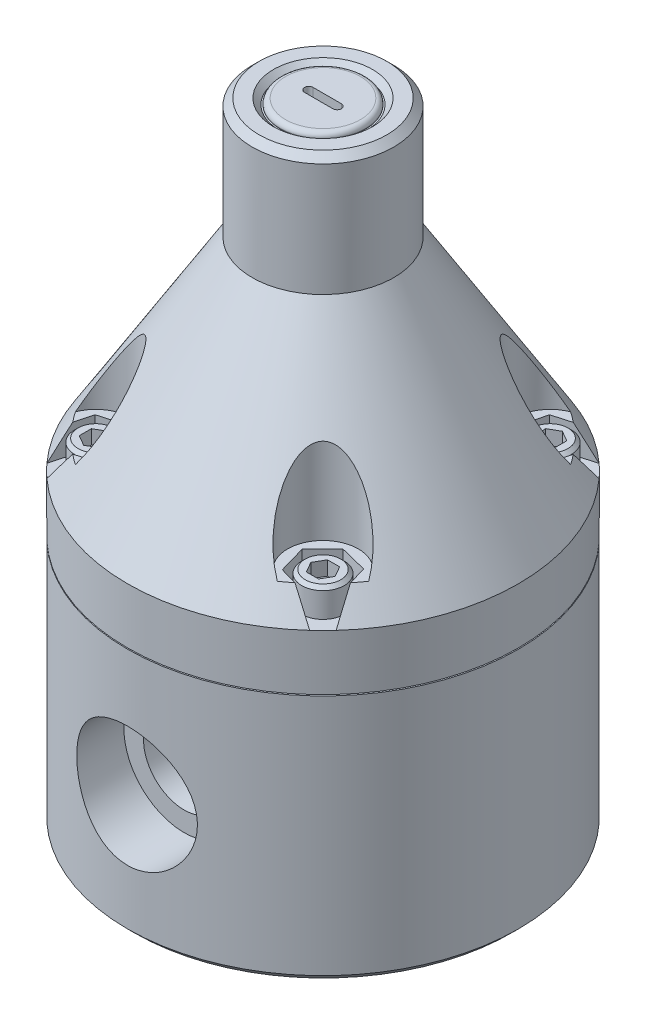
ISO-10303-21;
HEADER;
FILE_DESCRIPTION(('STEP AP214'),'2;1');
FILE_NAME('part.step','',(''),(''),'','','');
FILE_SCHEMA(('AUTOMOTIVE_DESIGN { 1 0 10303 214 1 1 1 1 }'));
ENDSEC;
DATA;
#1=APPLICATION_CONTEXT('core data for automotive mechanical design processes');
#2=APPLICATION_PROTOCOL_DEFINITION('international standard','automotive_design',2000,#1);
#3=PRODUCT_CONTEXT('',#1,'mechanical');
#4=PRODUCT('Part','Part','',(#3));
#5=PRODUCT_RELATED_PRODUCT_CATEGORY('part','',(#4));
#6=PRODUCT_DEFINITION_FORMATION('','',#4);
#7=PRODUCT_DEFINITION_CONTEXT('part definition',#1,'design');
#8=PRODUCT_DEFINITION('design','',#6,#7);
#9=PRODUCT_DEFINITION_SHAPE('','',#8);
#10=(LENGTH_UNIT() NAMED_UNIT(*) SI_UNIT(.MILLI.,.METRE.));
#11=(NAMED_UNIT(*) PLANE_ANGLE_UNIT() SI_UNIT($,.RADIAN.));
#12=(NAMED_UNIT(*) SI_UNIT($,.STERADIAN.) SOLID_ANGLE_UNIT());
#13=UNCERTAINTY_MEASURE_WITH_UNIT(LENGTH_MEASURE(1.E-05),#10,'distance_accuracy_value','');
#14=(GEOMETRIC_REPRESENTATION_CONTEXT(3) GLOBAL_UNCERTAINTY_ASSIGNED_CONTEXT((#13)) GLOBAL_UNIT_ASSIGNED_CONTEXT((#10,
#11,#12)) REPRESENTATION_CONTEXT('',''));
#15=CARTESIAN_POINT('',(0.,0.,0.));
#16=DIRECTION('',(0.,0.,1.));
#17=DIRECTION('',(1.,0.,0.));
#18=AXIS2_PLACEMENT_3D('',#15,#16,#17);
#19=CARTESIAN_POINT('',(0.,68.58,0.));
#20=DIRECTION('',(0.,-1.,0.));
#21=DIRECTION('',(0.,0.,-1.));
#22=AXIS2_PLACEMENT_3D('',#19,#20,#21);
#23=CONICAL_SURFACE('',#22,43.815,0.551031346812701);
#24=CARTESIAN_POINT('',(31.1854504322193,74.9302,-24.909570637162));
#25=CARTESIAN_POINT('',(31.2917993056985,74.4052604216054,-25.2932994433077));
#26=CARTESIAN_POINT('',(31.3977224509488,73.8791142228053,-25.6754921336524));
#27=CARTESIAN_POINT('',(31.6087824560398,72.8246364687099,-26.4370404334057));
#28=CARTESIAN_POINT('',(31.713919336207,72.2963049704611,-26.8163961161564));
#29=CARTESIAN_POINT('',(31.9234771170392,71.2376591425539,-27.5725240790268));
#30=CARTESIAN_POINT('',(32.0278980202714,70.7073448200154,-27.9492963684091));
#31=CARTESIAN_POINT('',(32.2360838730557,69.6448927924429,-28.7004741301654));
#32=CARTESIAN_POINT('',(32.3398488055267,69.1127550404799,-29.0748795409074));
#33=CARTESIAN_POINT('',(32.443312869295,68.5798,-29.4481993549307));
#34=B_SPLINE_CURVE_WITH_KNOTS('',3,(#24,#25,#26,#27,#28,#29,#30,#31,#32,#33),.UNSPECIFIED.,.F.,
.F.,(4,2,2,2,4),(0.,1.97662629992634,3.95320132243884,5.9297692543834,7.90638844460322),.UNSPECIFIED.);
#35=CARTESIAN_POINT('',(31.1854909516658,74.93,-24.9097168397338));
#36=VERTEX_POINT('',#35);
#37=CARTESIAN_POINT('',(32.4432740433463,68.58,-29.4480592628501));
#38=VERTEX_POINT('',#37);
#39=EDGE_CURVE('E746',#36,#38,#34,.T.);
#40=ORIENTED_EDGE('',*,*,#39,.F.);
#41=CARTESIAN_POINT('',(0.,74.93,0.));
#42=DIRECTION('',(0.,1.,0.));
#43=DIRECTION('',(0.,0.,1.));
#44=AXIS2_PLACEMENT_3D('',#41,#42,#43);
#45=CIRCLE('',#44,39.9127653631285);
#46=CARTESIAN_POINT('',(32.8759602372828,74.93,-22.6318376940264));
#47=VERTEX_POINT('',#46);
#48=EDGE_CURVE('E2477',#36,#47,#45,.F.);
#49=ORIENTED_EDGE('',*,*,#48,.T.);
#50=CARTESIAN_POINT('',(32.8760134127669,74.9298,-22.6319772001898));
#51=CARTESIAN_POINT('',(32.8078201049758,75.1861952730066,-22.4531520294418));
#52=CARTESIAN_POINT('',(32.7341907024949,75.4445704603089,-22.2793275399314));
#53=CARTESIAN_POINT('',(32.5770087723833,75.9645959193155,-21.9414911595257));
#54=CARTESIAN_POINT('',(32.4934589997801,76.2262452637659,-21.7774765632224));
#55=CARTESIAN_POINT('',(32.3174500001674,76.7519681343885,-21.4591594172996));
#56=CARTESIAN_POINT('',(32.2250013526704,77.0160384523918,-21.3048456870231));
#57=CARTESIAN_POINT('',(32.0318436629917,77.5464258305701,-21.0055220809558));
#58=CARTESIAN_POINT('',(31.9311339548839,77.8127430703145,-20.8605129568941));
#59=CARTESIAN_POINT('',(31.6173532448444,78.6150033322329,-20.4388792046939));
#60=CARTESIAN_POINT('',(31.3928032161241,79.1537454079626,-20.1759549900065));
#61=CARTESIAN_POINT('',(30.9170512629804,80.2357477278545,-19.6857657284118));
#62=CARTESIAN_POINT('',(30.6658395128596,80.7790095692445,-19.458513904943));
#63=CARTESIAN_POINT('',(30.118158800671,81.9115352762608,-19.022517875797));
#64=CARTESIAN_POINT('',(29.8196739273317,82.5009764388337,-18.8167433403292));
#65=CARTESIAN_POINT('',(29.3524342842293,83.3846139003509,-18.5396319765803));
#66=CARTESIAN_POINT('',(29.1934054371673,83.6791250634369,-18.452507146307));
#67=CARTESIAN_POINT('',(28.8689346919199,84.2675878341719,-18.2889878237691));
#68=CARTESIAN_POINT('',(28.7034932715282,84.5615394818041,-18.2125925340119));
#69=CARTESIAN_POINT('',(28.3660149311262,85.1488284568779,-18.0707333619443));
#70=CARTESIAN_POINT('',(28.1939696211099,85.442164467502,-18.0052839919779));
#71=CARTESIAN_POINT('',(27.8434345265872,86.0273145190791,-17.885863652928));
#72=CARTESIAN_POINT('',(27.6649449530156,86.3191286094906,-17.8318923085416));
#73=CARTESIAN_POINT('',(27.3014619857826,86.9004622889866,-17.7360312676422));
#74=CARTESIAN_POINT('',(27.1164723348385,87.1899830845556,-17.6941347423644));
#75=CARTESIAN_POINT('',(26.7396312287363,87.7661102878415,-17.6231649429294));
#76=CARTESIAN_POINT('',(26.5477800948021,88.0527168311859,-17.5940910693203));
#77=CARTESIAN_POINT('',(26.1388486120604,88.6481794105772,-17.5477736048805));
#78=CARTESIAN_POINT('',(25.9210687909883,88.9566632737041,-17.531860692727));
#79=CARTESIAN_POINT('',(25.4761618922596,89.5671217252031,-17.5184250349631));
#80=CARTESIAN_POINT('',(25.2490377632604,89.8690983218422,-17.5208965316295));
#81=CARTESIAN_POINT('',(24.7853264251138,90.462861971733,-17.546770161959));
#82=CARTESIAN_POINT('',(24.5487844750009,90.7546875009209,-17.5700815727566));
#83=CARTESIAN_POINT('',(24.1854004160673,91.182662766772,-17.6234209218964));
#84=CARTESIAN_POINT('',(24.0628808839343,91.3236542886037,-17.6442539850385));
#85=CARTESIAN_POINT('',(23.8147710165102,91.6017141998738,-17.6926688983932));
#86=CARTESIAN_POINT('',(23.6891808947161,91.7387828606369,-17.7202502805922));
#87=CARTESIAN_POINT('',(23.3476505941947,92.1003741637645,-17.8043004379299));
#88=CARTESIAN_POINT('',(23.1286985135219,92.320550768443,-17.8676208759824));
#89=CARTESIAN_POINT('',(22.6802930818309,92.7420139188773,-18.0200246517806));
#90=CARTESIAN_POINT('',(22.450819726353,92.9432620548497,-18.1091589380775));
#91=CARTESIAN_POINT('',(22.0978320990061,93.2244666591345,-18.2671443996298));
#92=CARTESIAN_POINT('',(21.9777912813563,93.315346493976,-18.3243659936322));
#93=CARTESIAN_POINT('',(21.7355133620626,93.4877899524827,-18.4477596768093));
#94=CARTESIAN_POINT('',(21.6132758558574,93.5693518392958,-18.5139334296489));
#95=CARTESIAN_POINT('',(21.3676920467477,93.7206957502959,-18.6557254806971));
#96=CARTESIAN_POINT('',(21.2443516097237,93.7905207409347,-18.7313074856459));
#97=CARTESIAN_POINT('',(20.997270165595,93.9162293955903,-18.8925662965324));
#98=CARTESIAN_POINT('',(20.8735295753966,93.9721245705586,-18.9782346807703));
#99=CARTESIAN_POINT('',(20.596353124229,94.0793061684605,-19.1825009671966));
#100=CARTESIAN_POINT('',(20.4431915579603,94.1259831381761,-19.303987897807));
#101=CARTESIAN_POINT('',(20.1429486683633,94.1891665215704,-19.561379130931));
#102=CARTESIAN_POINT('',(19.995862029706,94.2056998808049,-19.6972704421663));
#103=CARTESIAN_POINT('',(19.7121854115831,94.2068511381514,-19.9801670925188));
#104=CARTESIAN_POINT('',(19.5756118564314,94.1914201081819,-20.1271891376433));
#105=CARTESIAN_POINT('',(19.3168358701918,94.130256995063,-20.4274436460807));
#106=CARTESIAN_POINT('',(19.1946462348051,94.0844981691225,-20.5806814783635));
#107=CARTESIAN_POINT('',(18.9333227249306,93.9499537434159,-20.9335168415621));
#108=CARTESIAN_POINT('',(18.7994959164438,93.8525556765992,-21.1337148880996));
#109=CARTESIAN_POINT('',(18.5575341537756,93.6253225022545,-21.5311982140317));
#110=CARTESIAN_POINT('',(18.4494578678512,93.4954146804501,-21.7284758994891));
#111=CARTESIAN_POINT('',(18.2734255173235,93.2378861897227,-22.0822323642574));
#112=CARTESIAN_POINT('',(18.2017503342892,93.114033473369,-22.2396830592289));
#113=CARTESIAN_POINT('',(18.0717731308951,92.8543658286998,-22.5502860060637));
#114=CARTESIAN_POINT('',(18.0134803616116,92.7185427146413,-22.7034352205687));
#115=CARTESIAN_POINT('',(17.9085459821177,92.4375711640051,-23.0055063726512));
#116=CARTESIAN_POINT('',(17.8619238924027,92.2924076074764,-23.1544208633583));
#117=CARTESIAN_POINT('',(17.7789950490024,91.9949331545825,-23.4479825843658));
#118=CARTESIAN_POINT('',(17.7426923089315,91.842619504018,-23.5926281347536));
#119=CARTESIAN_POINT('',(17.6793668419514,91.5330276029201,-23.877261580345));
#120=CARTESIAN_POINT('',(17.6523073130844,91.3757718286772,-24.0172658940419));
#121=CARTESIAN_POINT('',(17.6063247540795,91.0568516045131,-24.2934532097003));
#122=CARTESIAN_POINT('',(17.5874006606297,90.8951877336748,-24.4296367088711));
#123=CARTESIAN_POINT('',(17.5416007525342,90.4045581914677,-24.8331155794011));
#124=CARTESIAN_POINT('',(17.5257415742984,90.0701857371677,-25.0951300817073));
#125=CARTESIAN_POINT('',(17.5187750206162,89.3910127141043,-25.6073018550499));
#126=CARTESIAN_POINT('',(17.5277362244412,89.0461858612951,-25.8574243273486));
#127=CARTESIAN_POINT('',(17.5674604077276,88.3499543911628,-26.346266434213));
#128=CARTESIAN_POINT('',(17.5982177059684,87.9985515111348,-26.5849890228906));
#129=CARTESIAN_POINT('',(17.6752315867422,87.3273950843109,-27.0279886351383));
#130=CARTESIAN_POINT('',(17.7195760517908,87.0080899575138,-27.2332880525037));
#131=CARTESIAN_POINT('',(17.8230232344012,86.366765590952,-27.6358491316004));
#132=CARTESIAN_POINT('',(17.8821279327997,86.0447459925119,-27.8331097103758));
#133=CARTESIAN_POINT('',(18.0143479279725,85.3986613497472,-28.2199078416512));
#134=CARTESIAN_POINT('',(18.0874725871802,85.0745950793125,-28.4094401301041));
#135=CARTESIAN_POINT('',(18.247146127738,84.4253288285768,-28.7807004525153));
#136=CARTESIAN_POINT('',(18.3336943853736,84.100128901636,-28.9624288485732));
#137=CARTESIAN_POINT('',(18.5196821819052,83.4497138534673,-29.3177238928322));
#138=CARTESIAN_POINT('',(18.6190998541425,83.1244996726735,-29.4913037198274));
#139=CARTESIAN_POINT('',(18.8307065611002,82.4740292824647,-29.830436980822));
#140=CARTESIAN_POINT('',(18.9428959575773,82.1487730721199,-29.9959901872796));
#141=CARTESIAN_POINT('',(19.1798765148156,81.4988617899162,-30.3186806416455));
#142=CARTESIAN_POINT('',(19.3046623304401,81.1742065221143,-30.4758214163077));
#143=CARTESIAN_POINT('',(19.566846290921,80.5258852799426,-30.7813029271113));
#144=CARTESIAN_POINT('',(19.7042435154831,80.2022192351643,-30.929644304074));
#145=CARTESIAN_POINT('',(20.0356080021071,79.4577845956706,-31.2608218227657));
#146=CARTESIAN_POINT('',(20.2340425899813,79.0375277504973,-31.4403688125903));
#147=CARTESIAN_POINT('',(20.6528330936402,78.2009180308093,-31.7817933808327));
#148=CARTESIAN_POINT('',(20.8731810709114,77.7845638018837,-31.943677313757));
#149=CARTESIAN_POINT('',(21.2204706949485,77.1642648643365,-32.1715277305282));
#150=CARTESIAN_POINT('',(21.3389735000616,76.9582923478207,-32.244953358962));
#151=CARTESIAN_POINT('',(21.5816967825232,76.5479021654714,-32.3865049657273));
#152=CARTESIAN_POINT('',(21.7059169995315,76.3434844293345,-32.454631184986));
#153=CARTESIAN_POINT('',(21.9602864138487,75.936277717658,-32.5852592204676));
#154=CARTESIAN_POINT('',(22.0904406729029,75.7334903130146,-32.647756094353));
#155=CARTESIAN_POINT('',(22.3567119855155,75.3299985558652,-32.7666088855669));
#156=CARTESIAN_POINT('',(22.4928299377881,75.1292945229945,-32.8229638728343));
#157=CARTESIAN_POINT('',(22.6319772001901,74.9298,-32.8760134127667));
#158=B_SPLINE_CURVE_WITH_KNOTS('',3,(#50,#51,#52,#53,#54,#55,#56,#57,#58,#59,#60,#61,#62,#63,
#64,#65,#66,#67,#68,#69,#70,#71,#72,#73,#74,#75,#76,#77,#78,#79,#80,#81,#82,#83,#84,#85,#86,#87,
#88,#89,#90,#91,#92,#93,#94,#95,#96,#97,#98,#99,#100,#101,#102,#103,#104,#105,#106,#107,#108,
#109,#110,#111,#112,#113,#114,#115,#116,#117,#118,#119,#120,#121,#122,#123,#124,#125,#126,#127,
#128,#129,#130,#131,#132,#133,#134,#135,#136,#137,#138,#139,#140,#141,#142,#143,#144,#145,#146,
#147,#148,#149,#150,#151,#152,#153,#154,#155,#156,#157),.UNSPECIFIED.,.F.,.F.,(4,2,2,2,2,2,2,2,
2,2,2,2,2,2,2,2,2,2,2,2,2,2,2,2,2,2,2,2,2,2,2,2,2,2,2,2,2,2,2,2,2,2,2,2,2,2,2,2,2,2,2,2,2,4),
(0.,0.959681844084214,1.9190977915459,2.87738689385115,3.83575332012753,5.75433905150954,
7.67363431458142,9.74768208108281,10.7850777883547,11.8223963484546,12.8610794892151,
13.8997286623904,14.9377892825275,15.9758013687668,17.1090815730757,18.2420068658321,
19.3700240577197,19.9337037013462,20.4973442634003,21.4467185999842,22.3979796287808,
22.8807596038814,23.363629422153,23.8446911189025,24.3253539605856,24.9256472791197,
25.5254037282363,26.1260789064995,26.7272844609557,27.5022221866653,28.2789089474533,
28.9163059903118,29.5541423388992,30.193038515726,30.8321828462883,31.4687519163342,
32.1052377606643,33.3791509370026,34.6565874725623,35.9336911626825,37.0798743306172,
38.2262114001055,39.3733166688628,40.520368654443,41.665496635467,42.8106570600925,
43.9553335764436,45.0999266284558,46.5938371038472,48.0872083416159,48.8332472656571,
49.5792522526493,50.325905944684,51.0726725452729),.UNSPECIFIED.);
#159=CARTESIAN_POINT('',(22.6318376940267,74.93,-32.8759602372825));
#160=VERTEX_POINT('',#159);
#161=EDGE_CURVE('E897',#47,#160,#158,.T.);
#162=ORIENTED_EDGE('',*,*,#161,.T.);
#163=CARTESIAN_POINT('',(24.9752922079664,74.93,-31.1329988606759));
#164=VERTEX_POINT('',#163);
#165=EDGE_CURVE('E906',#160,#164,#45,.F.);
#166=ORIENTED_EDGE('',*,*,#165,.T.);
#167=CARTESIAN_POINT('',(29.4766640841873,68.5798,-32.4174531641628));
#168=CARTESIAN_POINT('',(29.1062316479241,69.1125841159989,-32.3117512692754));
#169=CARTESIAN_POINT('',(28.7347583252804,69.6445870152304,-32.2057523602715));
#170=CARTESIAN_POINT('',(27.9895431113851,70.7068520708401,-31.9931072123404));
#171=CARTESIAN_POINT('',(27.6158012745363,71.2371142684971,-31.8864609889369));
#172=CARTESIAN_POINT('',(26.8658433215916,72.2957468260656,-31.6724625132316));
#173=CARTESIAN_POINT('',(26.4896271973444,72.8241171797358,-31.5651102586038));
#174=CARTESIAN_POINT('',(25.7344797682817,73.8787747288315,-31.3496309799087));
#175=CARTESIAN_POINT('',(25.3555483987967,74.4050618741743,-31.2415039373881));
#176=CARTESIAN_POINT('',(24.9751473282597,74.9302,-31.132957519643));
#177=B_SPLINE_CURVE_WITH_KNOTS('',3,(#167,#168,#169,#170,#171,#172,#173,#174,#175,#176),
.UNSPECIFIED.,.F.,.F.,(4,2,2,2,4),(0.,1.97237650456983,3.9447058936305,5.91704178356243,
7.88942480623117),.UNSPECIFIED.);
#178=CARTESIAN_POINT('',(29.4765250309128,68.58,-32.4174134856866));
#179=VERTEX_POINT('',#178);
#180=EDGE_CURVE('E729',#179,#164,#177,.T.);
#181=ORIENTED_EDGE('',*,*,#180,.F.);
#182=CARTESIAN_POINT('',(0.,68.58,0.));
#183=DIRECTION('',(0.,-1.,0.));
#184=DIRECTION('',(0.,0.,-1.));
#185=AXIS2_PLACEMENT_3D('',#182,#183,#184);
#186=CIRCLE('',#185,43.815);
#187=CARTESIAN_POINT('',(-29.4480592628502,68.58,-32.4432740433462));
#188=VERTEX_POINT('',#187);
#189=EDGE_CURVE('E1311',#188,#179,#186,.T.);
#190=ORIENTED_EDGE('',*,*,#189,.F.);
#191=CARTESIAN_POINT('',(-24.9095706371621,74.9302,-31.1854504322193));
#192=CARTESIAN_POINT('',(-25.2932994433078,74.4052604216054,-31.2917993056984));
#193=CARTESIAN_POINT('',(-25.6754921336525,73.8791142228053,-31.3977224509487));
#194=CARTESIAN_POINT('',(-26.4370404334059,72.8246364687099,-31.6087824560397));
#195=CARTESIAN_POINT('',(-26.8163961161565,72.2963049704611,-31.7139193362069));
#196=CARTESIAN_POINT('',(-27.5725240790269,71.2376591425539,-31.9234771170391));
#197=CARTESIAN_POINT('',(-27.9492963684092,70.7073448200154,-32.0278980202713));
#198=CARTESIAN_POINT('',(-28.7004741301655,69.6448927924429,-32.2360838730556));
#199=CARTESIAN_POINT('',(-29.0748795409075,69.1127550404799,-32.3398488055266));
#200=CARTESIAN_POINT('',(-29.4481993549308,68.5798,-32.4433128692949));
#201=B_SPLINE_CURVE_WITH_KNOTS('',3,(#191,#192,#193,#194,#195,#196,#197,#198,#199,#200),
.UNSPECIFIED.,.F.,.F.,(4,2,2,2,4),(0.,1.97662629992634,3.95320132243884,5.9297692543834,
7.90638844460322),.UNSPECIFIED.);
#202=CARTESIAN_POINT('',(-24.9097168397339,74.93,-31.1854909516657));
#203=VERTEX_POINT('',#202);
#204=EDGE_CURVE('E803',#203,#188,#201,.T.);
#205=ORIENTED_EDGE('',*,*,#204,.F.);
#206=CARTESIAN_POINT('',(0.,74.93,0.));
#207=DIRECTION('',(0.,1.,0.));
#208=DIRECTION('',(0.,0.,1.));
#209=AXIS2_PLACEMENT_3D('',#206,#207,#208);
#210=CIRCLE('',#209,39.9127653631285);
#211=CARTESIAN_POINT('',(-22.6318376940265,74.93,-32.8759602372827));
#212=VERTEX_POINT('',#211);
#213=EDGE_CURVE('E1607',#203,#212,#210,.F.);
#214=ORIENTED_EDGE('',*,*,#213,.T.);
#215=CARTESIAN_POINT('',(-22.6319772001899,74.9298,-32.8760134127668));
#216=CARTESIAN_POINT('',(-22.4531520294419,75.1861952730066,-32.8078201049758));
#217=CARTESIAN_POINT('',(-22.2793275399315,75.4445704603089,-32.7341907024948));
#218=CARTESIAN_POINT('',(-21.9414911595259,75.9645959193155,-32.5770087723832));
#219=CARTESIAN_POINT('',(-21.7774765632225,76.2262452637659,-32.49345899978));
#220=CARTESIAN_POINT('',(-21.4591594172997,76.7519681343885,-32.3174500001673));
#221=CARTESIAN_POINT('',(-21.3048456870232,77.0160384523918,-32.2250013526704));
#222=CARTESIAN_POINT('',(-21.0055220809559,77.5464258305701,-32.0318436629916));
#223=CARTESIAN_POINT('',(-20.8605129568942,77.8127430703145,-31.9311339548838));
#224=CARTESIAN_POINT('',(-20.438879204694,78.6150033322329,-31.6173532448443));
#225=CARTESIAN_POINT('',(-20.1759549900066,79.1537454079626,-31.392803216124));
#226=CARTESIAN_POINT('',(-19.6857657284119,80.2357477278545,-30.9170512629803));
#227=CARTESIAN_POINT('',(-19.4585139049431,80.7790095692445,-30.6658395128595));
#228=CARTESIAN_POINT('',(-19.0225178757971,81.9115352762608,-30.1181588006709));
#229=CARTESIAN_POINT('',(-18.8167433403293,82.5009764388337,-29.8196739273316));
#230=CARTESIAN_POINT('',(-18.5396319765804,83.3846139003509,-29.3524342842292));
#231=CARTESIAN_POINT('',(-18.4525071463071,83.6791250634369,-29.1934054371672));
#232=CARTESIAN_POINT('',(-18.2889878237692,84.2675878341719,-28.8689346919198));
#233=CARTESIAN_POINT('',(-18.212592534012,84.5615394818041,-28.7034932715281));
#234=CARTESIAN_POINT('',(-18.0707333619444,85.148828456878,-28.3660149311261));
#235=CARTESIAN_POINT('',(-18.005283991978,85.4421644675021,-28.1939696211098));
#236=CARTESIAN_POINT('',(-17.8858636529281,86.0273145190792,-27.8434345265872));
#237=CARTESIAN_POINT('',(-17.8318923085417,86.3191286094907,-27.6649449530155));
#238=CARTESIAN_POINT('',(-17.7360312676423,86.9004622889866,-27.3014619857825));
#239=CARTESIAN_POINT('',(-17.6941347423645,87.1899830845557,-27.1164723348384));
#240=CARTESIAN_POINT('',(-17.6231649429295,87.7661102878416,-26.7396312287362));
#241=CARTESIAN_POINT('',(-17.5940910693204,88.052716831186,-26.547780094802));
#242=CARTESIAN_POINT('',(-17.5477736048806,88.6481794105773,-26.1388486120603));
#243=CARTESIAN_POINT('',(-17.5318606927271,88.9566632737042,-25.9210687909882));
#244=CARTESIAN_POINT('',(-17.5184250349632,89.5671217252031,-25.4761618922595));
#245=CARTESIAN_POINT('',(-17.5208965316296,89.8690983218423,-25.2490377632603));
#246=CARTESIAN_POINT('',(-17.5467701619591,90.462861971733,-24.7853264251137));
#247=CARTESIAN_POINT('',(-17.5700815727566,90.754687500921,-24.5487844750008));
#248=CARTESIAN_POINT('',(-17.6234209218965,91.1826627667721,-24.1854004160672));
#249=CARTESIAN_POINT('',(-17.6442539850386,91.3236542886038,-24.0628808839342));
#250=CARTESIAN_POINT('',(-17.6926688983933,91.6017141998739,-23.8147710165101));
#251=CARTESIAN_POINT('',(-17.7202502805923,91.7387828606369,-23.6891808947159));
#252=CARTESIAN_POINT('',(-17.80430043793,92.1003741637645,-23.3476505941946));
#253=CARTESIAN_POINT('',(-17.8676208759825,92.320550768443,-23.1286985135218));
#254=CARTESIAN_POINT('',(-18.0200246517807,92.7420139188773,-22.6802930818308));
#255=CARTESIAN_POINT('',(-18.1091589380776,92.9432620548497,-22.4508197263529));
#256=CARTESIAN_POINT('',(-18.2671443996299,93.2244666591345,-22.097832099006));
#257=CARTESIAN_POINT('',(-18.3243659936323,93.3153464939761,-21.9777912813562));
#258=CARTESIAN_POINT('',(-18.4477596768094,93.4877899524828,-21.7355133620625));
#259=CARTESIAN_POINT('',(-18.513933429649,93.5693518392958,-21.6132758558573));
#260=CARTESIAN_POINT('',(-18.6557254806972,93.7206957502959,-21.3676920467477));
#261=CARTESIAN_POINT('',(-18.731307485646,93.7905207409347,-21.2443516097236));
#262=CARTESIAN_POINT('',(-18.8925662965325,93.9162293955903,-20.9972701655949));
#263=CARTESIAN_POINT('',(-18.9782346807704,93.9721245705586,-20.8735295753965));
#264=CARTESIAN_POINT('',(-19.1825009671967,94.0793061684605,-20.5963531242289));
#265=CARTESIAN_POINT('',(-19.3039878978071,94.1259831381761,-20.4431915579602));
#266=CARTESIAN_POINT('',(-19.5613791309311,94.1891665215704,-20.1429486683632));
#267=CARTESIAN_POINT('',(-19.6972704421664,94.2056998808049,-19.9958620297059));
#268=CARTESIAN_POINT('',(-19.9801670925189,94.2068511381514,-19.7121854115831));
#269=CARTESIAN_POINT('',(-20.1271891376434,94.1914201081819,-19.5756118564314));
#270=CARTESIAN_POINT('',(-20.4274436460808,94.130256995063,-19.3168358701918));
#271=CARTESIAN_POINT('',(-20.5806814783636,94.0844981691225,-19.194646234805));
#272=CARTESIAN_POINT('',(-20.9335168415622,93.9499537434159,-18.9333227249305));
#273=CARTESIAN_POINT('',(-21.1337148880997,93.8525556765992,-18.7994959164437));
#274=CARTESIAN_POINT('',(-21.5311982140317,93.6253225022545,-18.5575341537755));
#275=CARTESIAN_POINT('',(-21.7284758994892,93.4954146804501,-18.4494578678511));
#276=CARTESIAN_POINT('',(-22.0822323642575,93.2378861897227,-18.2734255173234));
#277=CARTESIAN_POINT('',(-22.239683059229,93.114033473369,-18.2017503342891));
#278=CARTESIAN_POINT('',(-22.5502860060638,92.8543658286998,-18.071773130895));
#279=CARTESIAN_POINT('',(-22.7034352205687,92.7185427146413,-18.0134803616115));
#280=CARTESIAN_POINT('',(-23.0055063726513,92.437571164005,-17.9085459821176));
#281=CARTESIAN_POINT('',(-23.1544208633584,92.2924076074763,-17.8619238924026));
#282=CARTESIAN_POINT('',(-23.4479825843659,91.9949331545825,-17.7789950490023));
#283=CARTESIAN_POINT('',(-23.5926281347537,91.842619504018,-17.7426923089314));
#284=CARTESIAN_POINT('',(-23.8772615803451,91.5330276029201,-17.6793668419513));
#285=CARTESIAN_POINT('',(-24.017265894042,91.3757718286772,-17.6523073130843));
#286=CARTESIAN_POINT('',(-24.2934532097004,91.0568516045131,-17.6063247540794));
#287=CARTESIAN_POINT('',(-24.4296367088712,90.8951877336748,-17.5874006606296));
#288=CARTESIAN_POINT('',(-24.8331155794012,90.4045581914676,-17.5416007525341));
#289=CARTESIAN_POINT('',(-25.0951300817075,90.0701857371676,-17.5257415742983));
#290=CARTESIAN_POINT('',(-25.60730185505,89.3910127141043,-17.5187750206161));
#291=CARTESIAN_POINT('',(-25.8574243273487,89.046185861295,-17.5277362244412));
#292=CARTESIAN_POINT('',(-26.3462664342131,88.3499543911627,-17.5674604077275));
#293=CARTESIAN_POINT('',(-26.5849890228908,87.9985515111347,-17.5982177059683));
#294=CARTESIAN_POINT('',(-27.0279886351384,87.3273950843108,-17.6752315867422));
#295=CARTESIAN_POINT('',(-27.2332880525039,87.0080899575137,-17.7195760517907));
#296=CARTESIAN_POINT('',(-27.6358491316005,86.366765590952,-17.8230232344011));
#297=CARTESIAN_POINT('',(-27.8331097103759,86.0447459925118,-17.8821279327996));
#298=CARTESIAN_POINT('',(-28.2199078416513,85.3986613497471,-18.0143479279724));
#299=CARTESIAN_POINT('',(-28.4094401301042,85.0745950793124,-18.0874725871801));
#300=CARTESIAN_POINT('',(-28.7807004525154,84.4253288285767,-18.2471461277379));
#301=CARTESIAN_POINT('',(-28.9624288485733,84.1001289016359,-18.3336943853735));
#302=CARTESIAN_POINT('',(-29.3177238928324,83.4497138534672,-18.5196821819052));
#303=CARTESIAN_POINT('',(-29.4913037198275,83.1244996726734,-18.6190998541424));
#304=CARTESIAN_POINT('',(-29.8304369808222,82.4740292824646,-18.8307065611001));
#305=CARTESIAN_POINT('',(-29.9959901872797,82.1487730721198,-18.9428959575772));
#306=CARTESIAN_POINT('',(-30.3186806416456,81.498861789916,-19.1798765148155));
#307=CARTESIAN_POINT('',(-30.4758214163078,81.1742065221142,-19.3046623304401));
#308=CARTESIAN_POINT('',(-30.7813029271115,80.5258852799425,-19.5668462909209));
#309=CARTESIAN_POINT('',(-30.9296443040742,80.2022192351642,-19.7042435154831));
#310=CARTESIAN_POINT('',(-31.2608218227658,79.4577845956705,-20.0356080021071));
#311=CARTESIAN_POINT('',(-31.4403688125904,79.0375277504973,-20.2340425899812));
#312=CARTESIAN_POINT('',(-31.7817933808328,78.2009180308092,-20.6528330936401));
#313=CARTESIAN_POINT('',(-31.9436773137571,77.7845638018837,-20.8731810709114));
#314=CARTESIAN_POINT('',(-32.1715277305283,77.1642648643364,-21.2204706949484));
#315=CARTESIAN_POINT('',(-32.2449533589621,76.9582923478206,-21.3389735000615));
#316=CARTESIAN_POINT('',(-32.3865049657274,76.5479021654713,-21.5816967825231));
#317=CARTESIAN_POINT('',(-32.4546311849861,76.3434844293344,-21.7059169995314));
#318=CARTESIAN_POINT('',(-32.5852592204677,75.9362777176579,-21.9602864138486));
#319=CARTESIAN_POINT('',(-32.6477560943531,75.7334903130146,-22.0904406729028));
#320=CARTESIAN_POINT('',(-32.766608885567,75.3299985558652,-22.3567119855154));
#321=CARTESIAN_POINT('',(-32.8229638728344,75.1292945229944,-22.492829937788));
#322=CARTESIAN_POINT('',(-32.8760134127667,74.9298,-22.63197720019));
#323=B_SPLINE_CURVE_WITH_KNOTS('',3,(#215,#216,#217,#218,#219,#220,#221,#222,#223,#224,#225,
#226,#227,#228,#229,#230,#231,#232,#233,#234,#235,#236,#237,#238,#239,#240,#241,#242,#243,#244,
#245,#246,#247,#248,#249,#250,#251,#252,#253,#254,#255,#256,#257,#258,#259,#260,#261,#262,#263,
#264,#265,#266,#267,#268,#269,#270,#271,#272,#273,#274,#275,#276,#277,#278,#279,#280,#281,#282,
#283,#284,#285,#286,#287,#288,#289,#290,#291,#292,#293,#294,#295,#296,#297,#298,#299,#300,#301,
#302,#303,#304,#305,#306,#307,#308,#309,#310,#311,#312,#313,#314,#315,#316,#317,#318,#319,#320,
#321,#322),.UNSPECIFIED.,.F.,.F.,(4,2,2,2,2,2,2,2,2,2,2,2,2,2,2,2,2,2,2,2,2,2,2,2,2,2,2,2,2,2,2,
2,2,2,2,2,2,2,2,2,2,2,2,2,2,2,2,2,2,2,2,2,2,4),(0.,0.959681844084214,1.9190977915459,
2.87738689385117,3.83575332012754,5.75433905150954,7.67363431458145,9.74768208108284,
10.7850777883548,11.8223963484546,12.8610794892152,13.8997286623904,14.9377892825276,
15.9758013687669,17.1090815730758,18.2420068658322,19.3700240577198,19.9337037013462,
20.4973442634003,21.4467185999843,22.3979796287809,22.8807596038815,23.3636294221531,
23.8446911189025,24.3253539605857,24.9256472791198,25.5254037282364,26.1260789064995,
26.7272844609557,27.5022221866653,28.2789089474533,28.9163059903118,29.5541423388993,
30.193038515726,30.8321828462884,31.4687519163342,32.1052377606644,33.3791509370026,
34.6565874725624,35.9336911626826,37.0798743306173,38.2262114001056,39.373316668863,
40.5203686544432,41.6654966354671,42.8106570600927,43.9553335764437,45.0999266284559,
46.5938371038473,48.0872083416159,48.8332472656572,49.5792522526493,50.3259059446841,
51.0726725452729),.UNSPECIFIED.);
#324=CARTESIAN_POINT('',(-32.8759602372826,74.93,-22.6318376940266));
#325=VERTEX_POINT('',#324);
#326=EDGE_CURVE('E2475',#212,#325,#323,.T.);
#327=ORIENTED_EDGE('',*,*,#326,.T.);
#328=CARTESIAN_POINT('',(-31.132998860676,74.93,-24.9752922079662));
#329=VERTEX_POINT('',#328);
#330=EDGE_CURVE('E1364',#325,#329,#210,.F.);
#331=ORIENTED_EDGE('',*,*,#330,.T.);
#332=CARTESIAN_POINT('',(-32.4174531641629,68.5798,-29.4766640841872));
#333=CARTESIAN_POINT('',(-32.3117512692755,69.1125841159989,-29.106231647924));
#334=CARTESIAN_POINT('',(-32.2057523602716,69.6445870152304,-28.7347583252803));
#335=CARTESIAN_POINT('',(-31.9931072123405,70.7068520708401,-27.989543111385));
#336=CARTESIAN_POINT('',(-31.886460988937,71.2371142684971,-27.6158012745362));
#337=CARTESIAN_POINT('',(-31.6724625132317,72.2957468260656,-26.8658433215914));
#338=CARTESIAN_POINT('',(-31.5651102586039,72.8241171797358,-26.4896271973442));
#339=CARTESIAN_POINT('',(-31.3496309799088,73.8787747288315,-25.7344797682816));
#340=CARTESIAN_POINT('',(-31.2415039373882,74.4050618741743,-25.3555483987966));
#341=CARTESIAN_POINT('',(-31.1329575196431,74.9302,-24.9751473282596));
#342=B_SPLINE_CURVE_WITH_KNOTS('',3,(#332,#333,#334,#335,#336,#337,#338,#339,#340,#341),
.UNSPECIFIED.,.F.,.F.,(4,2,2,2,4),(0.,1.9723765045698,3.94470589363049,5.91704178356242,
7.88942480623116),.UNSPECIFIED.);
#343=CARTESIAN_POINT('',(-32.4174134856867,68.58,-29.4765250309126));
#344=VERTEX_POINT('',#343);
#345=EDGE_CURVE('E796',#344,#329,#342,.T.);
#346=ORIENTED_EDGE('',*,*,#345,.F.);
#347=CARTESIAN_POINT('',(-32.4432740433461,68.58,29.4480592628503));
#348=VERTEX_POINT('',#347);
#349=EDGE_CURVE('E1319',#348,#344,#186,.T.);
#350=ORIENTED_EDGE('',*,*,#349,.F.);
#351=CARTESIAN_POINT('',(-31.1854504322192,74.9302,24.9095706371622));
#352=CARTESIAN_POINT('',(-31.2917993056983,74.4052604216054,25.2932994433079));
#353=CARTESIAN_POINT('',(-31.3977224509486,73.8791142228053,25.6754921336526));
#354=CARTESIAN_POINT('',(-31.6087824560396,72.8246364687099,26.437040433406));
#355=CARTESIAN_POINT('',(-31.7139193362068,72.2963049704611,26.8163961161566));
#356=CARTESIAN_POINT('',(-31.9234771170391,71.2376591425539,27.572524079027));
#357=CARTESIAN_POINT('',(-32.0278980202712,70.7073448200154,27.9492963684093));
#358=CARTESIAN_POINT('',(-32.2360838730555,69.6448927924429,28.7004741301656));
#359=CARTESIAN_POINT('',(-32.3398488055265,69.1127550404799,29.0748795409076));
#360=CARTESIAN_POINT('',(-32.4433128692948,68.5798,29.4481993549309));
#361=B_SPLINE_CURVE_WITH_KNOTS('',3,(#351,#352,#353,#354,#355,#356,#357,#358,#359,#360),
.UNSPECIFIED.,.F.,.F.,(4,2,2,2,4),(0.,1.97662629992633,3.95320132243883,5.9297692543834,
7.90638844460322),.UNSPECIFIED.);
#362=CARTESIAN_POINT('',(-31.1854909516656,74.93,24.9097168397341));
#363=VERTEX_POINT('',#362);
#364=EDGE_CURVE('E866',#363,#348,#361,.T.);
#365=ORIENTED_EDGE('',*,*,#364,.F.);
#366=CARTESIAN_POINT('',(0.,74.93,0.));
#367=DIRECTION('',(0.,1.,0.));
#368=DIRECTION('',(0.,0.,1.));
#369=AXIS2_PLACEMENT_3D('',#366,#367,#368);
#370=CIRCLE('',#369,39.9127653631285);
#371=CARTESIAN_POINT('',(-32.8759602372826,74.93,22.6318376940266));
#372=VERTEX_POINT('',#371);
#373=EDGE_CURVE('E1550',#363,#372,#370,.F.);
#374=ORIENTED_EDGE('',*,*,#373,.T.);
#375=CARTESIAN_POINT('',(-32.8760134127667,74.9298,22.63197720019));
#376=CARTESIAN_POINT('',(-32.8078201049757,75.1861952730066,22.453152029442));
#377=CARTESIAN_POINT('',(-32.7341907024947,75.4445704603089,22.2793275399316));
#378=CARTESIAN_POINT('',(-32.5770087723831,75.9645959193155,21.941491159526));
#379=CARTESIAN_POINT('',(-32.4934589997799,76.2262452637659,21.7774765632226));
#380=CARTESIAN_POINT('',(-32.3174500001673,76.7519681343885,21.4591594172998));
#381=CARTESIAN_POINT('',(-32.2250013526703,77.0160384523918,21.3048456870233));
#382=CARTESIAN_POINT('',(-32.0318436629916,77.5464258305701,21.005522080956));
#383=CARTESIAN_POINT('',(-31.9311339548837,77.8127430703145,20.8605129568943));
#384=CARTESIAN_POINT('',(-31.6173532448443,78.6150033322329,20.4388792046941));
#385=CARTESIAN_POINT('',(-31.3928032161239,79.1537454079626,20.1759549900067));
#386=CARTESIAN_POINT('',(-30.9170512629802,80.2357477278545,19.685765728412));
#387=CARTESIAN_POINT('',(-30.6658395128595,80.7790095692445,19.4585139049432));
#388=CARTESIAN_POINT('',(-30.1181588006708,81.9115352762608,19.0225178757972));
#389=CARTESIAN_POINT('',(-29.8196739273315,82.5009764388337,18.8167433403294));
#390=CARTESIAN_POINT('',(-29.3524342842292,83.3846139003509,18.5396319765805));
#391=CARTESIAN_POINT('',(-29.1934054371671,83.6791250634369,18.4525071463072));
#392=CARTESIAN_POINT('',(-28.8689346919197,84.2675878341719,18.2889878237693));
#393=CARTESIAN_POINT('',(-28.703493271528,84.5615394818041,18.2125925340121));
#394=CARTESIAN_POINT('',(-28.3660149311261,85.1488284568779,18.0707333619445));
#395=CARTESIAN_POINT('',(-28.1939696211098,85.442164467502,18.0052839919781));
#396=CARTESIAN_POINT('',(-27.8434345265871,86.0273145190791,17.8858636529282));
#397=CARTESIAN_POINT('',(-27.6649449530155,86.3191286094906,17.8318923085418));
#398=CARTESIAN_POINT('',(-27.3014619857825,86.9004622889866,17.7360312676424));
#399=CARTESIAN_POINT('',(-27.1164723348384,87.1899830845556,17.6941347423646));
#400=CARTESIAN_POINT('',(-26.7396312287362,87.7661102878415,17.6231649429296));
#401=CARTESIAN_POINT('',(-26.5477800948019,88.0527168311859,17.5940910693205));
#402=CARTESIAN_POINT('',(-26.1388486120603,88.6481794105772,17.5477736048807));
#403=CARTESIAN_POINT('',(-25.9210687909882,88.9566632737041,17.5318606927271));
#404=CARTESIAN_POINT('',(-25.4761618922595,89.5671217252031,17.5184250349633));
#405=CARTESIAN_POINT('',(-25.2490377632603,89.8690983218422,17.5208965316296));
#406=CARTESIAN_POINT('',(-24.7853264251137,90.462861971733,17.5467701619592));
#407=CARTESIAN_POINT('',(-24.5487844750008,90.7546875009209,17.5700815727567));
#408=CARTESIAN_POINT('',(-24.1854004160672,91.1826627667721,17.6234209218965));
#409=CARTESIAN_POINT('',(-24.0628808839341,91.3236542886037,17.6442539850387));
#410=CARTESIAN_POINT('',(-23.8147710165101,91.6017141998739,17.6926688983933));
#411=CARTESIAN_POINT('',(-23.6891808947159,91.7387828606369,17.7202502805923));
#412=CARTESIAN_POINT('',(-23.3476505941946,92.1003741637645,17.80430043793));
#413=CARTESIAN_POINT('',(-23.1286985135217,92.320550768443,17.8676208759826));
#414=CARTESIAN_POINT('',(-22.6802930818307,92.7420139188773,18.0200246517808));
#415=CARTESIAN_POINT('',(-22.4508197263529,92.9432620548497,18.1091589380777));
#416=CARTESIAN_POINT('',(-22.0978320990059,93.2244666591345,18.2671443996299));
#417=CARTESIAN_POINT('',(-21.9777912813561,93.315346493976,18.3243659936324));
#418=CARTESIAN_POINT('',(-21.7355133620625,93.4877899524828,18.4477596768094));
#419=CARTESIAN_POINT('',(-21.6132758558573,93.5693518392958,18.5139334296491));
#420=CARTESIAN_POINT('',(-21.3676920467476,93.7206957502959,18.6557254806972));
#421=CARTESIAN_POINT('',(-21.2443516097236,93.7905207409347,18.7313074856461));
#422=CARTESIAN_POINT('',(-20.9972701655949,93.9162293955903,18.8925662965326));
#423=CARTESIAN_POINT('',(-20.8735295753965,93.9721245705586,18.9782346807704));
#424=CARTESIAN_POINT('',(-20.5963531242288,94.0793061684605,19.1825009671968));
#425=CARTESIAN_POINT('',(-20.4431915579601,94.1259831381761,19.3039878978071));
#426=CARTESIAN_POINT('',(-20.1429486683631,94.1891665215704,19.5613791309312));
#427=CARTESIAN_POINT('',(-19.9958620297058,94.2056998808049,19.6972704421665));
#428=CARTESIAN_POINT('',(-19.712185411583,94.2068511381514,19.980167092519));
#429=CARTESIAN_POINT('',(-19.5756118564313,94.1914201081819,20.1271891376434));
#430=CARTESIAN_POINT('',(-19.3168358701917,94.130256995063,20.4274436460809));
#431=CARTESIAN_POINT('',(-19.194646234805,94.0844981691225,20.5806814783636));
#432=CARTESIAN_POINT('',(-18.9333227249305,93.9499537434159,20.9335168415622));
#433=CARTESIAN_POINT('',(-18.7994959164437,93.8525556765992,21.1337148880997));
#434=CARTESIAN_POINT('',(-18.5575341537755,93.6253225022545,21.5311982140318));
#435=CARTESIAN_POINT('',(-18.449457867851,93.4954146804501,21.7284758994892));
#436=CARTESIAN_POINT('',(-18.2734255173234,93.2378861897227,22.0822323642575));
#437=CARTESIAN_POINT('',(-18.201750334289,93.114033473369,22.239683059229));
#438=CARTESIAN_POINT('',(-18.0717731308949,92.8543658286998,22.5502860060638));
#439=CARTESIAN_POINT('',(-18.0134803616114,92.7185427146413,22.7034352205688));
#440=CARTESIAN_POINT('',(-17.9085459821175,92.4375711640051,23.0055063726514));
#441=CARTESIAN_POINT('',(-17.8619238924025,92.2924076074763,23.1544208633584));
#442=CARTESIAN_POINT('',(-17.7789950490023,91.9949331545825,23.447982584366));
#443=CARTESIAN_POINT('',(-17.7426923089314,91.842619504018,23.5926281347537));
#444=CARTESIAN_POINT('',(-17.6793668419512,91.5330276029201,23.8772615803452));
#445=CARTESIAN_POINT('',(-17.6523073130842,91.3757718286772,24.017265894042));
#446=CARTESIAN_POINT('',(-17.6063247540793,91.0568516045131,24.2934532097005));
#447=CARTESIAN_POINT('',(-17.5874006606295,90.8951877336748,24.4296367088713));
#448=CARTESIAN_POINT('',(-17.541600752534,90.4045581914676,24.8331155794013));
#449=CARTESIAN_POINT('',(-17.5257415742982,90.0701857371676,25.0951300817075));
#450=CARTESIAN_POINT('',(-17.518775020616,89.3910127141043,25.6073018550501));
#451=CARTESIAN_POINT('',(-17.5277362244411,89.046185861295,25.8574243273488));
#452=CARTESIAN_POINT('',(-17.5674604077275,88.3499543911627,26.3462664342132));
#453=CARTESIAN_POINT('',(-17.5982177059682,87.9985515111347,26.5849890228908));
#454=CARTESIAN_POINT('',(-17.6752315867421,87.3273950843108,27.0279886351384));
#455=CARTESIAN_POINT('',(-17.7195760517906,87.0080899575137,27.2332880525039));
#456=CARTESIAN_POINT('',(-17.823023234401,86.366765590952,27.6358491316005));
#457=CARTESIAN_POINT('',(-17.8821279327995,86.0447459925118,27.833109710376));
#458=CARTESIAN_POINT('',(-18.0143479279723,85.3986613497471,28.2199078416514));
#459=CARTESIAN_POINT('',(-18.08747258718,85.0745950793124,28.4094401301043));
#460=CARTESIAN_POINT('',(-18.2471461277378,84.4253288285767,28.7807004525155));
#461=CARTESIAN_POINT('',(-18.3336943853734,84.1001289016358,28.9624288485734));
#462=CARTESIAN_POINT('',(-18.5196821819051,83.4497138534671,29.3177238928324));
#463=CARTESIAN_POINT('',(-18.6190998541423,83.1244996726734,29.4913037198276));
#464=CARTESIAN_POINT('',(-18.8307065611,82.4740292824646,29.8304369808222));
#465=CARTESIAN_POINT('',(-18.9428959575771,82.1487730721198,29.9959901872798));
#466=CARTESIAN_POINT('',(-19.1798765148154,81.498861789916,30.3186806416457));
#467=CARTESIAN_POINT('',(-19.30466233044,81.1742065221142,30.4758214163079));
#468=CARTESIAN_POINT('',(-19.5668462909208,80.5258852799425,30.7813029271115));
#469=CARTESIAN_POINT('',(-19.704243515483,80.2022192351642,30.9296443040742));
#470=CARTESIAN_POINT('',(-20.035608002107,79.4577845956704,31.2608218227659));
#471=CARTESIAN_POINT('',(-20.2340425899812,79.0375277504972,31.4403688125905));
#472=CARTESIAN_POINT('',(-20.65283309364,78.2009180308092,31.7817933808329));
#473=CARTESIAN_POINT('',(-20.8731810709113,77.7845638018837,31.9436773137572));
#474=CARTESIAN_POINT('',(-21.2204706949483,77.1642648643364,32.1715277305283));
#475=CARTESIAN_POINT('',(-21.3389735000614,76.9582923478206,32.2449533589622));
#476=CARTESIAN_POINT('',(-21.581696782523,76.5479021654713,32.3865049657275));
#477=CARTESIAN_POINT('',(-21.7059169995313,76.3434844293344,32.4546311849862));
#478=CARTESIAN_POINT('',(-21.9602864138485,75.9362777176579,32.5852592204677));
#479=CARTESIAN_POINT('',(-22.0904406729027,75.7334903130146,32.6477560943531));
#480=CARTESIAN_POINT('',(-22.3567119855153,75.3299985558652,32.7666088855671));
#481=CARTESIAN_POINT('',(-22.4928299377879,75.1292945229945,32.8229638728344));
#482=CARTESIAN_POINT('',(-22.6319772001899,74.9298,32.8760134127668));
#483=B_SPLINE_CURVE_WITH_KNOTS('',3,(#375,#376,#377,#378,#379,#380,#381,#382,#383,#384,#385,
#386,#387,#388,#389,#390,#391,#392,#393,#394,#395,#396,#397,#398,#399,#400,#401,#402,#403,#404,
#405,#406,#407,#408,#409,#410,#411,#412,#413,#414,#415,#416,#417,#418,#419,#420,#421,#422,#423,
#424,#425,#426,#427,#428,#429,#430,#431,#432,#433,#434,#435,#436,#437,#438,#439,#440,#441,#442,
#443,#444,#445,#446,#447,#448,#449,#450,#451,#452,#453,#454,#455,#456,#457,#458,#459,#460,#461,
#462,#463,#464,#465,#466,#467,#468,#469,#470,#471,#472,#473,#474,#475,#476,#477,#478,#479,#480,
#481,#482),.UNSPECIFIED.,.F.,.F.,(4,2,2,2,2,2,2,2,2,2,2,2,2,2,2,2,2,2,2,2,2,2,2,2,2,2,2,2,2,2,2,
2,2,2,2,2,2,2,2,2,2,2,2,2,2,2,2,2,2,2,2,2,2,4),(0.,0.959681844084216,1.9190977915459,
2.87738689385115,3.83575332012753,5.75433905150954,7.67363431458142,9.74768208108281,
10.7850777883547,11.8223963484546,12.8610794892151,13.8997286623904,14.9377892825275,
15.9758013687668,17.1090815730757,18.2420068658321,19.3700240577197,19.9337037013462,
20.4973442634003,21.4467185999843,22.3979796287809,22.8807596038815,23.3636294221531,
23.8446911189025,24.3253539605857,24.9256472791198,25.5254037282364,26.1260789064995,
26.7272844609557,27.5022221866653,28.2789089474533,28.9163059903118,29.5541423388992,
30.193038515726,30.8321828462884,31.4687519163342,32.1052377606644,33.3791509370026,
34.6565874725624,35.9336911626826,37.0798743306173,38.2262114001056,39.373316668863,
40.5203686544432,41.6654966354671,42.8106570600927,43.9553335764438,45.099926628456,
46.5938371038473,48.087208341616,48.8332472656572,49.5792522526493,50.325905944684,
51.0726725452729),.UNSPECIFIED.);
#484=CARTESIAN_POINT('',(-22.6318376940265,74.93,32.8759602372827));
#485=VERTEX_POINT('',#484);
#486=EDGE_CURVE('E1599',#372,#485,#483,.T.);
#487=ORIENTED_EDGE('',*,*,#486,.T.);
#488=CARTESIAN_POINT('',(-24.9752922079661,74.93,31.132998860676));
#489=VERTEX_POINT('',#488);
#490=EDGE_CURVE('E1341',#485,#489,#370,.F.);
#491=ORIENTED_EDGE('',*,*,#490,.T.);
#492=CARTESIAN_POINT('',(-29.476664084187,68.5798,32.417453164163));
#493=CARTESIAN_POINT('',(-29.1062316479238,69.1125841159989,32.3117512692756));
#494=CARTESIAN_POINT('',(-28.7347583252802,69.6445870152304,32.2057523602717));
#495=CARTESIAN_POINT('',(-27.9895431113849,70.7068520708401,31.9931072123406));
#496=CARTESIAN_POINT('',(-27.6158012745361,71.2371142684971,31.8864609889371));
#497=CARTESIAN_POINT('',(-26.8658433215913,72.2957468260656,31.6724625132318));
#498=CARTESIAN_POINT('',(-26.4896271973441,72.8241171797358,31.565110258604));
#499=CARTESIAN_POINT('',(-25.7344797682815,73.8787747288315,31.3496309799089));
#500=CARTESIAN_POINT('',(-25.3555483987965,74.4050618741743,31.2415039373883));
#501=CARTESIAN_POINT('',(-24.9751473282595,74.9302,31.1329575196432));
#502=B_SPLINE_CURVE_WITH_KNOTS('',3,(#492,#493,#494,#495,#496,#497,#498,#499,#500,#501),
.UNSPECIFIED.,.F.,.F.,(4,2,2,2,4),(0.,1.97237650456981,3.9447058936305,5.91704178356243,
7.88942480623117),.UNSPECIFIED.);
#503=CARTESIAN_POINT('',(-29.4765250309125,68.58,32.4174134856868));
#504=VERTEX_POINT('',#503);
#505=EDGE_CURVE('E850',#504,#489,#502,.T.);
#506=ORIENTED_EDGE('',*,*,#505,.F.);
#507=CARTESIAN_POINT('',(29.4480592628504,68.58,32.443274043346));
#508=VERTEX_POINT('',#507);
#509=EDGE_CURVE('E1171',#508,#504,#186,.T.);
#510=ORIENTED_EDGE('',*,*,#509,.F.);
#511=CARTESIAN_POINT('',(24.9095706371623,74.9302,31.1854504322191));
#512=CARTESIAN_POINT('',(25.2932994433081,74.4052604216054,31.2917993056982));
#513=CARTESIAN_POINT('',(25.6754921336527,73.8791142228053,31.3977224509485));
#514=CARTESIAN_POINT('',(26.4370404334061,72.8246364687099,31.6087824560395));
#515=CARTESIAN_POINT('',(26.8163961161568,72.2963049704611,31.7139193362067));
#516=CARTESIAN_POINT('',(27.5725240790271,71.2376591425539,31.923477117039));
#517=CARTESIAN_POINT('',(27.9492963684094,70.7073448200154,32.0278980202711));
#518=CARTESIAN_POINT('',(28.7004741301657,69.6448927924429,32.2360838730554));
#519=CARTESIAN_POINT('',(29.0748795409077,69.1127550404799,32.3398488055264));
#520=CARTESIAN_POINT('',(29.448199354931,68.5798,32.4433128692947));
#521=B_SPLINE_CURVE_WITH_KNOTS('',3,(#511,#512,#513,#514,#515,#516,#517,#518,#519,#520),
.UNSPECIFIED.,.F.,.F.,(4,2,2,2,4),(0.,1.97662629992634,3.95320132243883,5.9297692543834,
7.90638844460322),.UNSPECIFIED.);
#522=CARTESIAN_POINT('',(24.9097168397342,74.93,31.1854909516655));
#523=VERTEX_POINT('',#522);
#524=EDGE_CURVE('E1337',#523,#508,#521,.T.);
#525=ORIENTED_EDGE('',*,*,#524,.F.);
#526=CARTESIAN_POINT('',(0.,74.93,0.));
#527=DIRECTION('',(0.,1.,0.));
#528=DIRECTION('',(0.,0.,1.));
#529=AXIS2_PLACEMENT_3D('',#526,#527,#528);
#530=CIRCLE('',#529,39.9127653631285);
#531=CARTESIAN_POINT('',(22.6318376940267,74.93,32.8759602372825));
#532=VERTEX_POINT('',#531);
#533=EDGE_CURVE('E1210',#523,#532,#530,.F.);
#534=ORIENTED_EDGE('',*,*,#533,.T.);
#535=CARTESIAN_POINT('',(22.6319772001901,74.9298,32.8760134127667));
#536=CARTESIAN_POINT('',(22.4531520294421,75.1861952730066,32.8078201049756));
#537=CARTESIAN_POINT('',(22.2793275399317,75.4445704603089,32.7341907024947));
#538=CARTESIAN_POINT('',(21.9414911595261,75.9645959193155,32.5770087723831));
#539=CARTESIAN_POINT('',(21.7774765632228,76.2262452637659,32.4934589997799));
#540=CARTESIAN_POINT('',(21.4591594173,76.7519681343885,32.3174500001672));
#541=CARTESIAN_POINT('',(21.3048456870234,77.0160384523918,32.2250013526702));
#542=CARTESIAN_POINT('',(21.0055220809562,77.5464258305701,32.0318436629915));
#543=CARTESIAN_POINT('',(20.8605129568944,77.8127430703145,31.9311339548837));
#544=CARTESIAN_POINT('',(20.4388792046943,78.6150033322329,31.6173532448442));
#545=CARTESIAN_POINT('',(20.1759549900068,79.1537454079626,31.3928032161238));
#546=CARTESIAN_POINT('',(19.6857657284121,80.2357477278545,30.9170512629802));
#547=CARTESIAN_POINT('',(19.4585139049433,80.7790095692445,30.6658395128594));
#548=CARTESIAN_POINT('',(19.0225178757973,81.9115352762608,30.1181588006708));
#549=CARTESIAN_POINT('',(18.8167433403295,82.5009764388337,29.8196739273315));
#550=CARTESIAN_POINT('',(18.5396319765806,83.3846139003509,29.3524342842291));
#551=CARTESIAN_POINT('',(18.4525071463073,83.6791250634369,29.1934054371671));
#552=CARTESIAN_POINT('',(18.2889878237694,84.2675878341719,28.8689346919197));
#553=CARTESIAN_POINT('',(18.2125925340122,84.5615394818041,28.703493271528));
#554=CARTESIAN_POINT('',(18.0707333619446,85.1488284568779,28.366014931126));
#555=CARTESIAN_POINT('',(18.0052839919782,85.442164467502,28.1939696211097));
#556=CARTESIAN_POINT('',(17.8858636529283,86.0273145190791,27.8434345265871));
#557=CARTESIAN_POINT('',(17.8318923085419,86.3191286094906,27.6649449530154));
#558=CARTESIAN_POINT('',(17.7360312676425,86.9004622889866,27.3014619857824));
#559=CARTESIAN_POINT('',(17.6941347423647,87.1899830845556,27.1164723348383));
#560=CARTESIAN_POINT('',(17.6231649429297,87.7661102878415,26.7396312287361));
#561=CARTESIAN_POINT('',(17.5940910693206,88.0527168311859,26.5477800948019));
#562=CARTESIAN_POINT('',(17.5477736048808,88.6481794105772,26.1388486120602));
#563=CARTESIAN_POINT('',(17.5318606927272,88.9566632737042,25.9210687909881));
#564=CARTESIAN_POINT('',(17.5184250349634,89.5671217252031,25.4761618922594));
#565=CARTESIAN_POINT('',(17.5208965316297,89.8690983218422,25.2490377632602));
#566=CARTESIAN_POINT('',(17.5467701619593,90.462861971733,24.7853264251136));
#567=CARTESIAN_POINT('',(17.5700815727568,90.7546875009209,24.5487844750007));
#568=CARTESIAN_POINT('',(17.6234209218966,91.182662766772,24.1854004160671));
#569=CARTESIAN_POINT('',(17.6442539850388,91.3236542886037,24.0628808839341));
#570=CARTESIAN_POINT('',(17.6926688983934,91.6017141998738,23.81477101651));
#571=CARTESIAN_POINT('',(17.7202502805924,91.7387828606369,23.6891808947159));
#572=CARTESIAN_POINT('',(17.8043004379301,92.1003741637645,23.3476505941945));
#573=CARTESIAN_POINT('',(17.8676208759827,92.320550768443,23.1286985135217));
#574=CARTESIAN_POINT('',(18.0200246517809,92.7420139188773,22.6802930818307));
#575=CARTESIAN_POINT('',(18.1091589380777,92.9432620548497,22.4508197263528));
#576=CARTESIAN_POINT('',(18.26714439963,93.2244666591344,22.0978320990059));
#577=CARTESIAN_POINT('',(18.3243659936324,93.315346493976,21.9777912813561));
#578=CARTESIAN_POINT('',(18.4477596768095,93.4877899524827,21.7355133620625));
#579=CARTESIAN_POINT('',(18.5139334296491,93.5693518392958,21.6132758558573));
#580=CARTESIAN_POINT('',(18.6557254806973,93.7206957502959,21.3676920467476));
#581=CARTESIAN_POINT('',(18.7313074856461,93.7905207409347,21.2443516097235));
#582=CARTESIAN_POINT('',(18.8925662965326,93.9162293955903,20.9972701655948));
#583=CARTESIAN_POINT('',(18.9782346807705,93.9721245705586,20.8735295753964));
#584=CARTESIAN_POINT('',(19.1825009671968,94.0793061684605,20.5963531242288));
#585=CARTESIAN_POINT('',(19.3039878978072,94.1259831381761,20.4431915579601));
#586=CARTESIAN_POINT('',(19.5613791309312,94.1891665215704,20.1429486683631));
#587=CARTESIAN_POINT('',(19.6972704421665,94.2056998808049,19.9958620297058));
#588=CARTESIAN_POINT('',(19.980167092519,94.2068511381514,19.712185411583));
#589=CARTESIAN_POINT('',(20.1271891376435,94.1914201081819,19.5756118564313));
#590=CARTESIAN_POINT('',(20.4274436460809,94.130256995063,19.3168358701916));
#591=CARTESIAN_POINT('',(20.5806814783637,94.0844981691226,19.1946462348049));
#592=CARTESIAN_POINT('',(20.9335168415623,93.9499537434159,18.9333227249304));
#593=CARTESIAN_POINT('',(21.1337148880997,93.8525556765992,18.7994959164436));
#594=CARTESIAN_POINT('',(21.5311982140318,93.6253225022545,18.5575341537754));
#595=CARTESIAN_POINT('',(21.7284758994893,93.4954146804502,18.4494578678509));
#596=CARTESIAN_POINT('',(22.0822323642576,93.2378861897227,18.2734255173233));
#597=CARTESIAN_POINT('',(22.2396830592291,93.114033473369,18.2017503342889));
#598=CARTESIAN_POINT('',(22.5502860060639,92.8543658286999,18.0717731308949));
#599=CARTESIAN_POINT('',(22.7034352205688,92.7185427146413,18.0134803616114));
#600=CARTESIAN_POINT('',(23.0055063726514,92.4375711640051,17.9085459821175));
#601=CARTESIAN_POINT('',(23.1544208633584,92.2924076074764,17.8619238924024));
#602=CARTESIAN_POINT('',(23.447982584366,91.9949331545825,17.7789950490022));
#603=CARTESIAN_POINT('',(23.5926281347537,91.842619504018,17.7426923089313));
#604=CARTESIAN_POINT('',(23.8772615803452,91.5330276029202,17.6793668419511));
#605=CARTESIAN_POINT('',(24.017265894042,91.3757718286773,17.6523073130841));
#606=CARTESIAN_POINT('',(24.2934532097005,91.0568516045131,17.6063247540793));
#607=CARTESIAN_POINT('',(24.4296367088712,90.8951877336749,17.5874006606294));
#608=CARTESIAN_POINT('',(24.8331155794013,90.4045581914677,17.5416007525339));
#609=CARTESIAN_POINT('',(25.0951300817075,90.0701857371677,17.5257415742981));
#610=CARTESIAN_POINT('',(25.6073018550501,89.3910127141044,17.5187750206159));
#611=CARTESIAN_POINT('',(25.8574243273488,89.0461858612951,17.527736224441));
#612=CARTESIAN_POINT('',(26.3462664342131,88.3499543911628,17.5674604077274));
#613=CARTESIAN_POINT('',(26.5849890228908,87.9985515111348,17.5982177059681));
#614=CARTESIAN_POINT('',(27.0279886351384,87.327395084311,17.6752315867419));
#615=CARTESIAN_POINT('',(27.2332880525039,87.0080899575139,17.7195760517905));
#616=CARTESIAN_POINT('',(27.6358491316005,86.3667655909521,17.8230232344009));
#617=CARTESIAN_POINT('',(27.833109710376,86.044745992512,17.8821279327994));
#618=CARTESIAN_POINT('',(28.2199078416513,85.3986613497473,18.0143479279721));
#619=CARTESIAN_POINT('',(28.4094401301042,85.0745950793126,18.0874725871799));
#620=CARTESIAN_POINT('',(28.7807004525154,84.4253288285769,18.2471461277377));
#621=CARTESIAN_POINT('',(28.9624288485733,84.100128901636,18.3336943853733));
#622=CARTESIAN_POINT('',(29.3177238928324,83.4497138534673,18.5196821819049));
#623=CARTESIAN_POINT('',(29.4913037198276,83.1244996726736,18.6190998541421));
#624=CARTESIAN_POINT('',(29.8304369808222,82.4740292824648,18.8307065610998));
#625=CARTESIAN_POINT('',(29.9959901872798,82.1487730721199,18.9428959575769));
#626=CARTESIAN_POINT('',(30.3186806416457,81.4988617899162,19.1798765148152));
#627=CARTESIAN_POINT('',(30.4758214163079,81.1742065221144,19.3046623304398));
#628=CARTESIAN_POINT('',(30.7813029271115,80.5258852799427,19.5668462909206));
#629=CARTESIAN_POINT('',(30.9296443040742,80.2022192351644,19.7042435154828));
#630=CARTESIAN_POINT('',(31.2608218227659,79.4577845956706,20.0356080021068));
#631=CARTESIAN_POINT('',(31.4403688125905,79.0375277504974,20.234042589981));
#632=CARTESIAN_POINT('',(31.7817933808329,78.2009180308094,20.6528330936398));
#633=CARTESIAN_POINT('',(31.9436773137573,77.7845638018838,20.8731810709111));
#634=CARTESIAN_POINT('',(32.1715277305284,77.1642648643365,21.2204706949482));
#635=CARTESIAN_POINT('',(32.2449533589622,76.9582923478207,21.3389735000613));
#636=CARTESIAN_POINT('',(32.3865049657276,76.5479021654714,21.5816967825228));
#637=CARTESIAN_POINT('',(32.4546311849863,76.3434844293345,21.7059169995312));
#638=CARTESIAN_POINT('',(32.5852592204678,75.936277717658,21.9602864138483));
#639=CARTESIAN_POINT('',(32.6477560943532,75.7334903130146,22.0904406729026));
#640=CARTESIAN_POINT('',(32.7666088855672,75.3299985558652,22.3567119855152));
#641=CARTESIAN_POINT('',(32.8229638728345,75.1292945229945,22.4928299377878));
#642=CARTESIAN_POINT('',(32.8760134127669,74.9298,22.6319772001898));
#643=B_SPLINE_CURVE_WITH_KNOTS('',3,(#535,#536,#537,#538,#539,#540,#541,#542,#543,#544,#545,
#546,#547,#548,#549,#550,#551,#552,#553,#554,#555,#556,#557,#558,#559,#560,#561,#562,#563,#564,
#565,#566,#567,#568,#569,#570,#571,#572,#573,#574,#575,#576,#577,#578,#579,#580,#581,#582,#583,
#584,#585,#586,#587,#588,#589,#590,#591,#592,#593,#594,#595,#596,#597,#598,#599,#600,#601,#602,
#603,#604,#605,#606,#607,#608,#609,#610,#611,#612,#613,#614,#615,#616,#617,#618,#619,#620,#621,
#622,#623,#624,#625,#626,#627,#628,#629,#630,#631,#632,#633,#634,#635,#636,#637,#638,#639,#640,
#641,#642),.UNSPECIFIED.,.F.,.F.,(4,2,2,2,2,2,2,2,2,2,2,2,2,2,2,2,2,2,2,2,2,2,2,2,2,2,2,2,2,2,2,
2,2,2,2,2,2,2,2,2,2,2,2,2,2,2,2,2,2,2,2,2,2,4),(0.,0.959681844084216,1.9190977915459,
2.87738689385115,3.83575332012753,5.75433905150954,7.67363431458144,9.74768208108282,
10.7850777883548,11.8223963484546,12.8610794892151,13.8997286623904,14.9377892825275,
15.9758013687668,17.1090815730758,18.2420068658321,19.3700240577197,19.9337037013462,
20.4973442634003,21.4467185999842,22.3979796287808,22.8807596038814,23.363629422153,
23.8446911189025,24.3253539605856,24.9256472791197,25.5254037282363,26.1260789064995,
26.7272844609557,27.5022221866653,28.2789089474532,28.9163059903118,29.5541423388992,
30.193038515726,30.8321828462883,31.4687519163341,32.1052377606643,33.3791509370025,
34.6565874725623,35.9336911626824,37.0798743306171,38.2262114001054,39.3733166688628,
40.520368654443,41.6654966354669,42.8106570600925,43.9553335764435,45.0999266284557,
46.5938371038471,48.0872083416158,48.8332472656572,49.5792522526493,50.325905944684,
51.0726725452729),.UNSPECIFIED.);
#644=CARTESIAN_POINT('',(32.8759602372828,74.93,22.6318376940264));
#645=VERTEX_POINT('',#644);
#646=EDGE_CURVE('E1215',#532,#645,#643,.T.);
#647=ORIENTED_EDGE('',*,*,#646,.T.);
#648=CARTESIAN_POINT('',(31.1329988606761,74.93,24.975292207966));
#649=VERTEX_POINT('',#648);
#650=EDGE_CURVE('E1211',#645,#649,#530,.F.);
#651=ORIENTED_EDGE('',*,*,#650,.T.);
#652=CARTESIAN_POINT('',(32.4174531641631,68.5798,29.4766640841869));
#653=CARTESIAN_POINT('',(32.3117512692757,69.1125841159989,29.1062316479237));
#654=CARTESIAN_POINT('',(32.2057523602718,69.6445870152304,28.7347583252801));
#655=CARTESIAN_POINT('',(31.9931072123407,70.7068520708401,27.9895431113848));
#656=CARTESIAN_POINT('',(31.8864609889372,71.2371142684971,27.615801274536));
#657=CARTESIAN_POINT('',(31.6724625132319,72.2957468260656,26.8658433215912));
#658=CARTESIAN_POINT('',(31.5651102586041,72.8241171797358,26.489627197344));
#659=CARTESIAN_POINT('',(31.349630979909,73.8787747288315,25.7344797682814));
#660=CARTESIAN_POINT('',(31.2415039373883,74.4050618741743,25.3555483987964));
#661=CARTESIAN_POINT('',(31.1329575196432,74.9302,24.9751473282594));
#662=B_SPLINE_CURVE_WITH_KNOTS('',3,(#652,#653,#654,#655,#656,#657,#658,#659,#660,#661),
.UNSPECIFIED.,.F.,.F.,(4,2,2,2,4),(0.,1.97237650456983,3.9447058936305,5.91704178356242,
7.88942480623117),.UNSPECIFIED.);
#663=CARTESIAN_POINT('',(32.4174134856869,68.58,29.4765250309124));
#664=VERTEX_POINT('',#663);
#665=EDGE_CURVE('E1443',#664,#649,#662,.T.);
#666=ORIENTED_EDGE('',*,*,#665,.F.);
#667=EDGE_CURVE('E1173',#38,#664,#186,.T.);
#668=ORIENTED_EDGE('',*,*,#667,.F.);
#669=EDGE_LOOP('',(#40,#49,#162,#166,#181,#190,#205,#214,#327,#331,#346,#350,#365,#374,#487,
#491,#506,#510,#525,#534,#647,#651,#666,#668));
#670=FACE_BOUND('',#669,.T.);
#671=CARTESIAN_POINT('',(0.,114.046,0.));
#672=DIRECTION('',(0.,-1.,0.));
#673=DIRECTION('',(0.,0.,-1.));
#674=AXIS2_PLACEMENT_3D('',#671,#672,#673);
#675=CIRCLE('',#674,15.875);
#676=CARTESIAN_POINT('',(0.,114.046,-15.875));
#677=VERTEX_POINT('',#676);
#678=EDGE_CURVE('E1158',#677,#677,#675,.T.);
#679=ORIENTED_EDGE('',*,*,#678,.T.);
#680=EDGE_LOOP('',(#679));
#681=FACE_BOUND('',#680,.T.);
#682=ADVANCED_FACE('F37',(#670,#681),#23,.T.);
#683=CARTESIAN_POINT('',(0.,140.97,0.));
#684=DIRECTION('',(0.,-1.,0.));
#685=DIRECTION('',(0.,0.,-1.));
#686=AXIS2_PLACEMENT_3D('',#683,#684,#685);
#687=CYLINDRICAL_SURFACE('',#686,43.815);
#688=CARTESIAN_POINT('',(0.,40.9575,-43.815));
#689=CARTESIAN_POINT('',(-0.370504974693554,40.957499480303,-43.8149996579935));
#690=CARTESIAN_POINT('',(-0.741018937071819,40.9422636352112,-43.8102893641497));
#691=CARTESIAN_POINT('',(-1.47931734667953,40.8814601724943,-43.7915770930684));
#692=CARTESIAN_POINT('',(-1.84710170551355,40.8358915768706,-43.7775748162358));
#693=CARTESIAN_POINT('',(-2.57733300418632,40.7148275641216,-43.7406591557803));
#694=CARTESIAN_POINT('',(-2.93977880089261,40.6393258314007,-43.7177438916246));
#695=CARTESIAN_POINT('',(-3.65667849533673,40.4590667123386,-43.66362512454));
#696=CARTESIAN_POINT('',(-4.01113242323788,40.3543094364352,-43.6324216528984));
#697=CARTESIAN_POINT('',(-4.7090792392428,40.1166136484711,-43.5626172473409));
#698=CARTESIAN_POINT('',(-5.05258835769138,39.9837193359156,-43.5240279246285));
#699=CARTESIAN_POINT('',(-5.72697585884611,39.690713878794,-43.44043548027));
#700=CARTESIAN_POINT('',(-6.05785424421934,39.5306027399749,-43.3954323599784));
#701=CARTESIAN_POINT('',(-6.70488587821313,39.1843734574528,-43.3001809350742));
#702=CARTESIAN_POINT('',(-7.02104006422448,38.9982569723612,-43.2499329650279));
#703=CARTESIAN_POINT('',(-7.6368450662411,38.6012440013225,-43.1454563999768));
#704=CARTESIAN_POINT('',(-7.93648992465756,38.3903386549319,-43.0912263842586));
#705=CARTESIAN_POINT('',(-8.52525751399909,37.9391585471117,-42.9786744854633));
#706=CARTESIAN_POINT('',(-8.81387618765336,37.6982435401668,-42.9202815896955));
#707=CARTESIAN_POINT('',(-9.36994472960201,37.1933688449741,-42.8023266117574));
#708=CARTESIAN_POINT('',(-9.63739420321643,36.9294087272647,-42.742764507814));
#709=CARTESIAN_POINT('',(-10.1495489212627,36.3800102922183,-42.6240544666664));
#710=CARTESIAN_POINT('',(-10.394246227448,36.0945645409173,-42.564906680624));
#711=CARTESIAN_POINT('',(-10.8591374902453,35.5041383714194,-42.4486838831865));
#712=CARTESIAN_POINT('',(-11.079339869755,35.1991647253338,-42.3916081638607));
#713=CARTESIAN_POINT('',(-11.4988844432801,34.5638443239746,-42.2797607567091));
#714=CARTESIAN_POINT('',(-11.6975909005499,34.2330614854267,-42.2250785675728));
#715=CARTESIAN_POINT('',(-12.0663329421,33.5550448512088,-42.121188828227));
#716=CARTESIAN_POINT('',(-12.236367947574,33.2078107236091,-42.071981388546));
#717=CARTESIAN_POINT('',(-12.546341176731,32.4993405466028,-41.9805868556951));
#718=CARTESIAN_POINT('',(-12.6862854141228,32.1381073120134,-41.9383983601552));
#719=CARTESIAN_POINT('',(-12.9348790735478,31.4041719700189,-41.8623941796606));
#720=CARTESIAN_POINT('',(-13.0435296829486,31.0314702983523,-41.8285781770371));
#721=CARTESIAN_POINT('',(-13.2257868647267,30.2885144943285,-41.7713017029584));
#722=CARTESIAN_POINT('',(-13.3003314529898,29.9185116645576,-41.7475655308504));
#723=CARTESIAN_POINT('',(-13.4182772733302,29.173082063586,-41.7098059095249));
#724=CARTESIAN_POINT('',(-13.4616790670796,28.797655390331,-41.6957822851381));
#725=CARTESIAN_POINT('',(-13.5169083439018,28.0443290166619,-41.6779109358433));
#726=CARTESIAN_POINT('',(-13.5287429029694,27.6664298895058,-41.6740609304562));
#727=CARTESIAN_POINT('',(-13.5207392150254,26.9110074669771,-41.6766584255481));
#728=CARTESIAN_POINT('',(-13.5009017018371,26.5334841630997,-41.6831056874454));
#729=CARTESIAN_POINT('',(-13.4311272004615,25.7962249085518,-41.7056388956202));
#730=CARTESIAN_POINT('',(-13.382379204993,25.4363639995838,-41.7213439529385));
#731=CARTESIAN_POINT('',(-13.2562322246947,24.7222154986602,-41.7615961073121));
#732=CARTESIAN_POINT('',(-13.1788340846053,24.3679277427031,-41.7861429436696));
#733=CARTESIAN_POINT('',(-12.9960483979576,23.6673001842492,-41.8433520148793));
#734=CARTESIAN_POINT('',(-12.8906588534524,23.3209609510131,-41.8760148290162));
#735=CARTESIAN_POINT('',(-12.6527522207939,22.6385035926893,-41.9485105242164));
#736=CARTESIAN_POINT('',(-12.520234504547,22.3023857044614,-41.9883435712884));
#737=CARTESIAN_POINT('',(-12.2270015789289,21.6377443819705,-42.0746757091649));
#738=CARTESIAN_POINT('',(-12.0659101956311,21.3093983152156,-42.1212619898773));
#739=CARTESIAN_POINT('',(-11.7180404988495,20.6673874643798,-42.2193604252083));
#740=CARTESIAN_POINT('',(-11.5312620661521,20.3537227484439,-42.2708726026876));
#741=CARTESIAN_POINT('',(-11.1332497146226,19.7428635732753,-42.3774398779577));
#742=CARTESIAN_POINT('',(-10.9220109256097,19.4456724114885,-42.4324956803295));
#743=CARTESIAN_POINT('',(-10.4764488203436,18.8695354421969,-42.5446943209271));
#744=CARTESIAN_POINT('',(-10.2421243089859,18.5905905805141,-42.6018372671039));
#745=CARTESIAN_POINT('',(-9.74092511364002,18.0406203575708,-42.7192900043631));
#746=CARTESIAN_POINT('',(-9.47306730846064,17.7704960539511,-42.779627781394));
#747=CARTESIAN_POINT('',(-8.91543208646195,17.2536528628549,-42.8993077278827));
#748=CARTESIAN_POINT('',(-8.6256540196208,17.0069346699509,-42.9586498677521));
#749=CARTESIAN_POINT('',(-8.02597772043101,16.5385343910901,-43.0747161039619));
#750=CARTESIAN_POINT('',(-7.71607749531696,16.3168547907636,-43.1314399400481));
#751=CARTESIAN_POINT('',(-7.07816761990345,15.9001385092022,-43.2407037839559));
#752=CARTESIAN_POINT('',(-6.75015877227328,15.7051006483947,-43.2932439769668));
#753=CARTESIAN_POINT('',(-6.0756282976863,15.3417669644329,-43.3930645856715));
#754=CARTESIAN_POINT('',(-5.72898602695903,15.1736832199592,-43.4403024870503));
#755=CARTESIAN_POINT('',(-5.02185813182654,14.8674251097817,-43.5277160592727));
#756=CARTESIAN_POINT('',(-4.6613723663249,14.7292510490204,-43.5678916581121));
#757=CARTESIAN_POINT('',(-3.92924380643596,14.4840586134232,-43.6400105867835));
#758=CARTESIAN_POINT('',(-3.55760371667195,14.3770327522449,-43.6719558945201));
#759=CARTESIAN_POINT('',(-2.80588544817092,14.1950938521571,-43.7266877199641));
#760=CARTESIAN_POINT('',(-2.42580759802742,14.120179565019,-43.7494745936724));
#761=CARTESIAN_POINT('',(-1.67465549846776,14.0054020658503,-43.7845377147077));
#762=CARTESIAN_POINT('',(-1.30378397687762,13.9643209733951,-43.7971787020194));
#763=CARTESIAN_POINT('',(-0.559716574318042,13.912942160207,-43.8130048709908));
#764=CARTESIAN_POINT('',(-0.186520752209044,13.9026436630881,-43.8161902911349));
#765=CARTESIAN_POINT('',(0.559354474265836,13.912925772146,-43.8130165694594));
#766=CARTESIAN_POINT('',(0.932033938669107,13.9335024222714,-43.8066586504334));
#767=CARTESIAN_POINT('',(1.67414083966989,14.0053336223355,-43.7845780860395));
#768=CARTESIAN_POINT('',(2.04356830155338,14.0565879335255,-43.7688555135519));
#769=CARTESIAN_POINT('',(2.76757711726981,14.1876907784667,-43.7289722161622));
#770=CARTESIAN_POINT('',(3.12230138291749,14.2668171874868,-43.7050249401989));
#771=CARTESIAN_POINT('',(3.82364962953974,14.4531516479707,-43.6492575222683));
#772=CARTESIAN_POINT('',(4.17027377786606,14.5603591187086,-43.6174375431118));
#773=CARTESIAN_POINT('',(4.85318265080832,14.8019971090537,-43.5467416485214));
#774=CARTESIAN_POINT('',(5.18946649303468,14.9364299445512,-43.5078651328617));
#775=CARTESIAN_POINT('',(5.84955520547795,15.2314853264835,-43.4240444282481));
#776=CARTESIAN_POINT('',(6.17335975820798,15.3921085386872,-43.3791000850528));
#777=CARTESIAN_POINT('',(6.8141306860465,15.7425474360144,-43.2831295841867));
#778=CARTESIAN_POINT('',(7.13074658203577,15.9329710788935,-43.2319833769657));
#779=CARTESIAN_POINT('',(7.74690428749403,16.3387270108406,-43.1258327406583));
#780=CARTESIAN_POINT('',(8.04644588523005,16.5540596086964,-43.0708282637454));
#781=CARTESIAN_POINT('',(8.62673728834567,17.0082605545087,-42.9583636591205));
#782=CARTESIAN_POINT('',(8.90748275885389,17.247134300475,-42.9009029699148));
#783=CARTESIAN_POINT('',(9.44844873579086,17.7468787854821,-42.7850158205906));
#784=CARTESIAN_POINT('',(9.70866881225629,18.007749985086,-42.7265893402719));
#785=CARTESIAN_POINT('',(10.2166608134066,18.5604023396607,-42.6080357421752));
#786=CARTESIAN_POINT('',(10.4635628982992,18.8529884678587,-42.547930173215));
#787=CARTESIAN_POINT('',(10.9318910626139,19.4583334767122,-42.4300166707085));
#788=CARTESIAN_POINT('',(11.1533164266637,19.7710929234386,-42.3722088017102));
#789=CARTESIAN_POINT('',(11.5691249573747,20.4147853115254,-42.260571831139));
#790=CARTESIAN_POINT('',(11.7635079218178,20.7457183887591,-42.2067427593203));
#791=CARTESIAN_POINT('',(12.1237555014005,21.4235879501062,-42.1046772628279));
#792=CARTESIAN_POINT('',(12.2896206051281,21.7705241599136,-42.0564407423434));
#793=CARTESIAN_POINT('',(12.5908572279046,22.4765823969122,-41.9672387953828));
#794=CARTESIAN_POINT('',(12.726352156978,22.8356480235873,-41.9262440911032));
#795=CARTESIAN_POINT('',(12.9665378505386,23.5647827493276,-41.8525855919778));
#796=CARTESIAN_POINT('',(13.0712285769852,23.9348518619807,-41.8199218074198));
#797=CARTESIAN_POINT('',(13.2487989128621,24.6831290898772,-41.7640063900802));
#798=CARTESIAN_POINT('',(13.3216883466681,25.0613346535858,-41.7407518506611));
#799=CARTESIAN_POINT('',(13.4349808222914,25.8230603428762,-41.7044250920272));
#800=CARTESIAN_POINT('',(13.4753851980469,26.2065802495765,-41.6913524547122));
#801=CARTESIAN_POINT('',(13.5222414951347,26.9588785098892,-41.6761775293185));
#802=CARTESIAN_POINT('',(13.5301141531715,27.327559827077,-41.673616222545));
#803=CARTESIAN_POINT('',(13.5157358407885,28.0642650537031,-41.6782817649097));
#804=CARTESIAN_POINT('',(13.4934858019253,28.4322889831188,-41.6855083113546));
#805=CARTESIAN_POINT('',(13.4190752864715,29.1649612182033,-41.7095212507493));
#806=CARTESIAN_POINT('',(13.3669162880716,29.5296096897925,-41.7263071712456));
#807=CARTESIAN_POINT('',(13.2331698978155,30.2529282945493,-41.7689161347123));
#808=CARTESIAN_POINT('',(13.1515823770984,30.6115984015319,-41.7947392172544));
#809=CARTESIAN_POINT('',(12.9610449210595,31.3154974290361,-41.8542153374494));
#810=CARTESIAN_POINT('',(12.8524937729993,31.6608441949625,-41.8877537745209));
#811=CARTESIAN_POINT('',(12.6083663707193,32.3410550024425,-41.9618824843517));
#812=CARTESIAN_POINT('',(12.4727905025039,32.6759191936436,-42.0024726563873));
#813=CARTESIAN_POINT('',(12.1756428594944,33.3330946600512,-42.0895699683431));
#814=CARTESIAN_POINT('',(12.0140713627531,33.6554060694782,-42.1360770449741));
#815=CARTESIAN_POINT('',(11.666012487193,34.2856819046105,-42.2337666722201));
#816=CARTESIAN_POINT('',(11.4795161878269,34.5936411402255,-42.2849508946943));
#817=CARTESIAN_POINT('',(11.0753077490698,35.204772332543,-42.3926546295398));
#818=CARTESIAN_POINT('',(10.8566764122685,35.5073138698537,-42.4493031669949));
#819=CARTESIAN_POINT('',(10.3953794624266,36.0930752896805,-42.5646193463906));
#820=CARTESIAN_POINT('',(10.1527131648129,36.3762946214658,-42.6232870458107));
#821=CARTESIAN_POINT('',(9.64477680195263,36.9218040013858,-42.7410866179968));
#822=CARTESIAN_POINT('',(9.37949740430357,37.1840853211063,-42.8002186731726));
#823=CARTESIAN_POINT('',(8.82814263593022,37.6858749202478,-42.9173334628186));
#824=CARTESIAN_POINT('',(8.54207423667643,37.9253907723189,-42.9753165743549));
#825=CARTESIAN_POINT('',(7.94137684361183,38.3874455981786,-43.0904305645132));
#826=CARTESIAN_POINT('',(7.62612874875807,38.6092020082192,-43.1474756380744));
#827=CARTESIAN_POINT('',(6.97729015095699,39.0253218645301,-43.2571368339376));
#828=CARTESIAN_POINT('',(6.64369894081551,39.21968425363,-43.3097527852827));
#829=CARTESIAN_POINT('',(5.9605403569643,39.5794312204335,-43.4090459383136));
#830=CARTESIAN_POINT('',(5.6109786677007,39.7448260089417,-43.4557252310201));
#831=CARTESIAN_POINT('',(4.89822196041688,40.0453309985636,-43.5418241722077));
#832=CARTESIAN_POINT('',(4.53502811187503,40.1804437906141,-43.5812444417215));
#833=CARTESIAN_POINT('',(3.83142601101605,40.4082583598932,-43.6484551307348));
#834=CARTESIAN_POINT('',(3.49197564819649,40.5037103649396,-43.6769798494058));
#835=CARTESIAN_POINT('',(2.80614068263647,40.6678994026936,-43.7263989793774));
#836=CARTESIAN_POINT('',(2.45975658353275,40.7366383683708,-43.7472939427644));
#837=CARTESIAN_POINT('',(1.76233852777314,40.8468398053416,-43.7809347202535));
#838=CARTESIAN_POINT('',(1.4113053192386,40.8883066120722,-43.7936818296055));
#839=CARTESIAN_POINT('',(0.706850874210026,40.9436376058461,-43.8107148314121));
#840=CARTESIAN_POINT('',(0.353429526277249,40.9575004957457,-43.8150003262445));
#841=CARTESIAN_POINT('',(0.,40.9575,-43.815));
#842=B_SPLINE_CURVE_WITH_KNOTS('',3,(#688,#689,#690,#691,#692,#693,#694,#695,#696,#697,#698,
#699,#700,#701,#702,#703,#704,#705,#706,#707,#708,#709,#710,#711,#712,#713,#714,#715,#716,#717,
#718,#719,#720,#721,#722,#723,#724,#725,#726,#727,#728,#729,#730,#731,#732,#733,#734,#735,#736,
#737,#738,#739,#740,#741,#742,#743,#744,#745,#746,#747,#748,#749,#750,#751,#752,#753,#754,#755,
#756,#757,#758,#759,#760,#761,#762,#763,#764,#765,#766,#767,#768,#769,#770,#771,#772,#773,#774,
#775,#776,#777,#778,#779,#780,#781,#782,#783,#784,#785,#786,#787,#788,#789,#790,#791,#792,#793,
#794,#795,#796,#797,#798,#799,#800,#801,#802,#803,#804,#805,#806,#807,#808,#809,#810,#811,#812,
#813,#814,#815,#816,#817,#818,#819,#820,#821,#822,#823,#824,#825,#826,#827,#828,#829,#830,#831,
#832,#833,#834,#835,#836,#837,#838,#839,#840,#841),.UNSPECIFIED.,.T.,.F.,(4,2,2,2,2,2,2,2,2,2,2,
2,2,2,2,2,2,2,2,2,2,2,2,2,2,2,2,2,2,2,2,2,2,2,2,2,2,2,2,2,2,2,2,2,2,2,2,2,2,2,2,2,2,2,2,2,2,2,2,
2,2,2,2,2,2,2,2,2,2,2,2,2,2,2,2,2,4),(0.,1.11118889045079,2.22241360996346,3.33387291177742,
4.44532801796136,5.55504996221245,6.66477167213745,7.77442263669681,8.88447144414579,
10.0245546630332,11.1646591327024,12.3051599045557,13.4452672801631,14.6130361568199,
15.7808286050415,16.9483874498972,18.115901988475,19.2490249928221,20.3821275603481,
21.514976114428,22.6477984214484,23.736979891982,24.8261292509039,25.9153563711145,
27.0046087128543,28.1094395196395,29.2142754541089,30.319331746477,31.4244452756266,
32.5786099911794,33.7328089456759,34.8871223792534,36.041384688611,37.2043250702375,
38.3672773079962,39.5299498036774,40.6925771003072,41.8112574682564,42.9299096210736,
44.048418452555,45.1669185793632,46.2583463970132,47.3497516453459,48.4412497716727,
49.5327756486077,50.6504909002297,51.7682200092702,52.8862060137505,54.0042154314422,
55.165435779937,56.3266887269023,57.4879503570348,58.6491920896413,59.8056259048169,
60.9620611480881,62.1181388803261,63.2741691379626,64.3791419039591,65.4840804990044,
66.5889644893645,67.6938533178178,68.7832840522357,69.8726992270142,70.9621027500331,
72.0518972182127,73.1832509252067,74.3146368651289,75.4464920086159,76.5779693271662,
77.745444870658,78.9129654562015,80.0800736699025,81.2470819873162,82.3072550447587,
83.3673513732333,84.427279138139,85.4872567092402),.UNSPECIFIED.);
#843=CARTESIAN_POINT('',(0.,40.9575,-43.815));
#844=VERTEX_POINT('',#843);
#845=EDGE_CURVE('E11',#844,#844,#842,.T.);
#846=ORIENTED_EDGE('',*,*,#845,.T.);
#847=EDGE_LOOP('',(#846));
#848=FACE_BOUND('',#847,.T.);
#849=CARTESIAN_POINT('',(13.5255,27.432,41.6751133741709));
#850=CARTESIAN_POINT('',(13.525499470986,27.0619695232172,41.6751137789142));
#851=CARTESIAN_POINT('',(13.5103023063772,26.6919300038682,41.6800549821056));
#852=CARTESIAN_POINT('',(13.4496569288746,25.9545941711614,41.6996637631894));
#853=CARTESIAN_POINT('',(13.4042077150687,25.5872979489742,41.714331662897));
#854=CARTESIAN_POINT('',(13.2834694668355,24.8580498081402,41.7529360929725));
#855=CARTESIAN_POINT('',(13.2081730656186,24.4960992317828,41.7768749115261));
#856=CARTESIAN_POINT('',(13.0284203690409,23.7802026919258,41.8332803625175));
#857=CARTESIAN_POINT('',(12.9239641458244,23.4262567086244,41.8657469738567));
#858=CARTESIAN_POINT('',(12.6869949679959,22.7293924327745,41.9381650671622));
#859=CARTESIAN_POINT('',(12.5545321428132,22.3864556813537,41.9781031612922));
#860=CARTESIAN_POINT('',(12.2624944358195,21.713168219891,42.0643390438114));
#861=CARTESIAN_POINT('',(12.1029195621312,21.3828175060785,42.1106368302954));
#862=CARTESIAN_POINT('',(11.7578469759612,20.7367554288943,42.2082858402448));
#863=CARTESIAN_POINT('',(11.5723504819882,20.4210433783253,42.2596368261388));
#864=CARTESIAN_POINT('',(11.1766374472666,19.8060119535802,42.3660120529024));
#865=CARTESIAN_POINT('',(10.9664120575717,19.5066985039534,42.4210376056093));
#866=CARTESIAN_POINT('',(10.5159359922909,18.917549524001,42.5349843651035));
#867=CARTESIAN_POINT('',(10.2749698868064,18.6282738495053,42.5939730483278));
#868=CARTESIAN_POINT('',(9.7698545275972,18.0708805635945,42.7126615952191));
#869=CARTESIAN_POINT('',(9.50570488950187,17.8027633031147,42.772361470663));
#870=CARTESIAN_POINT('',(8.9557909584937,17.2892926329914,42.8908749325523));
#871=CARTESIAN_POINT('',(8.67001998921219,17.0439463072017,42.9496882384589));
#872=CARTESIAN_POINT('',(8.07880596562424,16.5777979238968,43.0648089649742));
#873=CARTESIAN_POINT('',(7.77336981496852,16.3569873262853,43.121117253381));
#874=CARTESIAN_POINT('',(7.13762648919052,15.9367034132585,43.2309477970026));
#875=CARTESIAN_POINT('',(6.8069170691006,15.7378143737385,43.2843801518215));
#876=CARTESIAN_POINT('',(6.12902292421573,15.3687013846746,43.3855590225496));
#877=CARTESIAN_POINT('',(5.78183788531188,15.1984779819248,43.4333054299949));
#878=CARTESIAN_POINT('',(5.07346218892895,14.8881318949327,43.5217367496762));
#879=CARTESIAN_POINT('',(4.71227402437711,14.7480038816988,43.5624229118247));
#880=CARTESIAN_POINT('',(3.97845583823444,14.4990522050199,43.6355593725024));
#881=CARTESIAN_POINT('',(3.60582623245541,14.3902274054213,43.6680099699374));
#882=CARTESIAN_POINT('',(2.86331946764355,14.2076938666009,43.7228773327));
#883=CARTESIAN_POINT('',(2.4936984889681,14.1330246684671,43.7455672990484));
#884=CARTESIAN_POINT('',(1.74906694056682,14.0147715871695,43.7816618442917));
#885=CARTESIAN_POINT('',(1.37405646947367,13.9711871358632,43.7950665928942));
#886=CARTESIAN_POINT('',(0.621556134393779,13.9155236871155,43.8122072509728));
#887=CARTESIAN_POINT('',(0.244066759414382,13.9034386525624,43.815945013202));
#888=CARTESIAN_POINT('',(-0.510566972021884,13.9108741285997,43.813649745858));
#889=CARTESIAN_POINT('',(-0.887711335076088,13.9303940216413,43.8076169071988));
#890=CARTESIAN_POINT('',(-1.62608418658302,13.9996572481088,43.7863206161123));
#891=CARTESIAN_POINT('',(-1.98742022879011,14.0483582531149,43.7713755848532));
#892=CARTESIAN_POINT('',(-2.70453204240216,14.1746548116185,43.7329242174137));
#893=CARTESIAN_POINT('',(-3.06030796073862,14.2522496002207,43.7094181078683));
#894=CARTESIAN_POINT('',(-3.76388371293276,14.4356733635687,43.6544606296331));
#895=CARTESIAN_POINT('',(-4.11168325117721,14.541503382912,43.6230089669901));
#896=CARTESIAN_POINT('',(-4.79700468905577,14.780533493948,43.5529749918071));
#897=CARTESIAN_POINT('',(-5.13452638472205,14.9137341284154,43.5143925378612));
#898=CARTESIAN_POINT('',(-5.80114000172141,15.2082404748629,43.4305792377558));
#899=CARTESIAN_POINT('',(-6.13008160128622,15.3698651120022,43.3852739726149));
#900=CARTESIAN_POINT('',(-6.77319864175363,15.7188965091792,43.2895335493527));
#901=CARTESIAN_POINT('',(-7.08737402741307,15.9063033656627,43.2390983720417));
#902=CARTESIAN_POINT('',(-7.69908958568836,16.3056085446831,43.1343778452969));
#903=CARTESIAN_POINT('',(-7.99662908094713,16.5175078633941,43.0800923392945));
#904=CARTESIAN_POINT('',(-8.57341970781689,16.9644883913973,42.9690237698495));
#905=CARTESIAN_POINT('',(-8.85266428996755,17.199577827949,42.9122398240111));
#906=CARTESIAN_POINT('',(-9.40206876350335,17.7014178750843,42.7952962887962));
#907=CARTESIAN_POINT('',(-9.67140006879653,17.9690662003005,42.7350932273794));
#908=CARTESIAN_POINT('',(-10.1866721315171,18.5261132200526,42.6152077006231));
#909=CARTESIAN_POINT('',(-10.4326126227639,18.8155121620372,42.5555252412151));
#910=CARTESIAN_POINT('',(-10.8995611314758,19.4143373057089,42.4383290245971));
#911=CARTESIAN_POINT('',(-11.1205613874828,19.7237696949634,42.3808159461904));
#912=CARTESIAN_POINT('',(-11.5359306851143,20.3605155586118,42.2696433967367));
#913=CARTESIAN_POINT('',(-11.7303095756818,20.6878223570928,42.2159825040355));
#914=CARTESIAN_POINT('',(-12.0930647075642,21.3619880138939,42.1135125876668));
#915=CARTESIAN_POINT('',(-12.2611338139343,21.7090213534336,42.0647629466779));
#916=CARTESIAN_POINT('',(-12.5673104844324,22.4169641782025,41.9743068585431));
#917=CARTESIAN_POINT('',(-12.7054176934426,22.7778738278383,41.9326004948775));
#918=CARTESIAN_POINT('',(-12.9504153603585,23.5108809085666,41.8575846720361));
#919=CARTESIAN_POINT('',(-13.0573147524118,23.8829751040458,41.8242728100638));
#920=CARTESIAN_POINT('',(-13.2389357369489,24.6356477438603,41.7671388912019));
#921=CARTESIAN_POINT('',(-13.3136587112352,25.0162258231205,41.7433164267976));
#922=CARTESIAN_POINT('',(-13.427896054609,25.7678132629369,41.7067054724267));
#923=CARTESIAN_POINT('',(-13.468678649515,26.1386109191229,41.6935201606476));
#924=CARTESIAN_POINT('',(-13.5194752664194,26.8825246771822,41.6770768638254));
#925=CARTESIAN_POINT('',(-13.5294900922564,27.2556407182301,41.6738186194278));
#926=CARTESIAN_POINT('',(-13.5186554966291,28.0013239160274,41.6773344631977));
#927=CARTESIAN_POINT('',(-13.4978102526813,28.3738911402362,41.6841071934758));
#928=CARTESIAN_POINT('',(-13.4254650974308,29.1157222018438,41.7074639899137));
#929=CARTESIAN_POINT('',(-13.3739654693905,29.4849860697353,41.7240479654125));
#930=CARTESIAN_POINT('',(-13.24267148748,30.2071964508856,41.7659007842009));
#931=CARTESIAN_POINT('',(-13.1637116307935,30.560310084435,41.7909128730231));
#932=CARTESIAN_POINT('',(-12.9779763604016,31.2584544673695,41.8489642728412));
#933=CARTESIAN_POINT('',(-12.8712015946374,31.603485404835,41.8820033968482));
#934=CARTESIAN_POINT('',(-12.6307066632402,32.2832235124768,41.9551576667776));
#935=CARTESIAN_POINT('',(-12.4969877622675,32.6179311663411,41.9952724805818));
#936=CARTESIAN_POINT('',(-12.2035642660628,33.2750910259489,42.081475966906));
#937=CARTESIAN_POINT('',(-12.0438503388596,33.5975387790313,42.1275667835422));
#938=CARTESIAN_POINT('',(-11.6947856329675,34.2369609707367,42.2258213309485));
#939=CARTESIAN_POINT('',(-11.504731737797,34.5535310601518,42.2781187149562));
#940=CARTESIAN_POINT('',(-11.0997067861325,35.1696734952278,42.3862554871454));
#941=CARTESIAN_POINT('',(-10.8847348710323,35.4692452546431,42.4420949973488));
#942=CARTESIAN_POINT('',(-10.431190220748,36.0497221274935,42.5558357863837));
#943=CARTESIAN_POINT('',(-10.1926086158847,36.3306201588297,42.6137378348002));
#944=CARTESIAN_POINT('',(-9.69347089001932,36.8718760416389,42.7300419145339));
#945=CARTESIAN_POINT('',(-9.43292168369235,37.1322403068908,42.788443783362));
#946=CARTESIAN_POINT('',(-8.88035540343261,37.6410717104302,42.9066022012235));
#947=CARTESIAN_POINT('',(-8.58749102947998,37.8886292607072,42.9663177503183));
#948=CARTESIAN_POINT('',(-7.98145015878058,38.358232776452,43.0830116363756));
#949=CARTESIAN_POINT('',(-7.66827307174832,38.5802780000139,43.1399898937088));
#950=CARTESIAN_POINT('',(-7.02363869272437,38.997249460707,43.2496196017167));
#951=CARTESIAN_POINT('',(-6.69218174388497,39.1921762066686,43.3022711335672));
#952=CARTESIAN_POINT('',(-6.01318725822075,39.5534108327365,43.4017685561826));
#953=CARTESIAN_POINT('',(-5.66565004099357,39.7197192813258,43.4486145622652));
#954=CARTESIAN_POINT('',(-4.95953125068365,40.0212204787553,43.5348461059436));
#955=CARTESIAN_POINT('',(-4.60105128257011,40.1566358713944,43.5742846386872));
#956=CARTESIAN_POINT('',(-3.87315337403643,40.3967482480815,43.6450065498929));
#957=CARTESIAN_POINT('',(-3.50373543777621,40.501445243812,43.6762899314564));
#958=CARTESIAN_POINT('',(-2.75679996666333,40.6791331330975,43.7297887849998));
#959=CARTESIAN_POINT('',(-2.37928450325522,40.7521320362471,43.7520065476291));
#960=CARTESIAN_POINT('',(-1.6189745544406,40.865756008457,43.7867324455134));
#961=CARTESIAN_POINT('',(-1.23618025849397,40.906382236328,43.7992409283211));
#962=CARTESIAN_POINT('',(-0.483968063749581,40.9538755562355,43.813875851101));
#963=CARTESIAN_POINT('',(-0.114639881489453,40.9620494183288,43.8164041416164));
#964=CARTESIAN_POINT('',(0.62338657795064,40.9481661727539,43.8121190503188));
#965=CARTESIAN_POINT('',(0.992084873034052,40.9261099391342,43.8053059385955));
#966=CARTESIAN_POINT('',(1.7261355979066,40.8519733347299,43.7825252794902));
#967=CARTESIAN_POINT('',(2.09148824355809,40.7998949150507,43.7665583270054));
#968=CARTESIAN_POINT('',(2.81624876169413,40.6661861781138,43.7259043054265));
#969=CARTESIAN_POINT('',(3.17565661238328,40.5845557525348,43.701217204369));
#970=CARTESIAN_POINT('',(3.88174834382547,40.3936100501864,43.6441315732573));
#971=CARTESIAN_POINT('',(4.22853314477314,40.2846386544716,43.611829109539));
#972=CARTESIAN_POINT('',(4.91156474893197,40.039432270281,43.5401961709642));
#973=CARTESIAN_POINT('',(5.24781168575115,39.9031976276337,43.5008657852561));
#974=CARTESIAN_POINT('',(5.90763592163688,39.6045153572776,43.4161802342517));
#975=CARTESIAN_POINT('',(6.23121388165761,39.4420690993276,43.3708253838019));
#976=CARTESIAN_POINT('',(6.86388278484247,39.0920606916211,43.2752093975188));
#977=CARTESIAN_POINT('',(7.17296810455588,38.904488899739,43.2249463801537));
#978=CARTESIAN_POINT('',(7.784633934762,38.4989628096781,43.119058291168));
#979=CARTESIAN_POINT('',(8.08666497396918,38.2802113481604,43.0633111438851));
#980=CARTESIAN_POINT('',(8.67149763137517,37.8186794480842,42.9493674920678));
#981=CARTESIAN_POINT('',(8.95429041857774,37.5758880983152,42.8911698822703));
#982=CARTESIAN_POINT('',(9.49886550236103,37.0678398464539,42.773863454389));
#983=CARTESIAN_POINT('',(9.7606419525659,36.802576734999,42.7147543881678));
#984=CARTESIAN_POINT('',(10.2613798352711,36.2513997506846,42.5972350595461));
#985=CARTESIAN_POINT('',(10.5003510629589,35.9654948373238,42.538824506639));
#986=CARTESIAN_POINT('',(10.9614920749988,35.3650177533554,42.4223798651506));
#987=CARTESIAN_POINT('',(11.182860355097,35.049814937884,42.364420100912));
#988=CARTESIAN_POINT('',(11.5981243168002,34.4012799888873,42.2526209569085));
#989=CARTESIAN_POINT('',(11.7920305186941,34.0679548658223,42.1987800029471));
#990=CARTESIAN_POINT('',(12.1509603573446,33.3853179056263,42.0968313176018));
#991=CARTESIAN_POINT('',(12.3159883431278,33.036008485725,42.04872272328));
#992=CARTESIAN_POINT('',(12.6158215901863,32.3237742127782,41.9597396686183));
#993=CARTESIAN_POINT('',(12.7506295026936,31.9608505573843,41.9188645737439));
#994=CARTESIAN_POINT('',(12.9778382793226,31.2580174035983,41.8490468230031));
#995=CARTESIAN_POINT('',(13.073004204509,30.9190739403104,41.8193511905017));
#996=CARTESIAN_POINT('',(13.236711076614,30.2342410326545,41.7678235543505));
#997=CARTESIAN_POINT('',(13.3052539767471,29.8883520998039,41.7459909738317));
#998=CARTESIAN_POINT('',(13.4151437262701,29.1919196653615,41.7108077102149));
#999=CARTESIAN_POINT('',(13.4564958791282,28.8413770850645,41.6974553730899));
#1000=CARTESIAN_POINT('',(13.511674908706,28.1378924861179,41.6796078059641));
#1001=CARTESIAN_POINT('',(13.5255005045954,27.7849503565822,41.6751129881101));
#1002=CARTESIAN_POINT('',(13.5255,27.432,41.6751133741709));
#1003=B_SPLINE_CURVE_WITH_KNOTS('',3,(#849,#850,#851,#852,#853,#854,#855,#856,#857,#858,#859,
#860,#861,#862,#863,#864,#865,#866,#867,#868,#869,#870,#871,#872,#873,#874,#875,#876,#877,#878,
#879,#880,#881,#882,#883,#884,#885,#886,#887,#888,#889,#890,#891,#892,#893,#894,#895,#896,#897,
#898,#899,#900,#901,#902,#903,#904,#905,#906,#907,#908,#909,#910,#911,#912,#913,#914,#915,#916,
#917,#918,#919,#920,#921,#922,#923,#924,#925,#926,#927,#928,#929,#930,#931,#932,#933,#934,#935,
#936,#937,#938,#939,#940,#941,#942,#943,#944,#945,#946,#947,#948,#949,#950,#951,#952,#953,#954,
#955,#956,#957,#958,#959,#960,#961,#962,#963,#964,#965,#966,#967,#968,#969,#970,#971,#972,#973,
#974,#975,#976,#977,#978,#979,#980,#981,#982,#983,#984,#985,#986,#987,#988,#989,#990,#991,#992,
#993,#994,#995,#996,#997,#998,#999,#1000,#1001,#1002),.UNSPECIFIED.,.T.,.F.,(4,2,2,2,2,2,2,2,2,
2,2,2,2,2,2,2,2,2,2,2,2,2,2,2,2,2,2,2,2,2,2,2,2,2,2,2,2,2,2,2,2,2,2,2,2,2,2,2,2,2,2,2,2,2,2,2,2,
2,2,2,2,2,2,2,2,2,2,2,2,2,2,2,2,2,2,2,4),(0.,1.10976381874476,2.21956435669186,3.32963898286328,
4.43971086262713,5.54781237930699,6.65591356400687,7.76396267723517,8.87240950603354,
10.0143570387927,11.1563235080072,12.2986440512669,13.4405657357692,14.6079027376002,
15.7752620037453,16.9424143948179,18.1095244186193,19.241420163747,20.3732952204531,
21.5049533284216,22.6365893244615,23.7300307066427,24.8234431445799,25.9168960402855,
27.0103706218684,28.1170040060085,29.2236415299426,30.330324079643,31.4374006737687,
32.5894054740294,33.7414233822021,34.8937988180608,36.0457467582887,37.2102742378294,
38.3748155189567,39.5390230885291,40.7031806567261,41.821589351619,42.9399688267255,
44.058196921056,45.1764146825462,46.2632553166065,47.3500706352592,48.4368349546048,
49.5239902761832,50.6415072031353,51.7590626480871,52.8770395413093,53.9946658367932,
55.157579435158,56.3205268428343,57.4834524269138,58.6463549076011,59.8005912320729,
60.9548271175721,62.1087711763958,63.2626739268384,64.3696101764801,65.4765144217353,
66.5833467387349,67.6901831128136,68.7837408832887,69.8772847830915,70.9707715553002,
72.0646791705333,73.1946132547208,74.3250625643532,75.455825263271,76.5861000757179,
77.7532151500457,78.9198819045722,80.0863728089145,81.2527613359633,82.3115349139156,
83.3702307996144,84.4287201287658,85.4872587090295),.UNSPECIFIED.);
#1004=CARTESIAN_POINT('',(13.5255,27.432,41.6751133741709));
#1005=VERTEX_POINT('',#1004);
#1006=EDGE_CURVE('E50',#1005,#1005,#1003,.T.);
#1007=ORIENTED_EDGE('',*,*,#1006,.T.);
#1008=EDGE_LOOP('',(#1007));
#1009=FACE_BOUND('',#1008,.T.);
#1010=CARTESIAN_POINT('',(0.,1.57479999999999,0.));
#1011=DIRECTION('',(0.,1.,0.));
#1012=DIRECTION('',(0.,0.,1.));
#1013=AXIS2_PLACEMENT_3D('',#1010,#1011,#1012);
#1014=CIRCLE('',#1013,43.815);
#1015=CARTESIAN_POINT('',(0.,1.57479999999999,43.815));
#1016=VERTEX_POINT('',#1015);
#1017=EDGE_CURVE('E1182',#1016,#1016,#1014,.T.);
#1018=ORIENTED_EDGE('',*,*,#1017,.T.);
#1019=EDGE_LOOP('',(#1018));
#1020=FACE_BOUND('',#1019,.T.);
#1021=CARTESIAN_POINT('',(0.,55.88,0.));
#1022=DIRECTION('',(0.,1.,0.));
#1023=DIRECTION('',(0.,0.,1.));
#1024=AXIS2_PLACEMENT_3D('',#1021,#1022,#1023);
#1025=CIRCLE('',#1024,43.815);
#1026=CARTESIAN_POINT('',(0.,55.88,43.815));
#1027=VERTEX_POINT('',#1026);
#1028=EDGE_CURVE('E1179',#1027,#1027,#1025,.T.);
#1029=ORIENTED_EDGE('',*,*,#1028,.F.);
#1030=EDGE_LOOP('',(#1029));
#1031=FACE_BOUND('',#1030,.T.);
#1032=ADVANCED_FACE('F1145',(#848,#1009,#1020,#1031),#687,.T.);
#1033=CARTESIAN_POINT('',(0.,0.,0.));
#1034=DIRECTION('',(0.,1.,0.));
#1035=DIRECTION('',(0.,0.,1.));
#1036=AXIS2_PLACEMENT_3D('',#1033,#1034,#1035);
#1037=PLANE('',#1036);
#1038=CARTESIAN_POINT('',(0.,0.,0.));
#1039=DIRECTION('',(0.,1.,0.));
#1040=DIRECTION('',(0.,0.,1.));
#1041=AXIS2_PLACEMENT_3D('',#1038,#1039,#1040);
#1042=CIRCLE('',#1041,42.2402);
#1043=CARTESIAN_POINT('',(0.,0.,42.2402));
#1044=VERTEX_POINT('',#1043);
#1045=EDGE_CURVE('E1186',#1044,#1044,#1042,.F.);
#1046=ORIENTED_EDGE('',*,*,#1045,.T.);
#1047=EDGE_LOOP('',(#1046));
#1048=FACE_BOUND('',#1047,.T.);
#1049=ADVANCED_FACE('F1150',(#1048),#1037,.F.);
#1050=CARTESIAN_POINT('',(-30.226,55.88,0.));
#1051=DIRECTION('',(0.,1.,0.));
#1052=DIRECTION('',(0.,0.,1.));
#1053=AXIS2_PLACEMENT_3D('',#1050,#1051,#1052);
#1054=PLANE('',#1053);
#1055=CARTESIAN_POINT('',(0.,55.88,0.));
#1056=DIRECTION('',(0.,-1.,0.));
#1057=DIRECTION('',(0.,0.,-1.));
#1058=AXIS2_PLACEMENT_3D('',#1055,#1056,#1057);
#1059=CIRCLE('',#1058,30.226);
#1060=CARTESIAN_POINT('',(0.,55.88,-30.226));
#1061=VERTEX_POINT('',#1060);
#1062=EDGE_CURVE('E1161',#1061,#1061,#1059,.T.);
#1063=ORIENTED_EDGE('',*,*,#1062,.T.);
#1064=EDGE_LOOP('',(#1063));
#1065=FACE_BOUND('',#1064,.T.);
#1066=ORIENTED_EDGE('',*,*,#1028,.T.);
#1067=EDGE_LOOP('',(#1066));
#1068=FACE_BOUND('',#1067,.T.);
#1069=ADVANCED_FACE('F2314',(#1065,#1068),#1054,.T.);
#1070=CARTESIAN_POINT('',(-43.815,56.134,0.));
#1071=DIRECTION('',(0.,-1.,0.));
#1072=DIRECTION('',(0.,0.,-1.));
#1073=AXIS2_PLACEMENT_3D('',#1070,#1071,#1072);
#1074=PLANE('',#1073);
#1075=CARTESIAN_POINT('',(0.,56.134,0.));
#1076=DIRECTION('',(0.,-1.,0.));
#1077=DIRECTION('',(0.,0.,-1.));
#1078=AXIS2_PLACEMENT_3D('',#1075,#1076,#1077);
#1079=CIRCLE('',#1078,43.815);
#1080=CARTESIAN_POINT('',(0.,56.134,-43.815));
#1081=VERTEX_POINT('',#1080);
#1082=EDGE_CURVE('E1291',#1081,#1081,#1079,.T.);
#1083=ORIENTED_EDGE('',*,*,#1082,.T.);
#1084=EDGE_LOOP('',(#1083));
#1085=FACE_BOUND('',#1084,.T.);
#1086=CARTESIAN_POINT('',(0.,56.134,0.));
#1087=DIRECTION('',(0.,-1.,0.));
#1088=DIRECTION('',(0.,0.,-1.));
#1089=AXIS2_PLACEMENT_3D('',#1086,#1087,#1088);
#1090=CIRCLE('',#1089,30.226);
#1091=CARTESIAN_POINT('',(0.,56.134,-30.226));
#1092=VERTEX_POINT('',#1091);
#1093=EDGE_CURVE('E1167',#1092,#1092,#1090,.T.);
#1094=ORIENTED_EDGE('',*,*,#1093,.F.);
#1095=EDGE_LOOP('',(#1094));
#1096=FACE_BOUND('',#1095,.T.);
#1097=ADVANCED_FACE('F2304',(#1085,#1096),#1074,.T.);
#1098=CARTESIAN_POINT('',(0.,0.,0.));
#1099=DIRECTION('',(0.,-1.,0.));
#1100=DIRECTION('',(0.,0.,-1.));
#1101=AXIS2_PLACEMENT_3D('',#1098,#1099,#1100);
#1102=CYLINDRICAL_SURFACE('',#1101,30.226);
#1103=ORIENTED_EDGE('',*,*,#1093,.T.);
#1104=EDGE_LOOP('',(#1103));
#1105=FACE_BOUND('',#1104,.T.);
#1106=ORIENTED_EDGE('',*,*,#1062,.F.);
#1107=EDGE_LOOP('',(#1106));
#1108=FACE_BOUND('',#1107,.T.);
#1109=ADVANCED_FACE('F2299',(#1105,#1108),#1102,.T.);
#1110=EDGE_CURVE('E1162',#664,#508,#186,.T.);
#1111=ORIENTED_EDGE('',*,*,#1110,.T.);
#1112=ORIENTED_EDGE('',*,*,#509,.T.);
#1113=EDGE_CURVE('E1324',#504,#348,#186,.T.);
#1114=ORIENTED_EDGE('',*,*,#1113,.T.);
#1115=ORIENTED_EDGE('',*,*,#349,.T.);
#1116=EDGE_CURVE('E1314',#344,#188,#186,.T.);
#1117=ORIENTED_EDGE('',*,*,#1116,.T.);
#1118=ORIENTED_EDGE('',*,*,#189,.T.);
#1119=EDGE_CURVE('E1306',#179,#38,#186,.T.);
#1120=ORIENTED_EDGE('',*,*,#1119,.T.);
#1121=ORIENTED_EDGE('',*,*,#667,.T.);
#1122=EDGE_LOOP('',(#1111,#1112,#1114,#1115,#1117,#1118,#1120,#1121));
#1123=FACE_BOUND('',#1122,.T.);
#1124=ORIENTED_EDGE('',*,*,#1082,.F.);
#1125=EDGE_LOOP('',(#1124));
#1126=FACE_BOUND('',#1125,.T.);
#1127=ADVANCED_FACE('F968',(#1123,#1126),#687,.T.);
#1128=CARTESIAN_POINT('',(0.,0.,0.));
#1129=DIRECTION('',(0.,-1.,0.));
#1130=DIRECTION('',(0.,0.,-1.));
#1131=AXIS2_PLACEMENT_3D('',#1128,#1129,#1130);
#1132=CYLINDRICAL_SURFACE('',#1131,15.875);
#1133=CARTESIAN_POINT('',(0.,139.3952,0.));
#1134=DIRECTION('',(0.,1.,0.));
#1135=DIRECTION('',(0.,0.,1.));
#1136=AXIS2_PLACEMENT_3D('',#1133,#1134,#1135);
#1137=CIRCLE('',#1136,15.875);
#1138=CARTESIAN_POINT('',(0.,139.3952,15.875));
#1139=VERTEX_POINT('',#1138);
#1140=EDGE_CURVE('E1194',#1139,#1139,#1137,.F.);
#1141=ORIENTED_EDGE('',*,*,#1140,.T.);
#1142=EDGE_LOOP('',(#1141));
#1143=FACE_BOUND('',#1142,.T.);
#1144=ORIENTED_EDGE('',*,*,#678,.F.);
#1145=EDGE_LOOP('',(#1144));
#1146=FACE_BOUND('',#1145,.T.);
#1147=ADVANCED_FACE('F1274',(#1143,#1146),#1132,.T.);
#1148=CARTESIAN_POINT('',(0.,140.97,0.));
#1149=DIRECTION('',(0.,1.,0.));
#1150=DIRECTION('',(0.,0.,1.));
#1151=AXIS2_PLACEMENT_3D('',#1148,#1149,#1150);
#1152=PLANE('',#1151);
#1153=CARTESIAN_POINT('',(0.,140.97,0.));
#1154=DIRECTION('',(0.,1.,0.));
#1155=DIRECTION('',(0.,0.,1.));
#1156=AXIS2_PLACEMENT_3D('',#1153,#1154,#1155);
#1157=CIRCLE('',#1156,14.3002);
#1158=CARTESIAN_POINT('',(0.,140.97,14.3002));
#1159=VERTEX_POINT('',#1158);
#1160=EDGE_CURVE('E1190',#1159,#1159,#1157,.T.);
#1161=ORIENTED_EDGE('',*,*,#1160,.T.);
#1162=EDGE_LOOP('',(#1161));
#1163=FACE_BOUND('',#1162,.T.);
#1164=CARTESIAN_POINT('',(0.,140.97,0.));
#1165=DIRECTION('',(0.,1.,0.));
#1166=DIRECTION('',(0.,0.,1.));
#1167=AXIS2_PLACEMENT_3D('',#1164,#1165,#1166);
#1168=CIRCLE('',#1167,11.1125);
#1169=CARTESIAN_POINT('',(0.,140.97,11.1125));
#1170=VERTEX_POINT('',#1169);
#1171=EDGE_CURVE('E1283',#1170,#1170,#1168,.T.);
#1172=ORIENTED_EDGE('',*,*,#1171,.F.);
#1173=EDGE_LOOP('',(#1172));
#1174=FACE_BOUND('',#1173,.T.);
#1175=ADVANCED_FACE('F1269',(#1163,#1174),#1152,.T.);
#1176=CARTESIAN_POINT('',(0.,140.97,0.));
#1177=DIRECTION('',(0.,1.,0.));
#1178=DIRECTION('',(0.,0.,1.));
#1179=AXIS2_PLACEMENT_3D('',#1176,#1177,#1178);
#1180=CONICAL_SURFACE('',#1179,11.1125,0.78539816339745);
#1181=CARTESIAN_POINT('',(0.,139.7,0.));
#1182=DIRECTION('',(0.,1.,0.));
#1183=DIRECTION('',(0.,0.,1.));
#1184=AXIS2_PLACEMENT_3D('',#1181,#1182,#1183);
#1185=CIRCLE('',#1184,9.8425);
#1186=CARTESIAN_POINT('',(0.,139.7,9.8425));
#1187=VERTEX_POINT('',#1186);
#1188=EDGE_CURVE('E1280',#1187,#1187,#1185,.T.);
#1189=ORIENTED_EDGE('',*,*,#1188,.F.);
#1190=EDGE_LOOP('',(#1189));
#1191=FACE_BOUND('',#1190,.T.);
#1192=ORIENTED_EDGE('',*,*,#1171,.T.);
#1193=EDGE_LOOP('',(#1192));
#1194=FACE_BOUND('',#1193,.T.);
#1195=ADVANCED_FACE('F1266',(#1191,#1194),#1180,.F.);
#1196=CARTESIAN_POINT('',(0.,139.7,0.));
#1197=DIRECTION('',(0.,1.,0.));
#1198=DIRECTION('',(0.,0.,1.));
#1199=AXIS2_PLACEMENT_3D('',#1196,#1197,#1198);
#1200=PLANE('',#1199);
#1201=CARTESIAN_POINT('',(0.,139.7,0.));
#1202=DIRECTION('',(0.,1.,0.));
#1203=DIRECTION('',(0.,0.,1.));
#1204=AXIS2_PLACEMENT_3D('',#1201,#1202,#1203);
#1205=CIRCLE('',#1204,9.525);
#1206=CARTESIAN_POINT('',(0.,139.7,9.525));
#1207=VERTEX_POINT('',#1206);
#1208=EDGE_CURVE('E1198',#1207,#1207,#1205,.T.);
#1209=ORIENTED_EDGE('',*,*,#1208,.F.);
#1210=EDGE_LOOP('',(#1209));
#1211=FACE_BOUND('',#1210,.T.);
#1212=ORIENTED_EDGE('',*,*,#1188,.T.);
#1213=EDGE_LOOP('',(#1212));
#1214=FACE_BOUND('',#1213,.T.);
#1215=ADVANCED_FACE('F1263',(#1211,#1214),#1200,.T.);
#1216=CARTESIAN_POINT('',(0.,1.57479999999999,0.));
#1217=DIRECTION('',(0.,1.,0.));
#1218=DIRECTION('',(0.,0.,1.));
#1219=AXIS2_PLACEMENT_3D('',#1216,#1217,#1218);
#1220=CONICAL_SURFACE('',#1219,43.815,0.78539816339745);
#1221=ORIENTED_EDGE('',*,*,#1045,.F.);
#1222=EDGE_LOOP('',(#1221));
#1223=FACE_BOUND('',#1222,.T.);
#1224=ORIENTED_EDGE('',*,*,#1017,.F.);
#1225=EDGE_LOOP('',(#1224));
#1226=FACE_BOUND('',#1225,.T.);
#1227=ADVANCED_FACE('F1265',(#1223,#1226),#1220,.T.);
#1228=CARTESIAN_POINT('',(0.,140.97,0.));
#1229=DIRECTION('',(0.,-1.,0.));
#1230=DIRECTION('',(0.,0.,-1.));
#1231=AXIS2_PLACEMENT_3D('',#1228,#1229,#1230);
#1232=CONICAL_SURFACE('',#1231,14.3002,0.785398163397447);
#1233=ORIENTED_EDGE('',*,*,#1140,.F.);
#1234=EDGE_LOOP('',(#1233));
#1235=FACE_BOUND('',#1234,.T.);
#1236=ORIENTED_EDGE('',*,*,#1160,.F.);
#1237=EDGE_LOOP('',(#1236));
#1238=FACE_BOUND('',#1237,.T.);
#1239=ADVANCED_FACE('F1261',(#1235,#1238),#1232,.T.);
#1240=CARTESIAN_POINT('',(0.,112.759231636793,0.));
#1241=DIRECTION('',(0.,1.,0.));
#1242=DIRECTION('',(0.,0.,1.));
#1243=AXIS2_PLACEMENT_3D('',#1240,#1241,#1242);
#1244=CYLINDRICAL_SURFACE('',#1243,9.525);
#1245=CARTESIAN_POINT('',(0.,139.827,0.));
#1246=DIRECTION('',(0.,1.,0.));
#1247=DIRECTION('',(0.,0.,1.));
#1248=AXIS2_PLACEMENT_3D('',#1245,#1246,#1247);
#1249=CIRCLE('',#1248,9.525);
#1250=CARTESIAN_POINT('',(0.,139.827,9.525));
#1251=VERTEX_POINT('',#1250);
#1252=EDGE_CURVE('E1206',#1251,#1251,#1249,.F.);
#1253=ORIENTED_EDGE('',*,*,#1252,.T.);
#1254=EDGE_LOOP('',(#1253));
#1255=FACE_BOUND('',#1254,.T.);
#1256=ORIENTED_EDGE('',*,*,#1208,.T.);
#1257=EDGE_LOOP('',(#1256));
#1258=FACE_BOUND('',#1257,.T.);
#1259=ADVANCED_FACE('F1257',(#1255,#1258),#1244,.T.);
#1260=CARTESIAN_POINT('',(0.,140.97,0.));
#1261=DIRECTION('',(0.,1.,0.));
#1262=DIRECTION('',(0.,0.,1.));
#1263=AXIS2_PLACEMENT_3D('',#1260,#1261,#1262);
#1264=PLANE('',#1263);
#1265=CARTESIAN_POINT('',(-3.175,140.97,0.));
#1266=DIRECTION('',(0.,1.,0.));
#1267=DIRECTION('',(0.,0.,1.));
#1268=AXIS2_PLACEMENT_3D('',#1265,#1266,#1267);
#1269=CIRCLE('',#1268,0.9652);
#1270=CARTESIAN_POINT('',(-3.175,140.97,-0.9652));
#1271=VERTEX_POINT('',#1270);
#1272=CARTESIAN_POINT('',(-3.175,140.97,0.9652));
#1273=VERTEX_POINT('',#1272);
#1274=EDGE_CURVE('E1584',#1271,#1273,#1269,.T.);
#1275=ORIENTED_EDGE('',*,*,#1274,.F.);
#1276=DIRECTION('',(-1.,0.,0.));
#1277=VECTOR('',#1276,1.);
#1278=CARTESIAN_POINT('',(3.175,140.97,-0.9652));
#1279=LINE('',#1278,#1277);
#1280=CARTESIAN_POINT('',(3.175,140.97,-0.9652));
#1281=VERTEX_POINT('',#1280);
#1282=EDGE_CURVE('E1559',#1281,#1271,#1279,.T.);
#1283=ORIENTED_EDGE('',*,*,#1282,.F.);
#1284=CARTESIAN_POINT('',(3.175,140.97,0.));
#1285=DIRECTION('',(0.,1.,0.));
#1286=DIRECTION('',(0.,0.,1.));
#1287=AXIS2_PLACEMENT_3D('',#1284,#1285,#1286);
#1288=CIRCLE('',#1287,0.9652);
#1289=CARTESIAN_POINT('',(3.175,140.97,0.965199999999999));
#1290=VERTEX_POINT('',#1289);
#1291=EDGE_CURVE('E1566',#1290,#1281,#1288,.T.);
#1292=ORIENTED_EDGE('',*,*,#1291,.F.);
#1293=DIRECTION('',(1.,0.,0.));
#1294=VECTOR('',#1293,1.);
#1295=CARTESIAN_POINT('',(-3.175,140.97,0.9652));
#1296=LINE('',#1295,#1294);
#1297=EDGE_CURVE('E1582',#1273,#1290,#1296,.T.);
#1298=ORIENTED_EDGE('',*,*,#1297,.F.);
#1299=EDGE_LOOP('',(#1275,#1283,#1292,#1298));
#1300=FACE_BOUND('',#1299,.T.);
#1301=CARTESIAN_POINT('',(0.,140.97,0.));
#1302=DIRECTION('',(0.,1.,0.));
#1303=DIRECTION('',(0.,0.,1.));
#1304=AXIS2_PLACEMENT_3D('',#1301,#1302,#1303);
#1305=CIRCLE('',#1304,8.382);
#1306=CARTESIAN_POINT('',(0.,140.97,8.382));
#1307=VERTEX_POINT('',#1306);
#1308=EDGE_CURVE('E1202',#1307,#1307,#1305,.T.);
#1309=ORIENTED_EDGE('',*,*,#1308,.T.);
#1310=EDGE_LOOP('',(#1309));
#1311=FACE_BOUND('',#1310,.T.);
#1312=ADVANCED_FACE('F1254',(#1300,#1311),#1264,.T.);
#1313=CARTESIAN_POINT('',(0.,139.827,0.));
#1314=DIRECTION('',(0.,1.,0.));
#1315=DIRECTION('',(0.,0.,1.));
#1316=AXIS2_PLACEMENT_3D('',#1313,#1314,#1315);
#1317=TOROIDAL_SURFACE('',#1316,8.382,1.143);
#1318=ORIENTED_EDGE('',*,*,#1252,.F.);
#1319=EDGE_LOOP('',(#1318));
#1320=FACE_BOUND('',#1319,.T.);
#1321=ORIENTED_EDGE('',*,*,#1308,.F.);
#1322=EDGE_LOOP('',(#1321));
#1323=FACE_BOUND('',#1322,.T.);
#1324=ADVANCED_FACE('F1242',(#1320,#1323),#1317,.T.);
#1325=CARTESIAN_POINT('',(-3.175,140.97,0.));
#1326=DIRECTION('',(0.,1.,0.));
#1327=DIRECTION('',(0.,0.,1.));
#1328=AXIS2_PLACEMENT_3D('',#1325,#1326,#1327);
#1329=CONICAL_SURFACE('',#1328,0.9652,0.0174532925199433);
#1330=ORIENTED_EDGE('',*,*,#1274,.T.);
#1331=DIRECTION('',(0.,0.999847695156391,0.0174524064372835));
#1332=VECTOR('',#1331,1.);
#1333=CARTESIAN_POINT('',(-3.175,140.97,0.9652));
#1334=LINE('',#1333,#1332);
#1335=CARTESIAN_POINT('',(-3.175,137.668,0.907563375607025));
#1336=VERTEX_POINT('',#1335);
#1337=EDGE_CURVE('E1571',#1336,#1273,#1334,.T.);
#1338=ORIENTED_EDGE('',*,*,#1337,.F.);
#1339=CARTESIAN_POINT('',(-3.175,137.668,0.));
#1340=DIRECTION('',(0.,1.,0.));
#1341=DIRECTION('',(0.,0.,1.));
#1342=AXIS2_PLACEMENT_3D('',#1339,#1340,#1341);
#1343=CIRCLE('',#1342,0.907563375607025);
#1344=CARTESIAN_POINT('',(-3.175,137.668,-0.907563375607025));
#1345=VERTEX_POINT('',#1344);
#1346=EDGE_CURVE('E1553',#1345,#1336,#1343,.T.);
#1347=ORIENTED_EDGE('',*,*,#1346,.F.);
#1348=DIRECTION('',(0.,0.999847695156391,-0.0174524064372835));
#1349=VECTOR('',#1348,1.);
#1350=CARTESIAN_POINT('',(-3.175,140.97,-0.9652));
#1351=LINE('',#1350,#1349);
#1352=EDGE_CURVE('E1286',#1345,#1271,#1351,.T.);
#1353=ORIENTED_EDGE('',*,*,#1352,.T.);
#1354=EDGE_LOOP('',(#1330,#1338,#1347,#1353));
#1355=FACE_BOUND('',#1354,.T.);
#1356=ADVANCED_FACE('F1238',(#1355),#1329,.F.);
#1357=CARTESIAN_POINT('',(3.175,140.97,-0.9652));
#1358=DIRECTION('',(0.,-0.0174524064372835,-0.999847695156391));
#1359=DIRECTION('',(0.,0.999847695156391,-0.0174524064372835));
#1360=AXIS2_PLACEMENT_3D('',#1357,#1358,#1359);
#1361=PLANE('',#1360);
#1362=ORIENTED_EDGE('',*,*,#1282,.T.);
#1363=ORIENTED_EDGE('',*,*,#1352,.F.);
#1364=DIRECTION('',(-1.,0.,0.));
#1365=VECTOR('',#1364,1.);
#1366=CARTESIAN_POINT('',(-3.175,137.668,-0.907563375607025));
#1367=LINE('',#1366,#1365);
#1368=CARTESIAN_POINT('',(3.175,137.668,-0.907563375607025));
#1369=VERTEX_POINT('',#1368);
#1370=EDGE_CURVE('E1558',#1369,#1345,#1367,.T.);
#1371=ORIENTED_EDGE('',*,*,#1370,.F.);
#1372=DIRECTION('',(0.,0.999847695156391,-0.0174524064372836));
#1373=VECTOR('',#1372,1.);
#1374=CARTESIAN_POINT('',(3.175,140.97,-0.9652));
#1375=LINE('',#1374,#1373);
#1376=EDGE_CURVE('E1294',#1369,#1281,#1375,.T.);
#1377=ORIENTED_EDGE('',*,*,#1376,.T.);
#1378=EDGE_LOOP('',(#1362,#1363,#1371,#1377));
#1379=FACE_BOUND('',#1378,.T.);
#1380=ADVANCED_FACE('F1241',(#1379),#1361,.F.);
#1381=CARTESIAN_POINT('',(3.175,140.97,0.));
#1382=DIRECTION('',(0.,1.,0.));
#1383=DIRECTION('',(0.,0.,1.));
#1384=AXIS2_PLACEMENT_3D('',#1381,#1382,#1383);
#1385=CONICAL_SURFACE('',#1384,0.9652,0.0174532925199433);
#1386=ORIENTED_EDGE('',*,*,#1291,.T.);
#1387=ORIENTED_EDGE('',*,*,#1376,.F.);
#1388=CARTESIAN_POINT('',(3.175,137.668,0.));
#1389=DIRECTION('',(0.,1.,0.));
#1390=DIRECTION('',(0.,0.,1.));
#1391=AXIS2_PLACEMENT_3D('',#1388,#1389,#1390);
#1392=CIRCLE('',#1391,0.907563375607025);
#1393=CARTESIAN_POINT('',(3.175,137.668,0.907563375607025));
#1394=VERTEX_POINT('',#1393);
#1395=EDGE_CURVE('E1552',#1394,#1369,#1392,.T.);
#1396=ORIENTED_EDGE('',*,*,#1395,.F.);
#1397=DIRECTION('',(0.,0.999847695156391,0.0174524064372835));
#1398=VECTOR('',#1397,1.);
#1399=CARTESIAN_POINT('',(3.175,140.97,0.965199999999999));
#1400=LINE('',#1399,#1398);
#1401=EDGE_CURVE('E1574',#1394,#1290,#1400,.T.);
#1402=ORIENTED_EDGE('',*,*,#1401,.T.);
#1403=EDGE_LOOP('',(#1386,#1387,#1396,#1402));
#1404=FACE_BOUND('',#1403,.T.);
#1405=ADVANCED_FACE('F1246',(#1404),#1385,.F.);
#1406=CARTESIAN_POINT('',(-3.175,140.97,0.9652));
#1407=DIRECTION('',(0.,-0.0174524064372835,0.999847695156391));
#1408=DIRECTION('',(0.,-0.999847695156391,-0.0174524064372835));
#1409=AXIS2_PLACEMENT_3D('',#1406,#1407,#1408);
#1410=PLANE('',#1409);
#1411=ORIENTED_EDGE('',*,*,#1297,.T.);
#1412=ORIENTED_EDGE('',*,*,#1401,.F.);
#1413=DIRECTION('',(1.,0.,0.));
#1414=VECTOR('',#1413,1.);
#1415=CARTESIAN_POINT('',(-3.175,137.668,0.907563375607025));
#1416=LINE('',#1415,#1414);
#1417=EDGE_CURVE('E1297',#1336,#1394,#1416,.T.);
#1418=ORIENTED_EDGE('',*,*,#1417,.F.);
#1419=ORIENTED_EDGE('',*,*,#1337,.T.);
#1420=EDGE_LOOP('',(#1411,#1412,#1418,#1419));
#1421=FACE_BOUND('',#1420,.T.);
#1422=ADVANCED_FACE('F1236',(#1421),#1410,.F.);
#1423=CARTESIAN_POINT('',(-3.175,137.668,0.));
#1424=DIRECTION('',(0.,1.,0.));
#1425=DIRECTION('',(0.,0.,1.));
#1426=AXIS2_PLACEMENT_3D('',#1423,#1424,#1425);
#1427=PLANE('',#1426);
#1428=ORIENTED_EDGE('',*,*,#1346,.T.);
#1429=ORIENTED_EDGE('',*,*,#1417,.T.);
#1430=ORIENTED_EDGE('',*,*,#1395,.T.);
#1431=ORIENTED_EDGE('',*,*,#1370,.T.);
#1432=EDGE_LOOP('',(#1428,#1429,#1430,#1431));
#1433=FACE_BOUND('',#1432,.T.);
#1434=ADVANCED_FACE('F1231',(#1433),#1427,.T.);
#1435=CARTESIAN_POINT('',(25.4590261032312,97.79,25.4590261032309));
#1436=DIRECTION('',(0.,-1.,0.));
#1437=DIRECTION('',(0.,0.,-1.));
#1438=AXIS2_PLACEMENT_3D('',#1435,#1436,#1437);
#1439=CYLINDRICAL_SURFACE('',#1438,7.9375);
#1440=CARTESIAN_POINT('',(25.4590261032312,74.93,25.4590261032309));
#1441=DIRECTION('',(0.,1.,0.));
#1442=DIRECTION('',(0.,0.,1.));
#1443=AXIS2_PLACEMENT_3D('',#1440,#1441,#1442);
#1444=CIRCLE('',#1443,7.9375);
#1445=EDGE_CURVE('E1450',#645,#532,#1444,.T.);
#1446=ORIENTED_EDGE('',*,*,#1445,.F.);
#1447=ORIENTED_EDGE('',*,*,#646,.F.);
#1448=EDGE_LOOP('',(#1446,#1447));
#1449=FACE_BOUND('',#1448,.T.);
#1450=ADVANCED_FACE('F1225',(#1449),#1439,.F.);
#1451=CARTESIAN_POINT('',(25.4590261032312,74.93,25.4590261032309));
#1452=DIRECTION('',(0.,1.,0.));
#1453=DIRECTION('',(0.,0.,1.));
#1454=AXIS2_PLACEMENT_3D('',#1451,#1452,#1453);
#1455=PLANE('',#1454);
#1456=DIRECTION('',(0.963674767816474,0.,0.267078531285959));
#1457=VECTOR('',#1456,1.);
#1458=CARTESIAN_POINT('',(33.591654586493,74.93,33.5916545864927));
#1459=LINE('',#1458,#1457);
#1460=CARTESIAN_POINT('',(20.9694445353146,74.93,30.0934605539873));
#1461=VERTEX_POINT('',#1460);
#1462=EDGE_CURVE('E1493',#1461,#523,#1459,.T.);
#1463=ORIENTED_EDGE('',*,*,#1462,.F.);
#1464=DIRECTION('',(0.274119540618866,0.,0.96169562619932));
#1465=VECTOR('',#1464,1.);
#1466=CARTESIAN_POINT('',(19.2006973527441,74.93,23.888151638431));
#1467=LINE('',#1466,#1465);
#1468=CARTESIAN_POINT('',(19.2006973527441,74.93,23.888151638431));
#1469=VERTEX_POINT('',#1468);
#1470=EDGE_CURVE('E1499',#1469,#1461,#1467,.T.);
#1471=ORIENTED_EDGE('',*,*,#1470,.F.);
#1472=DIRECTION('',(-0.695793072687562,0.,0.718242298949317));
#1473=VECTOR('',#1472,1.);
#1474=CARTESIAN_POINT('',(23.6902789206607,74.93,19.2537171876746));
#1475=LINE('',#1474,#1473);
#1476=CARTESIAN_POINT('',(23.6902789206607,74.93,19.2537171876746));
#1477=VERTEX_POINT('',#1476);
#1478=EDGE_CURVE('E1507',#1477,#1469,#1475,.T.);
#1479=ORIENTED_EDGE('',*,*,#1478,.F.);
#1480=DIRECTION('',(-0.969912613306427,0.,-0.243453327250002));
#1481=VECTOR('',#1480,1.);
#1482=CARTESIAN_POINT('',(29.9486076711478,74.93,20.8245916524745));
#1483=LINE('',#1482,#1481);
#1484=CARTESIAN_POINT('',(29.9486076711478,74.93,20.8245916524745));
#1485=VERTEX_POINT('',#1484);
#1486=EDGE_CURVE('E1523',#1485,#1477,#1483,.T.);
#1487=ORIENTED_EDGE('',*,*,#1486,.F.);
#1488=DIRECTION('',(-0.274394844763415,0.,-0.961617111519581));
#1489=VECTOR('',#1488,1.);
#1490=CARTESIAN_POINT('',(30.8334304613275,74.93,23.9254543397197));
#1491=LINE('',#1490,#1489);
#1492=EDGE_CURVE('E1223',#649,#1485,#1491,.T.);
#1493=ORIENTED_EDGE('',*,*,#1492,.F.);
#1494=ORIENTED_EDGE('',*,*,#650,.F.);
#1495=ORIENTED_EDGE('',*,*,#1445,.T.);
#1496=ORIENTED_EDGE('',*,*,#533,.F.);
#1497=EDGE_LOOP('',(#1463,#1471,#1479,#1487,#1493,#1494,#1495,#1496));
#1498=FACE_BOUND('',#1497,.T.);
#1499=ADVANCED_FACE('F1230',(#1498),#1455,.T.);
#1500=CARTESIAN_POINT('',(14.8360543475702,68.58,28.3936164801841));
#1501=DIRECTION('',(0.,1.,0.));
#1502=DIRECTION('',(0.,0.,1.));
#1503=AXIS2_PLACEMENT_3D('',#1500,#1501,#1502);
#1504=PLANE('',#1503);
#1505=CARTESIAN_POINT('',(25.4590261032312,68.58,25.4590261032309));
#1506=DIRECTION('',(0.,1.,0.));
#1507=DIRECTION('',(0.,0.,1.));
#1508=AXIS2_PLACEMENT_3D('',#1505,#1506,#1507);
#1509=CIRCLE('',#1508,4.7625);
#1510=CARTESIAN_POINT('',(25.4590261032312,68.58,30.2215261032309));
#1511=VERTEX_POINT('',#1510);
#1512=EDGE_CURVE('E916',#1511,#1511,#1509,.T.);
#1513=ORIENTED_EDGE('',*,*,#1512,.F.);
#1514=EDGE_LOOP('',(#1513));
#1515=FACE_BOUND('',#1514,.T.);
#1516=ORIENTED_EDGE('',*,*,#1110,.F.);
#1517=DIRECTION('',(-0.274394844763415,0.,-0.961617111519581));
#1518=VECTOR('',#1517,1.);
#1519=CARTESIAN_POINT('',(29.9486076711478,68.58,20.8245916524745));
#1520=LINE('',#1519,#1518);
#1521=CARTESIAN_POINT('',(29.9486076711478,68.58,20.8245916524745));
#1522=VERTEX_POINT('',#1521);
#1523=EDGE_CURVE('E1498',#664,#1522,#1520,.T.);
#1524=ORIENTED_EDGE('',*,*,#1523,.T.);
#1525=DIRECTION('',(-0.969912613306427,0.,-0.243453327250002));
#1526=VECTOR('',#1525,1.);
#1527=CARTESIAN_POINT('',(29.9486076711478,68.58,20.8245916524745));
#1528=LINE('',#1527,#1526);
#1529=CARTESIAN_POINT('',(23.6902789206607,68.58,19.2537171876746));
#1530=VERTEX_POINT('',#1529);
#1531=EDGE_CURVE('E1503',#1522,#1530,#1528,.T.);
#1532=ORIENTED_EDGE('',*,*,#1531,.T.);
#1533=DIRECTION('',(-0.695793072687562,0.,0.718242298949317));
#1534=VECTOR('',#1533,1.);
#1535=CARTESIAN_POINT('',(23.6902789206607,68.58,19.2537171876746));
#1536=LINE('',#1535,#1534);
#1537=CARTESIAN_POINT('',(19.2006973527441,68.58,23.888151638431));
#1538=VERTEX_POINT('',#1537);
#1539=EDGE_CURVE('E1516',#1530,#1538,#1536,.T.);
#1540=ORIENTED_EDGE('',*,*,#1539,.T.);
#1541=DIRECTION('',(0.274119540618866,0.,0.96169562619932));
#1542=VECTOR('',#1541,1.);
#1543=CARTESIAN_POINT('',(19.2006973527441,68.58,23.888151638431));
#1544=LINE('',#1543,#1542);
#1545=CARTESIAN_POINT('',(20.9694445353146,68.58,30.0934605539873));
#1546=VERTEX_POINT('',#1545);
#1547=EDGE_CURVE('E1497',#1538,#1546,#1544,.T.);
#1548=ORIENTED_EDGE('',*,*,#1547,.T.);
#1549=DIRECTION('',(0.963674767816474,0.,0.267078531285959));
#1550=VECTOR('',#1549,1.);
#1551=CARTESIAN_POINT('',(33.591654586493,68.58,33.5916545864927));
#1552=LINE('',#1551,#1550);
#1553=EDGE_CURVE('E1490',#1546,#508,#1552,.T.);
#1554=ORIENTED_EDGE('',*,*,#1553,.T.);
#1555=EDGE_LOOP('',(#1516,#1524,#1532,#1540,#1548,#1554));
#1556=FACE_BOUND('',#1555,.T.);
#1557=ADVANCED_FACE('F1477',(#1515,#1556),#1504,.T.);
#1558=CARTESIAN_POINT('',(33.591654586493,68.58,33.5916545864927));
#1559=DIRECTION('',(-0.267078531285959,0.,0.963674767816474));
#1560=DIRECTION('',(0.963674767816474,0.,0.267078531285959));
#1561=AXIS2_PLACEMENT_3D('',#1558,#1559,#1560);
#1562=PLANE('',#1561);
#1563=ORIENTED_EDGE('',*,*,#524,.T.);
#1564=ORIENTED_EDGE('',*,*,#1553,.F.);
#1565=DIRECTION('',(0.,1.,0.));
#1566=VECTOR('',#1565,1.);
#1567=CARTESIAN_POINT('',(20.9694445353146,68.58,30.0934605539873));
#1568=LINE('',#1567,#1566);
#1569=EDGE_CURVE('E1447',#1546,#1461,#1568,.T.);
#1570=ORIENTED_EDGE('',*,*,#1569,.T.);
#1571=ORIENTED_EDGE('',*,*,#1462,.T.);
#1572=EDGE_LOOP('',(#1563,#1564,#1570,#1571));
#1573=FACE_BOUND('',#1572,.T.);
#1574=ADVANCED_FACE('F1473',(#1573),#1562,.F.);
#1575=CARTESIAN_POINT('',(19.2006973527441,68.58,23.888151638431));
#1576=DIRECTION('',(-0.96169562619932,0.,0.274119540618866));
#1577=DIRECTION('',(0.274119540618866,0.,0.96169562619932));
#1578=AXIS2_PLACEMENT_3D('',#1575,#1576,#1577);
#1579=PLANE('',#1578);
#1580=ORIENTED_EDGE('',*,*,#1470,.T.);
#1581=ORIENTED_EDGE('',*,*,#1569,.F.);
#1582=ORIENTED_EDGE('',*,*,#1547,.F.);
#1583=DIRECTION('',(0.,1.,0.));
#1584=VECTOR('',#1583,1.);
#1585=CARTESIAN_POINT('',(19.2006973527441,68.58,23.888151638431));
#1586=LINE('',#1585,#1584);
#1587=EDGE_CURVE('E1453',#1538,#1469,#1586,.T.);
#1588=ORIENTED_EDGE('',*,*,#1587,.T.);
#1589=EDGE_LOOP('',(#1580,#1581,#1582,#1588));
#1590=FACE_BOUND('',#1589,.T.);
#1591=ADVANCED_FACE('F1476',(#1590),#1579,.F.);
#1592=CARTESIAN_POINT('',(23.6902789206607,68.58,19.2537171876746));
#1593=DIRECTION('',(-0.718242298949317,0.,-0.695793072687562));
#1594=DIRECTION('',(-0.695793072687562,0.,0.718242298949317));
#1595=AXIS2_PLACEMENT_3D('',#1592,#1593,#1594);
#1596=PLANE('',#1595);
#1597=ORIENTED_EDGE('',*,*,#1478,.T.);
#1598=ORIENTED_EDGE('',*,*,#1587,.F.);
#1599=ORIENTED_EDGE('',*,*,#1539,.F.);
#1600=DIRECTION('',(0.,1.,0.));
#1601=VECTOR('',#1600,1.);
#1602=CARTESIAN_POINT('',(23.6902789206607,68.58,19.2537171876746));
#1603=LINE('',#1602,#1601);
#1604=EDGE_CURVE('E1531',#1530,#1477,#1603,.T.);
#1605=ORIENTED_EDGE('',*,*,#1604,.T.);
#1606=EDGE_LOOP('',(#1597,#1598,#1599,#1605));
#1607=FACE_BOUND('',#1606,.T.);
#1608=ADVANCED_FACE('F1483',(#1607),#1596,.F.);
#1609=CARTESIAN_POINT('',(29.9486076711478,68.58,20.8245916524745));
#1610=DIRECTION('',(0.243453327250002,0.,-0.969912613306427));
#1611=DIRECTION('',(-0.969912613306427,0.,-0.243453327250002));
#1612=AXIS2_PLACEMENT_3D('',#1609,#1610,#1611);
#1613=PLANE('',#1612);
#1614=ORIENTED_EDGE('',*,*,#1486,.T.);
#1615=ORIENTED_EDGE('',*,*,#1604,.F.);
#1616=ORIENTED_EDGE('',*,*,#1531,.F.);
#1617=DIRECTION('',(0.,1.,0.));
#1618=VECTOR('',#1617,1.);
#1619=CARTESIAN_POINT('',(29.9486076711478,68.58,20.8245916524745));
#1620=LINE('',#1619,#1618);
#1621=EDGE_CURVE('E1460',#1522,#1485,#1620,.T.);
#1622=ORIENTED_EDGE('',*,*,#1621,.T.);
#1623=EDGE_LOOP('',(#1614,#1615,#1616,#1622));
#1624=FACE_BOUND('',#1623,.T.);
#1625=ADVANCED_FACE('F1471',(#1624),#1613,.F.);
#1626=CARTESIAN_POINT('',(29.9486076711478,68.58,20.8245916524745));
#1627=DIRECTION('',(0.961617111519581,0.,-0.274394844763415));
#1628=DIRECTION('',(-0.274394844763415,0.,-0.961617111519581));
#1629=AXIS2_PLACEMENT_3D('',#1626,#1627,#1628);
#1630=PLANE('',#1629);
#1631=ORIENTED_EDGE('',*,*,#665,.T.);
#1632=ORIENTED_EDGE('',*,*,#1492,.T.);
#1633=ORIENTED_EDGE('',*,*,#1621,.F.);
#1634=ORIENTED_EDGE('',*,*,#1523,.F.);
#1635=EDGE_LOOP('',(#1631,#1632,#1633,#1634));
#1636=FACE_BOUND('',#1635,.T.);
#1637=ADVANCED_FACE('F1466',(#1636),#1630,.F.);
#1638=CARTESIAN_POINT('',(-25.459026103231,97.79,25.4590261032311));
#1639=DIRECTION('',(0.,-1.,0.));
#1640=DIRECTION('',(0.,0.,-1.));
#1641=AXIS2_PLACEMENT_3D('',#1638,#1639,#1640);
#1642=CYLINDRICAL_SURFACE('',#1641,7.9375);
#1643=CARTESIAN_POINT('',(-25.459026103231,74.93,25.4590261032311));
#1644=DIRECTION('',(0.,1.,0.));
#1645=DIRECTION('',(-1.,0.,0.));
#1646=AXIS2_PLACEMENT_3D('',#1643,#1644,#1645);
#1647=CIRCLE('',#1646,7.9375);
#1648=EDGE_CURVE('E1510',#485,#372,#1647,.T.);
#1649=ORIENTED_EDGE('',*,*,#1648,.F.);
#1650=ORIENTED_EDGE('',*,*,#486,.F.);
#1651=EDGE_LOOP('',(#1649,#1650));
#1652=FACE_BOUND('',#1651,.T.);
#1653=ADVANCED_FACE('F1470',(#1652),#1642,.F.);
#1654=CARTESIAN_POINT('',(-25.459026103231,74.93,25.4590261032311));
#1655=DIRECTION('',(0.,1.,0.));
#1656=DIRECTION('',(-1.,0.,0.));
#1657=AXIS2_PLACEMENT_3D('',#1654,#1655,#1656);
#1658=PLANE('',#1657);
#1659=DIRECTION('',(-0.267078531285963,0.,0.963674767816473));
#1660=VECTOR('',#1659,1.);
#1661=CARTESIAN_POINT('',(-33.5916545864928,74.93,33.5916545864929));
#1662=LINE('',#1661,#1660);
#1663=CARTESIAN_POINT('',(-30.0934605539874,74.93,20.9694445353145));
#1664=VERTEX_POINT('',#1663);
#1665=EDGE_CURVE('E812',#1664,#363,#1662,.T.);
#1666=ORIENTED_EDGE('',*,*,#1665,.F.);
#1667=DIRECTION('',(-0.961695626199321,0.,0.274119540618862));
#1668=VECTOR('',#1667,1.);
#1669=CARTESIAN_POINT('',(-23.8881516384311,74.93,19.200697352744));
#1670=LINE('',#1669,#1668);
#1671=CARTESIAN_POINT('',(-23.8881516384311,74.93,19.200697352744));
#1672=VERTEX_POINT('',#1671);
#1673=EDGE_CURVE('E818',#1672,#1664,#1670,.T.);
#1674=ORIENTED_EDGE('',*,*,#1673,.F.);
#1675=DIRECTION('',(-0.718242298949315,0.,-0.695793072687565));
#1676=VECTOR('',#1675,1.);
#1677=CARTESIAN_POINT('',(-19.2537171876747,74.93,23.6902789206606));
#1678=LINE('',#1677,#1676);
#1679=CARTESIAN_POINT('',(-19.2537171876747,74.93,23.6902789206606));
#1680=VERTEX_POINT('',#1679);
#1681=EDGE_CURVE('E840',#1680,#1672,#1678,.T.);
#1682=ORIENTED_EDGE('',*,*,#1681,.F.);
#1683=DIRECTION('',(0.243453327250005,0.,-0.969912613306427));
#1684=VECTOR('',#1683,1.);
#1685=CARTESIAN_POINT('',(-20.8245916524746,74.93,29.9486076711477));
#1686=LINE('',#1685,#1684);
#1687=CARTESIAN_POINT('',(-20.8245916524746,74.93,29.9486076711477));
#1688=VERTEX_POINT('',#1687);
#1689=EDGE_CURVE('E836',#1688,#1680,#1686,.T.);
#1690=ORIENTED_EDGE('',*,*,#1689,.F.);
#1691=DIRECTION('',(0.961617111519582,0.,-0.274394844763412));
#1692=VECTOR('',#1691,1.);
#1693=CARTESIAN_POINT('',(-23.9254543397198,74.93,30.8334304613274));
#1694=LINE('',#1693,#1692);
#1695=EDGE_CURVE('E905',#489,#1688,#1694,.T.);
#1696=ORIENTED_EDGE('',*,*,#1695,.F.);
#1697=ORIENTED_EDGE('',*,*,#490,.F.);
#1698=ORIENTED_EDGE('',*,*,#1648,.T.);
#1699=ORIENTED_EDGE('',*,*,#373,.F.);
#1700=EDGE_LOOP('',(#1666,#1674,#1682,#1690,#1696,#1697,#1698,#1699));
#1701=FACE_BOUND('',#1700,.T.);
#1702=ADVANCED_FACE('F1348',(#1701),#1658,.T.);
#1703=CARTESIAN_POINT('',(-25.459026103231,97.79,-25.4590261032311));
#1704=DIRECTION('',(0.,-1.,0.));
#1705=DIRECTION('',(0.,0.,-1.));
#1706=AXIS2_PLACEMENT_3D('',#1703,#1704,#1705);
#1707=CYLINDRICAL_SURFACE('',#1706,7.9375);
#1708=CARTESIAN_POINT('',(-25.459026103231,74.93,-25.4590261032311));
#1709=DIRECTION('',(0.,1.,0.));
#1710=DIRECTION('',(0.,0.,-1.));
#1711=AXIS2_PLACEMENT_3D('',#1708,#1709,#1710);
#1712=CIRCLE('',#1711,7.9375);
#1713=EDGE_CURVE('E1593',#325,#212,#1712,.T.);
#1714=ORIENTED_EDGE('',*,*,#1713,.F.);
#1715=ORIENTED_EDGE('',*,*,#326,.F.);
#1716=EDGE_LOOP('',(#1714,#1715));
#1717=FACE_BOUND('',#1716,.T.);
#1718=ADVANCED_FACE('F1629',(#1717),#1707,.F.);
#1719=CARTESIAN_POINT('',(-25.459026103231,74.93,-25.4590261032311));
#1720=DIRECTION('',(0.,1.,0.));
#1721=DIRECTION('',(0.,0.,-1.));
#1722=AXIS2_PLACEMENT_3D('',#1719,#1720,#1721);
#1723=PLANE('',#1722);
#1724=DIRECTION('',(-0.963674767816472,0.,-0.267078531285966));
#1725=VECTOR('',#1724,1.);
#1726=CARTESIAN_POINT('',(-33.5916545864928,74.93,-33.5916545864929));
#1727=LINE('',#1726,#1725);
#1728=CARTESIAN_POINT('',(-20.9694445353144,74.93,-30.0934605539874));
#1729=VERTEX_POINT('',#1728);
#1730=EDGE_CURVE('E1382',#1729,#203,#1727,.T.);
#1731=ORIENTED_EDGE('',*,*,#1730,.F.);
#1732=DIRECTION('',(-0.274119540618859,0.,-0.961695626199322));
#1733=VECTOR('',#1732,1.);
#1734=CARTESIAN_POINT('',(-19.2006973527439,74.93,-23.8881516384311));
#1735=LINE('',#1734,#1733);
#1736=CARTESIAN_POINT('',(-19.2006973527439,74.93,-23.8881516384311));
#1737=VERTEX_POINT('',#1736);
#1738=EDGE_CURVE('E1386',#1737,#1729,#1735,.T.);
#1739=ORIENTED_EDGE('',*,*,#1738,.F.);
#1740=DIRECTION('',(0.695793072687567,0.,-0.718242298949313));
#1741=VECTOR('',#1740,1.);
#1742=CARTESIAN_POINT('',(-23.6902789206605,74.93,-19.2537171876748));
#1743=LINE('',#1742,#1741);
#1744=CARTESIAN_POINT('',(-23.6902789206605,74.93,-19.2537171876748));
#1745=VERTEX_POINT('',#1744);
#1746=EDGE_CURVE('E1380',#1745,#1737,#1743,.T.);
#1747=ORIENTED_EDGE('',*,*,#1746,.F.);
#1748=DIRECTION('',(0.969912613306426,0.,0.243453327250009));
#1749=VECTOR('',#1748,1.);
#1750=CARTESIAN_POINT('',(-29.9486076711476,74.93,-20.8245916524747));
#1751=LINE('',#1750,#1749);
#1752=CARTESIAN_POINT('',(-29.9486076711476,74.93,-20.8245916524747));
#1753=VERTEX_POINT('',#1752);
#1754=EDGE_CURVE('E1377',#1753,#1745,#1751,.T.);
#1755=ORIENTED_EDGE('',*,*,#1754,.F.);
#1756=DIRECTION('',(0.274394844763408,0.,0.961617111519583));
#1757=VECTOR('',#1756,1.);
#1758=CARTESIAN_POINT('',(-30.8334304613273,74.93,-23.9254543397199));
#1759=LINE('',#1758,#1757);
#1760=EDGE_CURVE('E910',#329,#1753,#1759,.T.);
#1761=ORIENTED_EDGE('',*,*,#1760,.F.);
#1762=ORIENTED_EDGE('',*,*,#330,.F.);
#1763=ORIENTED_EDGE('',*,*,#1713,.T.);
#1764=ORIENTED_EDGE('',*,*,#213,.F.);
#1765=EDGE_LOOP('',(#1731,#1739,#1747,#1755,#1761,#1762,#1763,#1764));
#1766=FACE_BOUND('',#1765,.T.);
#1767=ADVANCED_FACE('F893',(#1766),#1723,.T.);
#1768=CARTESIAN_POINT('',(25.4590261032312,97.79,-25.4590261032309));
#1769=DIRECTION('',(0.,-1.,0.));
#1770=DIRECTION('',(0.,0.,-1.));
#1771=AXIS2_PLACEMENT_3D('',#1768,#1769,#1770);
#1772=CYLINDRICAL_SURFACE('',#1771,7.9375);
#1773=CARTESIAN_POINT('',(25.4590261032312,74.93,-25.4590261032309));
#1774=DIRECTION('',(0.,1.,0.));
#1775=DIRECTION('',(1.,0.,0.));
#1776=AXIS2_PLACEMENT_3D('',#1773,#1774,#1775);
#1777=CIRCLE('',#1776,7.9375);
#1778=EDGE_CURVE('E1596',#160,#47,#1777,.T.);
#1779=ORIENTED_EDGE('',*,*,#1778,.F.);
#1780=ORIENTED_EDGE('',*,*,#161,.F.);
#1781=EDGE_LOOP('',(#1779,#1780));
#1782=FACE_BOUND('',#1781,.T.);
#1783=ADVANCED_FACE('F888',(#1782),#1772,.F.);
#1784=CARTESIAN_POINT('',(25.4590261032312,74.93,-25.4590261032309));
#1785=DIRECTION('',(0.,1.,0.));
#1786=DIRECTION('',(1.,0.,0.));
#1787=AXIS2_PLACEMENT_3D('',#1784,#1785,#1786);
#1788=PLANE('',#1787);
#1789=DIRECTION('',(0.26707853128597,0.,-0.963674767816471));
#1790=VECTOR('',#1789,1.);
#1791=CARTESIAN_POINT('',(33.591654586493,74.93,-33.5916545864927));
#1792=LINE('',#1791,#1790);
#1793=CARTESIAN_POINT('',(30.0934605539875,74.93,-20.9694445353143));
#1794=VERTEX_POINT('',#1793);
#1795=EDGE_CURVE('E676',#1794,#36,#1792,.T.);
#1796=ORIENTED_EDGE('',*,*,#1795,.F.);
#1797=DIRECTION('',(0.961695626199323,0.,-0.274119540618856));
#1798=VECTOR('',#1797,1.);
#1799=CARTESIAN_POINT('',(23.8881516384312,74.93,-19.2006973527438));
#1800=LINE('',#1799,#1798);
#1801=CARTESIAN_POINT('',(23.8881516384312,74.93,-19.2006973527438));
#1802=VERTEX_POINT('',#1801);
#1803=EDGE_CURVE('E697',#1802,#1794,#1800,.T.);
#1804=ORIENTED_EDGE('',*,*,#1803,.F.);
#1805=DIRECTION('',(0.71824229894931,0.,0.69579307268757));
#1806=VECTOR('',#1805,1.);
#1807=CARTESIAN_POINT('',(19.2537171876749,74.93,-23.6902789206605));
#1808=LINE('',#1807,#1806);
#1809=CARTESIAN_POINT('',(19.2537171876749,74.93,-23.6902789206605));
#1810=VERTEX_POINT('',#1809);
#1811=EDGE_CURVE('E719',#1810,#1802,#1808,.T.);
#1812=ORIENTED_EDGE('',*,*,#1811,.F.);
#1813=DIRECTION('',(-0.243453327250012,0.,0.969912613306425));
#1814=VECTOR('',#1813,1.);
#1815=CARTESIAN_POINT('',(20.8245916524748,74.93,-29.9486076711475));
#1816=LINE('',#1815,#1814);
#1817=CARTESIAN_POINT('',(20.8245916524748,74.93,-29.9486076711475));
#1818=VERTEX_POINT('',#1817);
#1819=EDGE_CURVE('E715',#1818,#1810,#1816,.T.);
#1820=ORIENTED_EDGE('',*,*,#1819,.F.);
#1821=DIRECTION('',(-0.961617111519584,0.,0.274394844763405));
#1822=VECTOR('',#1821,1.);
#1823=CARTESIAN_POINT('',(23.92545433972,74.93,-30.8334304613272));
#1824=LINE('',#1823,#1822);
#1825=EDGE_CURVE('E913',#164,#1818,#1824,.T.);
#1826=ORIENTED_EDGE('',*,*,#1825,.F.);
#1827=ORIENTED_EDGE('',*,*,#165,.F.);
#1828=ORIENTED_EDGE('',*,*,#1778,.T.);
#1829=ORIENTED_EDGE('',*,*,#48,.F.);
#1830=EDGE_LOOP('',(#1796,#1804,#1812,#1820,#1826,#1827,#1828,#1829));
#1831=FACE_BOUND('',#1830,.T.);
#1832=ADVANCED_FACE('F885',(#1831),#1788,.T.);
#1833=CARTESIAN_POINT('',(-28.3936164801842,68.58,14.8360543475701));
#1834=DIRECTION('',(0.,1.,0.));
#1835=DIRECTION('',(-1.,0.,0.));
#1836=AXIS2_PLACEMENT_3D('',#1833,#1834,#1835);
#1837=PLANE('',#1836);
#1838=CARTESIAN_POINT('',(-25.459026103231,68.58,25.4590261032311));
#1839=DIRECTION('',(0.,1.,0.));
#1840=DIRECTION('',(0.,0.,1.));
#1841=AXIS2_PLACEMENT_3D('',#1838,#1839,#1840);
#1842=CIRCLE('',#1841,4.7625);
#1843=CARTESIAN_POINT('',(-25.459026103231,68.58,30.2215261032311));
#1844=VERTEX_POINT('',#1843);
#1845=EDGE_CURVE('E920',#1844,#1844,#1842,.T.);
#1846=ORIENTED_EDGE('',*,*,#1845,.F.);
#1847=EDGE_LOOP('',(#1846));
#1848=FACE_BOUND('',#1847,.T.);
#1849=ORIENTED_EDGE('',*,*,#1113,.F.);
#1850=DIRECTION('',(0.961617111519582,0.,-0.274394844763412));
#1851=VECTOR('',#1850,1.);
#1852=CARTESIAN_POINT('',(-20.8245916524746,68.58,29.9486076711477));
#1853=LINE('',#1852,#1851);
#1854=CARTESIAN_POINT('',(-20.8245916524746,68.58,29.9486076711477));
#1855=VERTEX_POINT('',#1854);
#1856=EDGE_CURVE('E817',#504,#1855,#1853,.T.);
#1857=ORIENTED_EDGE('',*,*,#1856,.T.);
#1858=DIRECTION('',(0.243453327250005,0.,-0.969912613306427));
#1859=VECTOR('',#1858,1.);
#1860=CARTESIAN_POINT('',(-20.8245916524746,68.58,29.9486076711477));
#1861=LINE('',#1860,#1859);
#1862=CARTESIAN_POINT('',(-19.2537171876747,68.58,23.6902789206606));
#1863=VERTEX_POINT('',#1862);
#1864=EDGE_CURVE('E821',#1855,#1863,#1861,.T.);
#1865=ORIENTED_EDGE('',*,*,#1864,.T.);
#1866=DIRECTION('',(-0.718242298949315,0.,-0.695793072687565));
#1867=VECTOR('',#1866,1.);
#1868=CARTESIAN_POINT('',(-19.2537171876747,68.58,23.6902789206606));
#1869=LINE('',#1868,#1867);
#1870=CARTESIAN_POINT('',(-23.8881516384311,68.58,19.200697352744));
#1871=VERTEX_POINT('',#1870);
#1872=EDGE_CURVE('E825',#1863,#1871,#1869,.T.);
#1873=ORIENTED_EDGE('',*,*,#1872,.T.);
#1874=DIRECTION('',(-0.961695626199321,0.,0.274119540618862));
#1875=VECTOR('',#1874,1.);
#1876=CARTESIAN_POINT('',(-23.8881516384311,68.58,19.200697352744));
#1877=LINE('',#1876,#1875);
#1878=CARTESIAN_POINT('',(-30.0934605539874,68.58,20.9694445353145));
#1879=VERTEX_POINT('',#1878);
#1880=EDGE_CURVE('E829',#1871,#1879,#1877,.T.);
#1881=ORIENTED_EDGE('',*,*,#1880,.T.);
#1882=DIRECTION('',(-0.267078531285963,0.,0.963674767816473));
#1883=VECTOR('',#1882,1.);
#1884=CARTESIAN_POINT('',(-33.5916545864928,68.58,33.5916545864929));
#1885=LINE('',#1884,#1883);
#1886=EDGE_CURVE('E813',#1879,#348,#1885,.T.);
#1887=ORIENTED_EDGE('',*,*,#1886,.T.);
#1888=EDGE_LOOP('',(#1849,#1857,#1865,#1873,#1881,#1887));
#1889=FACE_BOUND('',#1888,.T.);
#1890=ADVANCED_FACE('F883',(#1848,#1889),#1837,.T.);
#1891=CARTESIAN_POINT('',(-33.5916545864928,68.58,33.5916545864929));
#1892=DIRECTION('',(-0.963674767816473,0.,-0.267078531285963));
#1893=DIRECTION('',(-0.267078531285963,0.,0.963674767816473));
#1894=AXIS2_PLACEMENT_3D('',#1891,#1892,#1893);
#1895=PLANE('',#1894);
#1896=ORIENTED_EDGE('',*,*,#364,.T.);
#1897=ORIENTED_EDGE('',*,*,#1886,.F.);
#1898=DIRECTION('',(0.,1.,0.));
#1899=VECTOR('',#1898,1.);
#1900=CARTESIAN_POINT('',(-30.0934605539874,68.58,20.9694445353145));
#1901=LINE('',#1900,#1899);
#1902=EDGE_CURVE('E847',#1879,#1664,#1901,.T.);
#1903=ORIENTED_EDGE('',*,*,#1902,.T.);
#1904=ORIENTED_EDGE('',*,*,#1665,.T.);
#1905=EDGE_LOOP('',(#1896,#1897,#1903,#1904));
#1906=FACE_BOUND('',#1905,.T.);
#1907=ADVANCED_FACE('F878',(#1906),#1895,.F.);
#1908=CARTESIAN_POINT('',(-23.8881516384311,68.58,19.200697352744));
#1909=DIRECTION('',(-0.274119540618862,0.,-0.961695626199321));
#1910=DIRECTION('',(-0.961695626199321,0.,0.274119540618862));
#1911=AXIS2_PLACEMENT_3D('',#1908,#1909,#1910);
#1912=PLANE('',#1911);
#1913=ORIENTED_EDGE('',*,*,#1673,.T.);
#1914=ORIENTED_EDGE('',*,*,#1902,.F.);
#1915=ORIENTED_EDGE('',*,*,#1880,.F.);
#1916=DIRECTION('',(0.,1.,0.));
#1917=VECTOR('',#1916,1.);
#1918=CARTESIAN_POINT('',(-23.8881516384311,68.58,19.200697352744));
#1919=LINE('',#1918,#1917);
#1920=EDGE_CURVE('E851',#1871,#1672,#1919,.T.);
#1921=ORIENTED_EDGE('',*,*,#1920,.T.);
#1922=EDGE_LOOP('',(#1913,#1914,#1915,#1921));
#1923=FACE_BOUND('',#1922,.T.);
#1924=ADVANCED_FACE('F882',(#1923),#1912,.F.);
#1925=CARTESIAN_POINT('',(-19.2537171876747,68.58,23.6902789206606));
#1926=DIRECTION('',(0.695793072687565,0.,-0.718242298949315));
#1927=DIRECTION('',(-0.718242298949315,0.,-0.695793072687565));
#1928=AXIS2_PLACEMENT_3D('',#1925,#1926,#1927);
#1929=PLANE('',#1928);
#1930=ORIENTED_EDGE('',*,*,#1681,.T.);
#1931=ORIENTED_EDGE('',*,*,#1920,.F.);
#1932=ORIENTED_EDGE('',*,*,#1872,.F.);
#1933=DIRECTION('',(0.,1.,0.));
#1934=VECTOR('',#1933,1.);
#1935=CARTESIAN_POINT('',(-19.2537171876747,68.58,23.6902789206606));
#1936=LINE('',#1935,#1934);
#1937=EDGE_CURVE('E854',#1863,#1680,#1936,.T.);
#1938=ORIENTED_EDGE('',*,*,#1937,.T.);
#1939=EDGE_LOOP('',(#1930,#1931,#1932,#1938));
#1940=FACE_BOUND('',#1939,.T.);
#1941=ADVANCED_FACE('F1657',(#1940),#1929,.F.);
#1942=CARTESIAN_POINT('',(-20.8245916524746,68.58,29.9486076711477));
#1943=DIRECTION('',(0.969912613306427,0.,0.243453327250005));
#1944=DIRECTION('',(0.243453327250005,0.,-0.969912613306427));
#1945=AXIS2_PLACEMENT_3D('',#1942,#1943,#1944);
#1946=PLANE('',#1945);
#1947=ORIENTED_EDGE('',*,*,#1689,.T.);
#1948=ORIENTED_EDGE('',*,*,#1937,.F.);
#1949=ORIENTED_EDGE('',*,*,#1864,.F.);
#1950=DIRECTION('',(0.,1.,0.));
#1951=VECTOR('',#1950,1.);
#1952=CARTESIAN_POINT('',(-20.8245916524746,68.58,29.9486076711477));
#1953=LINE('',#1952,#1951);
#1954=EDGE_CURVE('E833',#1855,#1688,#1953,.T.);
#1955=ORIENTED_EDGE('',*,*,#1954,.T.);
#1956=EDGE_LOOP('',(#1947,#1948,#1949,#1955));
#1957=FACE_BOUND('',#1956,.T.);
#1958=ADVANCED_FACE('F875',(#1957),#1946,.F.);
#1959=CARTESIAN_POINT('',(-20.8245916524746,68.58,29.9486076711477));
#1960=DIRECTION('',(0.274394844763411,0.,0.961617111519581));
#1961=DIRECTION('',(0.961617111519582,0.,-0.274394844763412));
#1962=AXIS2_PLACEMENT_3D('',#1959,#1960,#1961);
#1963=PLANE('',#1962);
#1964=ORIENTED_EDGE('',*,*,#505,.T.);
#1965=ORIENTED_EDGE('',*,*,#1695,.T.);
#1966=ORIENTED_EDGE('',*,*,#1954,.F.);
#1967=ORIENTED_EDGE('',*,*,#1856,.F.);
#1968=EDGE_LOOP('',(#1964,#1965,#1966,#1967));
#1969=FACE_BOUND('',#1968,.T.);
#1970=ADVANCED_FACE('F774',(#1969),#1963,.F.);
#1971=CARTESIAN_POINT('',(-14.83605434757,68.58,-28.3936164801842));
#1972=DIRECTION('',(0.,1.,0.));
#1973=DIRECTION('',(0.,0.,-1.));
#1974=AXIS2_PLACEMENT_3D('',#1971,#1972,#1973);
#1975=PLANE('',#1974);
#1976=CARTESIAN_POINT('',(-25.459026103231,68.58,-25.4590261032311));
#1977=DIRECTION('',(0.,1.,0.));
#1978=DIRECTION('',(0.,0.,1.));
#1979=AXIS2_PLACEMENT_3D('',#1976,#1977,#1978);
#1980=CIRCLE('',#1979,4.7625);
#1981=CARTESIAN_POINT('',(-25.459026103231,68.58,-20.6965261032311));
#1982=VERTEX_POINT('',#1981);
#1983=EDGE_CURVE('E924',#1982,#1982,#1980,.T.);
#1984=ORIENTED_EDGE('',*,*,#1983,.F.);
#1985=EDGE_LOOP('',(#1984));
#1986=FACE_BOUND('',#1985,.T.);
#1987=ORIENTED_EDGE('',*,*,#1116,.F.);
#1988=DIRECTION('',(0.274394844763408,0.,0.961617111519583));
#1989=VECTOR('',#1988,1.);
#1990=CARTESIAN_POINT('',(-29.9486076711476,68.58,-20.8245916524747));
#1991=LINE('',#1990,#1989);
#1992=CARTESIAN_POINT('',(-29.9486076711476,68.58,-20.8245916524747));
#1993=VERTEX_POINT('',#1992);
#1994=EDGE_CURVE('E1369',#344,#1993,#1991,.T.);
#1995=ORIENTED_EDGE('',*,*,#1994,.T.);
#1996=DIRECTION('',(0.969912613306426,0.,0.243453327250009));
#1997=VECTOR('',#1996,1.);
#1998=CARTESIAN_POINT('',(-29.9486076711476,68.58,-20.8245916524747));
#1999=LINE('',#1998,#1997);
#2000=CARTESIAN_POINT('',(-23.6902789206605,68.58,-19.2537171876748));
#2001=VERTEX_POINT('',#2000);
#2002=EDGE_CURVE('E1415',#1993,#2001,#1999,.T.);
#2003=ORIENTED_EDGE('',*,*,#2002,.T.);
#2004=DIRECTION('',(0.695793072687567,0.,-0.718242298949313));
#2005=VECTOR('',#2004,1.);
#2006=CARTESIAN_POINT('',(-23.6902789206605,68.58,-19.2537171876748));
#2007=LINE('',#2006,#2005);
#2008=CARTESIAN_POINT('',(-19.2006973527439,68.58,-23.8881516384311));
#2009=VERTEX_POINT('',#2008);
#2010=EDGE_CURVE('E1410',#2001,#2009,#2007,.T.);
#2011=ORIENTED_EDGE('',*,*,#2010,.T.);
#2012=DIRECTION('',(-0.274119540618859,0.,-0.961695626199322));
#2013=VECTOR('',#2012,1.);
#2014=CARTESIAN_POINT('',(-19.2006973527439,68.58,-23.8881516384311));
#2015=LINE('',#2014,#2013);
#2016=CARTESIAN_POINT('',(-20.9694445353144,68.58,-30.0934605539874));
#2017=VERTEX_POINT('',#2016);
#2018=EDGE_CURVE('E1405',#2009,#2017,#2015,.T.);
#2019=ORIENTED_EDGE('',*,*,#2018,.T.);
#2020=DIRECTION('',(-0.963674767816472,0.,-0.267078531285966));
#2021=VECTOR('',#2020,1.);
#2022=CARTESIAN_POINT('',(-33.5916545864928,68.58,-33.5916545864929));
#2023=LINE('',#2022,#2021);
#2024=EDGE_CURVE('E1395',#2017,#188,#2023,.T.);
#2025=ORIENTED_EDGE('',*,*,#2024,.T.);
#2026=EDGE_LOOP('',(#1987,#1995,#2003,#2011,#2019,#2025));
#2027=FACE_BOUND('',#2026,.T.);
#2028=ADVANCED_FACE('F770',(#1986,#2027),#1975,.T.);
#2029=CARTESIAN_POINT('',(-33.5916545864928,68.58,-33.5916545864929));
#2030=DIRECTION('',(0.267078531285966,0.,-0.963674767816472));
#2031=DIRECTION('',(-0.963674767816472,0.,-0.267078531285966));
#2032=AXIS2_PLACEMENT_3D('',#2029,#2030,#2031);
#2033=PLANE('',#2032);
#2034=ORIENTED_EDGE('',*,*,#204,.T.);
#2035=ORIENTED_EDGE('',*,*,#2024,.F.);
#2036=DIRECTION('',(0.,1.,0.));
#2037=VECTOR('',#2036,1.);
#2038=CARTESIAN_POINT('',(-20.9694445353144,68.58,-30.0934605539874));
#2039=LINE('',#2038,#2037);
#2040=EDGE_CURVE('E804',#2017,#1729,#2039,.T.);
#2041=ORIENTED_EDGE('',*,*,#2040,.T.);
#2042=ORIENTED_EDGE('',*,*,#1730,.T.);
#2043=EDGE_LOOP('',(#2034,#2035,#2041,#2042));
#2044=FACE_BOUND('',#2043,.T.);
#2045=ADVANCED_FACE('F773',(#2044),#2033,.F.);
#2046=CARTESIAN_POINT('',(-19.2006973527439,68.58,-23.8881516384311));
#2047=DIRECTION('',(0.961695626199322,0.,-0.274119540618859));
#2048=DIRECTION('',(-0.274119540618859,0.,-0.961695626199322));
#2049=AXIS2_PLACEMENT_3D('',#2046,#2047,#2048);
#2050=PLANE('',#2049);
#2051=ORIENTED_EDGE('',*,*,#1738,.T.);
#2052=ORIENTED_EDGE('',*,*,#2040,.F.);
#2053=ORIENTED_EDGE('',*,*,#2018,.F.);
#2054=DIRECTION('',(0.,1.,0.));
#2055=VECTOR('',#2054,1.);
#2056=CARTESIAN_POINT('',(-19.2006973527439,68.58,-23.8881516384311));
#2057=LINE('',#2056,#2055);
#2058=EDGE_CURVE('E1398',#2009,#1737,#2057,.T.);
#2059=ORIENTED_EDGE('',*,*,#2058,.T.);
#2060=EDGE_LOOP('',(#2051,#2052,#2053,#2059));
#2061=FACE_BOUND('',#2060,.T.);
#2062=ADVANCED_FACE('F776',(#2061),#2050,.F.);
#2063=CARTESIAN_POINT('',(-23.6902789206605,68.58,-19.2537171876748));
#2064=DIRECTION('',(0.718242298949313,0.,0.695793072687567));
#2065=DIRECTION('',(0.695793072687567,0.,-0.718242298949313));
#2066=AXIS2_PLACEMENT_3D('',#2063,#2064,#2065);
#2067=PLANE('',#2066);
#2068=ORIENTED_EDGE('',*,*,#1746,.T.);
#2069=ORIENTED_EDGE('',*,*,#2058,.F.);
#2070=ORIENTED_EDGE('',*,*,#2010,.F.);
#2071=DIRECTION('',(0.,1.,0.));
#2072=VECTOR('',#2071,1.);
#2073=CARTESIAN_POINT('',(-23.6902789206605,68.58,-19.2537171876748));
#2074=LINE('',#2073,#2072);
#2075=EDGE_CURVE('E1400',#2001,#1745,#2074,.T.);
#2076=ORIENTED_EDGE('',*,*,#2075,.T.);
#2077=EDGE_LOOP('',(#2068,#2069,#2070,#2076));
#2078=FACE_BOUND('',#2077,.T.);
#2079=ADVANCED_FACE('F779',(#2078),#2067,.F.);
#2080=CARTESIAN_POINT('',(-29.9486076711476,68.58,-20.8245916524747));
#2081=DIRECTION('',(-0.243453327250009,0.,0.969912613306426));
#2082=DIRECTION('',(0.969912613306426,0.,0.243453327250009));
#2083=AXIS2_PLACEMENT_3D('',#2080,#2081,#2082);
#2084=PLANE('',#2083);
#2085=ORIENTED_EDGE('',*,*,#1754,.T.);
#2086=ORIENTED_EDGE('',*,*,#2075,.F.);
#2087=ORIENTED_EDGE('',*,*,#2002,.F.);
#2088=DIRECTION('',(0.,1.,0.));
#2089=VECTOR('',#2088,1.);
#2090=CARTESIAN_POINT('',(-29.9486076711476,68.58,-20.8245916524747));
#2091=LINE('',#2090,#2089);
#2092=EDGE_CURVE('E805',#1993,#1753,#2091,.T.);
#2093=ORIENTED_EDGE('',*,*,#2092,.T.);
#2094=EDGE_LOOP('',(#2085,#2086,#2087,#2093));
#2095=FACE_BOUND('',#2094,.T.);
#2096=ADVANCED_FACE('F783',(#2095),#2084,.F.);
#2097=CARTESIAN_POINT('',(-29.9486076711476,68.58,-20.8245916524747));
#2098=DIRECTION('',(-0.961617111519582,0.,0.274394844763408));
#2099=DIRECTION('',(0.274394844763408,0.,0.961617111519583));
#2100=AXIS2_PLACEMENT_3D('',#2097,#2098,#2099);
#2101=PLANE('',#2100);
#2102=ORIENTED_EDGE('',*,*,#345,.T.);
#2103=ORIENTED_EDGE('',*,*,#1760,.T.);
#2104=ORIENTED_EDGE('',*,*,#2092,.F.);
#2105=ORIENTED_EDGE('',*,*,#1994,.F.);
#2106=EDGE_LOOP('',(#2102,#2103,#2104,#2105));
#2107=FACE_BOUND('',#2106,.T.);
#2108=ADVANCED_FACE('F787',(#2107),#2101,.F.);
#2109=CARTESIAN_POINT('',(28.3936164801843,68.58,-14.8360543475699));
#2110=DIRECTION('',(0.,1.,0.));
#2111=DIRECTION('',(1.,0.,0.));
#2112=AXIS2_PLACEMENT_3D('',#2109,#2110,#2111);
#2113=PLANE('',#2112);
#2114=CARTESIAN_POINT('',(25.4590261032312,68.58,-25.4590261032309));
#2115=DIRECTION('',(0.,1.,0.));
#2116=DIRECTION('',(0.,0.,1.));
#2117=AXIS2_PLACEMENT_3D('',#2114,#2115,#2116);
#2118=CIRCLE('',#2117,4.7625);
#2119=CARTESIAN_POINT('',(25.4590261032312,68.58,-20.6965261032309));
#2120=VERTEX_POINT('',#2119);
#2121=EDGE_CURVE('E928',#2120,#2120,#2118,.T.);
#2122=ORIENTED_EDGE('',*,*,#2121,.F.);
#2123=EDGE_LOOP('',(#2122));
#2124=FACE_BOUND('',#2123,.T.);
#2125=ORIENTED_EDGE('',*,*,#1119,.F.);
#2126=DIRECTION('',(-0.961617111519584,0.,0.274394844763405));
#2127=VECTOR('',#2126,1.);
#2128=CARTESIAN_POINT('',(20.8245916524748,68.58,-29.9486076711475));
#2129=LINE('',#2128,#2127);
#2130=CARTESIAN_POINT('',(20.8245916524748,68.58,-29.9486076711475));
#2131=VERTEX_POINT('',#2130);
#2132=EDGE_CURVE('E696',#179,#2131,#2129,.T.);
#2133=ORIENTED_EDGE('',*,*,#2132,.T.);
#2134=DIRECTION('',(-0.243453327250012,0.,0.969912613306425));
#2135=VECTOR('',#2134,1.);
#2136=CARTESIAN_POINT('',(20.8245916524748,68.58,-29.9486076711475));
#2137=LINE('',#2136,#2135);
#2138=CARTESIAN_POINT('',(19.2537171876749,68.58,-23.6902789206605));
#2139=VERTEX_POINT('',#2138);
#2140=EDGE_CURVE('E700',#2131,#2139,#2137,.T.);
#2141=ORIENTED_EDGE('',*,*,#2140,.T.);
#2142=DIRECTION('',(0.71824229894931,0.,0.69579307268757));
#2143=VECTOR('',#2142,1.);
#2144=CARTESIAN_POINT('',(19.2537171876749,68.58,-23.6902789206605));
#2145=LINE('',#2144,#2143);
#2146=CARTESIAN_POINT('',(23.8881516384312,68.58,-19.2006973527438));
#2147=VERTEX_POINT('',#2146);
#2148=EDGE_CURVE('E704',#2139,#2147,#2145,.T.);
#2149=ORIENTED_EDGE('',*,*,#2148,.T.);
#2150=DIRECTION('',(0.961695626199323,0.,-0.274119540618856));
#2151=VECTOR('',#2150,1.);
#2152=CARTESIAN_POINT('',(23.8881516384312,68.58,-19.2006973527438));
#2153=LINE('',#2152,#2151);
#2154=CARTESIAN_POINT('',(30.0934605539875,68.58,-20.9694445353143));
#2155=VERTEX_POINT('',#2154);
#2156=EDGE_CURVE('E708',#2147,#2155,#2153,.T.);
#2157=ORIENTED_EDGE('',*,*,#2156,.T.);
#2158=DIRECTION('',(0.26707853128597,0.,-0.963674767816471));
#2159=VECTOR('',#2158,1.);
#2160=CARTESIAN_POINT('',(33.591654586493,68.58,-33.5916545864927));
#2161=LINE('',#2160,#2159);
#2162=EDGE_CURVE('E692',#2155,#38,#2161,.T.);
#2163=ORIENTED_EDGE('',*,*,#2162,.T.);
#2164=EDGE_LOOP('',(#2125,#2133,#2141,#2149,#2157,#2163));
#2165=FACE_BOUND('',#2164,.T.);
#2166=ADVANCED_FACE('F768',(#2124,#2165),#2113,.T.);
#2167=CARTESIAN_POINT('',(33.591654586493,68.58,-33.5916545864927));
#2168=DIRECTION('',(0.963674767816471,0.,0.267078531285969));
#2169=DIRECTION('',(0.26707853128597,0.,-0.963674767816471));
#2170=AXIS2_PLACEMENT_3D('',#2167,#2168,#2169);
#2171=PLANE('',#2170);
#2172=ORIENTED_EDGE('',*,*,#39,.T.);
#2173=ORIENTED_EDGE('',*,*,#2162,.F.);
#2174=DIRECTION('',(0.,1.,0.));
#2175=VECTOR('',#2174,1.);
#2176=CARTESIAN_POINT('',(30.0934605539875,68.58,-20.9694445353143));
#2177=LINE('',#2176,#2175);
#2178=EDGE_CURVE('E726',#2155,#1794,#2177,.T.);
#2179=ORIENTED_EDGE('',*,*,#2178,.T.);
#2180=ORIENTED_EDGE('',*,*,#1795,.T.);
#2181=EDGE_LOOP('',(#2172,#2173,#2179,#2180));
#2182=FACE_BOUND('',#2181,.T.);
#2183=ADVANCED_FACE('F763',(#2182),#2171,.F.);
#2184=CARTESIAN_POINT('',(23.8881516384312,68.58,-19.2006973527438));
#2185=DIRECTION('',(0.274119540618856,0.,0.961695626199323));
#2186=DIRECTION('',(0.961695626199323,0.,-0.274119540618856));
#2187=AXIS2_PLACEMENT_3D('',#2184,#2185,#2186);
#2188=PLANE('',#2187);
#2189=ORIENTED_EDGE('',*,*,#1803,.T.);
#2190=ORIENTED_EDGE('',*,*,#2178,.F.);
#2191=ORIENTED_EDGE('',*,*,#2156,.F.);
#2192=DIRECTION('',(0.,1.,0.));
#2193=VECTOR('',#2192,1.);
#2194=CARTESIAN_POINT('',(23.8881516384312,68.58,-19.2006973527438));
#2195=LINE('',#2194,#2193);
#2196=EDGE_CURVE('E730',#2147,#1802,#2195,.T.);
#2197=ORIENTED_EDGE('',*,*,#2196,.T.);
#2198=EDGE_LOOP('',(#2189,#2190,#2191,#2197));
#2199=FACE_BOUND('',#2198,.T.);
#2200=ADVANCED_FACE('F767',(#2199),#2188,.F.);
#2201=CARTESIAN_POINT('',(19.2537171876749,68.58,-23.6902789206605));
#2202=DIRECTION('',(-0.69579307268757,0.,0.71824229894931));
#2203=DIRECTION('',(0.71824229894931,0.,0.69579307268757));
#2204=AXIS2_PLACEMENT_3D('',#2201,#2202,#2203);
#2205=PLANE('',#2204);
#2206=ORIENTED_EDGE('',*,*,#1811,.T.);
#2207=ORIENTED_EDGE('',*,*,#2196,.F.);
#2208=ORIENTED_EDGE('',*,*,#2148,.F.);
#2209=DIRECTION('',(0.,1.,0.));
#2210=VECTOR('',#2209,1.);
#2211=CARTESIAN_POINT('',(19.2537171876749,68.58,-23.6902789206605));
#2212=LINE('',#2211,#2210);
#2213=EDGE_CURVE('E733',#2139,#1810,#2212,.T.);
#2214=ORIENTED_EDGE('',*,*,#2213,.T.);
#2215=EDGE_LOOP('',(#2206,#2207,#2208,#2214));
#2216=FACE_BOUND('',#2215,.T.);
#2217=ADVANCED_FACE('F1136',(#2216),#2205,.F.);
#2218=CARTESIAN_POINT('',(20.8245916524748,68.58,-29.9486076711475));
#2219=DIRECTION('',(-0.969912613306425,0.,-0.243453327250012));
#2220=DIRECTION('',(-0.243453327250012,0.,0.969912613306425));
#2221=AXIS2_PLACEMENT_3D('',#2218,#2219,#2220);
#2222=PLANE('',#2221);
#2223=ORIENTED_EDGE('',*,*,#1819,.T.);
#2224=ORIENTED_EDGE('',*,*,#2213,.F.);
#2225=ORIENTED_EDGE('',*,*,#2140,.F.);
#2226=DIRECTION('',(0.,1.,0.));
#2227=VECTOR('',#2226,1.);
#2228=CARTESIAN_POINT('',(20.8245916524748,68.58,-29.9486076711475));
#2229=LINE('',#2228,#2227);
#2230=EDGE_CURVE('E712',#2131,#1818,#2229,.T.);
#2231=ORIENTED_EDGE('',*,*,#2230,.T.);
#2232=EDGE_LOOP('',(#2223,#2224,#2225,#2231));
#2233=FACE_BOUND('',#2232,.T.);
#2234=ADVANCED_FACE('F760',(#2233),#2222,.F.);
#2235=CARTESIAN_POINT('',(20.8245916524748,68.58,-29.9486076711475));
#2236=DIRECTION('',(-0.274394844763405,0.,-0.961617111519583));
#2237=DIRECTION('',(-0.961617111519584,0.,0.274394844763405));
#2238=AXIS2_PLACEMENT_3D('',#2235,#2236,#2237);
#2239=PLANE('',#2238);
#2240=ORIENTED_EDGE('',*,*,#180,.T.);
#2241=ORIENTED_EDGE('',*,*,#1825,.T.);
#2242=ORIENTED_EDGE('',*,*,#2230,.F.);
#2243=ORIENTED_EDGE('',*,*,#2132,.F.);
#2244=EDGE_LOOP('',(#2240,#2241,#2242,#2243));
#2245=FACE_BOUND('',#2244,.T.);
#2246=ADVANCED_FACE('F755',(#2245),#2239,.F.);
#2247=CARTESIAN_POINT('',(25.4590261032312,55.1096158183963,25.4590261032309));
#2248=DIRECTION('',(0.,1.,0.));
#2249=DIRECTION('',(0.,0.,1.));
#2250=AXIS2_PLACEMENT_3D('',#2247,#2248,#2249);
#2251=CYLINDRICAL_SURFACE('',#2250,4.7625);
#2252=CARTESIAN_POINT('',(25.4590261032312,74.168,25.4590261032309));
#2253=DIRECTION('',(0.,1.,0.));
#2254=DIRECTION('',(0.,0.,1.));
#2255=AXIS2_PLACEMENT_3D('',#2252,#2253,#2254);
#2256=CIRCLE('',#2255,4.7625);
#2257=CARTESIAN_POINT('',(25.4590261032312,74.168,30.2215261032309));
#2258=VERTEX_POINT('',#2257);
#2259=EDGE_CURVE('E952',#2258,#2258,#2256,.F.);
#2260=ORIENTED_EDGE('',*,*,#2259,.T.);
#2261=EDGE_LOOP('',(#2260));
#2262=FACE_BOUND('',#2261,.T.);
#2263=ORIENTED_EDGE('',*,*,#1512,.T.);
#2264=EDGE_LOOP('',(#2263));
#2265=FACE_BOUND('',#2264,.T.);
#2266=ADVANCED_FACE('F759',(#2262,#2265),#2251,.T.);
#2267=CARTESIAN_POINT('',(25.4590261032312,74.93,25.4590261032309));
#2268=DIRECTION('',(0.,1.,0.));
#2269=DIRECTION('',(0.,0.,1.));
#2270=AXIS2_PLACEMENT_3D('',#2267,#2268,#2269);
#2271=PLANE('',#2270);
#2272=CARTESIAN_POINT('',(25.4590261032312,74.93,25.4590261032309));
#2273=DIRECTION('',(0.,1.,0.));
#2274=DIRECTION('',(0.,0.,1.));
#2275=AXIS2_PLACEMENT_3D('',#2272,#2273,#2274);
#2276=CIRCLE('',#2275,4.00050000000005);
#2277=CARTESIAN_POINT('',(25.4590261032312,74.93,29.459526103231));
#2278=VERTEX_POINT('',#2277);
#2279=EDGE_CURVE('E948',#2278,#2278,#2276,.T.);
#2280=ORIENTED_EDGE('',*,*,#2279,.T.);
#2281=EDGE_LOOP('',(#2280));
#2282=FACE_BOUND('',#2281,.T.);
#2283=DIRECTION('',(0.499999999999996,0.,-0.866025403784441));
#2284=VECTOR('',#2283,1.);
#2285=CARTESIAN_POINT('',(26.8230769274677,74.93,27.8216314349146));
#2286=LINE('',#2285,#2284);
#2287=CARTESIAN_POINT('',(26.8230769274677,74.93,27.8216314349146));
#2288=VERTEX_POINT('',#2287);
#2289=CARTESIAN_POINT('',(28.1871277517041,74.93,25.4590261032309));
#2290=VERTEX_POINT('',#2289);
#2291=EDGE_CURVE('E610',#2288,#2290,#2286,.T.);
#2292=ORIENTED_EDGE('',*,*,#2291,.F.);
#2293=DIRECTION('',(1.,0.,0.));
#2294=VECTOR('',#2293,1.);
#2295=CARTESIAN_POINT('',(24.0949752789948,74.93,27.8216314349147));
#2296=LINE('',#2295,#2294);
#2297=CARTESIAN_POINT('',(24.0949752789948,74.93,27.8216314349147));
#2298=VERTEX_POINT('',#2297);
#2299=EDGE_CURVE('E631',#2298,#2288,#2296,.T.);
#2300=ORIENTED_EDGE('',*,*,#2299,.F.);
#2301=DIRECTION('',(0.500000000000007,0.,0.866025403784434));
#2302=VECTOR('',#2301,1.);
#2303=CARTESIAN_POINT('',(22.7309244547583,74.93,25.4590261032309));
#2304=LINE('',#2303,#2302);
#2305=CARTESIAN_POINT('',(22.7309244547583,74.93,25.4590261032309));
#2306=VERTEX_POINT('',#2305);
#2307=EDGE_CURVE('E666',#2306,#2298,#2304,.T.);
#2308=ORIENTED_EDGE('',*,*,#2307,.F.);
#2309=DIRECTION('',(-0.499999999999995,0.,0.866025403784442));
#2310=VECTOR('',#2309,1.);
#2311=CARTESIAN_POINT('',(24.0949752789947,74.93,23.0964207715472));
#2312=LINE('',#2311,#2310);
#2313=CARTESIAN_POINT('',(24.0949752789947,74.93,23.0964207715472));
#2314=VERTEX_POINT('',#2313);
#2315=EDGE_CURVE('E662',#2314,#2306,#2312,.T.);
#2316=ORIENTED_EDGE('',*,*,#2315,.F.);
#2317=DIRECTION('',(-1.,0.,0.));
#2318=VECTOR('',#2317,1.);
#2319=CARTESIAN_POINT('',(26.8230769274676,74.93,23.0964207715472));
#2320=LINE('',#2319,#2318);
#2321=CARTESIAN_POINT('',(26.8230769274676,74.93,23.0964207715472));
#2322=VERTEX_POINT('',#2321);
#2323=EDGE_CURVE('E658',#2322,#2314,#2320,.T.);
#2324=ORIENTED_EDGE('',*,*,#2323,.F.);
#2325=DIRECTION('',(-0.500000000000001,0.,-0.866025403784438));
#2326=VECTOR('',#2325,1.);
#2327=CARTESIAN_POINT('',(28.1871277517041,74.93,25.4590261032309));
#2328=LINE('',#2327,#2326);
#2329=EDGE_CURVE('E654',#2290,#2322,#2328,.T.);
#2330=ORIENTED_EDGE('',*,*,#2329,.F.);
#2331=EDGE_LOOP('',(#2292,#2300,#2308,#2316,#2324,#2330));
#2332=FACE_BOUND('',#2331,.T.);
#2333=ADVANCED_FACE('F1124',(#2282,#2332),#2271,.T.);
#2334=CARTESIAN_POINT('',(26.8230769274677,71.755,27.8216314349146));
#2335=DIRECTION('',(0.866025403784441,0.,0.499999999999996));
#2336=DIRECTION('',(0.499999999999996,0.,-0.866025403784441));
#2337=AXIS2_PLACEMENT_3D('',#2334,#2335,#2336);
#2338=PLANE('',#2337);
#2339=ORIENTED_EDGE('',*,*,#2291,.T.);
#2340=DIRECTION('',(0.,1.,0.));
#2341=VECTOR('',#2340,1.);
#2342=CARTESIAN_POINT('',(28.1871277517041,71.755,25.4590261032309));
#2343=LINE('',#2342,#2341);
#2344=CARTESIAN_POINT('',(28.1871277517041,71.755,25.4590261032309));
#2345=VERTEX_POINT('',#2344);
#2346=EDGE_CURVE('E651',#2345,#2290,#2343,.T.);
#2347=ORIENTED_EDGE('',*,*,#2346,.F.);
#2348=DIRECTION('',(0.499999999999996,0.,-0.866025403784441));
#2349=VECTOR('',#2348,1.);
#2350=CARTESIAN_POINT('',(26.8230769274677,71.755,27.8216314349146));
#2351=LINE('',#2350,#2349);
#2352=CARTESIAN_POINT('',(26.8230769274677,71.755,27.8216314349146));
#2353=VERTEX_POINT('',#2352);
#2354=EDGE_CURVE('E626',#2353,#2345,#2351,.T.);
#2355=ORIENTED_EDGE('',*,*,#2354,.F.);
#2356=DIRECTION('',(0.,1.,0.));
#2357=VECTOR('',#2356,1.);
#2358=CARTESIAN_POINT('',(26.8230769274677,71.755,27.8216314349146));
#2359=LINE('',#2358,#2357);
#2360=EDGE_CURVE('E673',#2353,#2288,#2359,.T.);
#2361=ORIENTED_EDGE('',*,*,#2360,.T.);
#2362=EDGE_LOOP('',(#2339,#2347,#2355,#2361));
#2363=FACE_BOUND('',#2362,.T.);
#2364=ADVANCED_FACE('F1106',(#2363),#2338,.F.);
#2365=CARTESIAN_POINT('',(24.0949752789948,71.755,27.8216314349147));
#2366=DIRECTION('',(0.,0.,1.));
#2367=DIRECTION('',(1.,0.,0.));
#2368=AXIS2_PLACEMENT_3D('',#2365,#2366,#2367);
#2369=PLANE('',#2368);
#2370=ORIENTED_EDGE('',*,*,#2299,.T.);
#2371=ORIENTED_EDGE('',*,*,#2360,.F.);
#2372=DIRECTION('',(1.,0.,0.));
#2373=VECTOR('',#2372,1.);
#2374=CARTESIAN_POINT('',(24.0949752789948,71.755,27.8216314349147));
#2375=LINE('',#2374,#2373);
#2376=CARTESIAN_POINT('',(24.0949752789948,71.755,27.8216314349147));
#2377=VERTEX_POINT('',#2376);
#2378=EDGE_CURVE('E647',#2377,#2353,#2375,.T.);
#2379=ORIENTED_EDGE('',*,*,#2378,.F.);
#2380=DIRECTION('',(0.,1.,0.));
#2381=VECTOR('',#2380,1.);
#2382=CARTESIAN_POINT('',(24.0949752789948,71.755,27.8216314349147));
#2383=LINE('',#2382,#2381);
#2384=EDGE_CURVE('E677',#2377,#2298,#2383,.T.);
#2385=ORIENTED_EDGE('',*,*,#2384,.T.);
#2386=EDGE_LOOP('',(#2370,#2371,#2379,#2385));
#2387=FACE_BOUND('',#2386,.T.);
#2388=ADVANCED_FACE('F1102',(#2387),#2369,.F.);
#2389=CARTESIAN_POINT('',(22.7309244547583,71.755,25.4590261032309));
#2390=DIRECTION('',(-0.866025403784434,0.,0.500000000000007));
#2391=DIRECTION('',(0.500000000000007,0.,0.866025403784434));
#2392=AXIS2_PLACEMENT_3D('',#2389,#2390,#2391);
#2393=PLANE('',#2392);
#2394=ORIENTED_EDGE('',*,*,#2307,.T.);
#2395=ORIENTED_EDGE('',*,*,#2384,.F.);
#2396=DIRECTION('',(0.500000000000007,0.,0.866025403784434));
#2397=VECTOR('',#2396,1.);
#2398=CARTESIAN_POINT('',(22.7309244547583,71.755,25.4590261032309));
#2399=LINE('',#2398,#2397);
#2400=CARTESIAN_POINT('',(22.7309244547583,71.755,25.4590261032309));
#2401=VERTEX_POINT('',#2400);
#2402=EDGE_CURVE('E643',#2401,#2377,#2399,.T.);
#2403=ORIENTED_EDGE('',*,*,#2402,.F.);
#2404=DIRECTION('',(0.,1.,0.));
#2405=VECTOR('',#2404,1.);
#2406=CARTESIAN_POINT('',(22.7309244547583,71.755,25.4590261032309));
#2407=LINE('',#2406,#2405);
#2408=EDGE_CURVE('E680',#2401,#2306,#2407,.T.);
#2409=ORIENTED_EDGE('',*,*,#2408,.T.);
#2410=EDGE_LOOP('',(#2394,#2395,#2403,#2409));
#2411=FACE_BOUND('',#2410,.T.);
#2412=ADVANCED_FACE('F1105',(#2411),#2393,.F.);
#2413=CARTESIAN_POINT('',(24.0949752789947,71.755,23.0964207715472));
#2414=DIRECTION('',(-0.866025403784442,0.,-0.499999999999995));
#2415=DIRECTION('',(-0.499999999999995,0.,0.866025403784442));
#2416=AXIS2_PLACEMENT_3D('',#2413,#2414,#2415);
#2417=PLANE('',#2416);
#2418=ORIENTED_EDGE('',*,*,#2315,.T.);
#2419=ORIENTED_EDGE('',*,*,#2408,.F.);
#2420=DIRECTION('',(-0.499999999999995,0.,0.866025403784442));
#2421=VECTOR('',#2420,1.);
#2422=CARTESIAN_POINT('',(24.0949752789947,71.755,23.0964207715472));
#2423=LINE('',#2422,#2421);
#2424=CARTESIAN_POINT('',(24.0949752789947,71.755,23.0964207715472));
#2425=VERTEX_POINT('',#2424);
#2426=EDGE_CURVE('E639',#2425,#2401,#2423,.T.);
#2427=ORIENTED_EDGE('',*,*,#2426,.F.);
#2428=DIRECTION('',(0.,1.,0.));
#2429=VECTOR('',#2428,1.);
#2430=CARTESIAN_POINT('',(24.0949752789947,71.755,23.0964207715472));
#2431=LINE('',#2430,#2429);
#2432=EDGE_CURVE('E683',#2425,#2314,#2431,.T.);
#2433=ORIENTED_EDGE('',*,*,#2432,.T.);
#2434=EDGE_LOOP('',(#2418,#2419,#2427,#2433));
#2435=FACE_BOUND('',#2434,.T.);
#2436=ADVANCED_FACE('F1110',(#2435),#2417,.F.);
#2437=CARTESIAN_POINT('',(26.8230769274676,71.755,23.0964207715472));
#2438=DIRECTION('',(0.,0.,-1.));
#2439=DIRECTION('',(-1.,0.,0.));
#2440=AXIS2_PLACEMENT_3D('',#2437,#2438,#2439);
#2441=PLANE('',#2440);
#2442=ORIENTED_EDGE('',*,*,#2323,.T.);
#2443=ORIENTED_EDGE('',*,*,#2432,.F.);
#2444=DIRECTION('',(-1.,0.,0.));
#2445=VECTOR('',#2444,1.);
#2446=CARTESIAN_POINT('',(26.8230769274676,71.755,23.0964207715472));
#2447=LINE('',#2446,#2445);
#2448=CARTESIAN_POINT('',(26.8230769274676,71.755,23.0964207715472));
#2449=VERTEX_POINT('',#2448);
#2450=EDGE_CURVE('E635',#2449,#2425,#2447,.T.);
#2451=ORIENTED_EDGE('',*,*,#2450,.F.);
#2452=DIRECTION('',(0.,1.,0.));
#2453=VECTOR('',#2452,1.);
#2454=CARTESIAN_POINT('',(26.8230769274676,71.755,23.0964207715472));
#2455=LINE('',#2454,#2453);
#2456=EDGE_CURVE('E686',#2449,#2322,#2455,.T.);
#2457=ORIENTED_EDGE('',*,*,#2456,.T.);
#2458=EDGE_LOOP('',(#2442,#2443,#2451,#2457));
#2459=FACE_BOUND('',#2458,.T.);
#2460=ADVANCED_FACE('F1114',(#2459),#2441,.F.);
#2461=CARTESIAN_POINT('',(28.1871277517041,71.755,25.4590261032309));
#2462=DIRECTION('',(0.866025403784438,0.,-0.500000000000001));
#2463=DIRECTION('',(-0.500000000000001,0.,-0.866025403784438));
#2464=AXIS2_PLACEMENT_3D('',#2461,#2462,#2463);
#2465=PLANE('',#2464);
#2466=ORIENTED_EDGE('',*,*,#2329,.T.);
#2467=ORIENTED_EDGE('',*,*,#2456,.F.);
#2468=DIRECTION('',(-0.500000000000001,0.,-0.866025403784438));
#2469=VECTOR('',#2468,1.);
#2470=CARTESIAN_POINT('',(28.1871277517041,71.755,25.4590261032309));
#2471=LINE('',#2470,#2469);
#2472=EDGE_CURVE('E630',#2345,#2449,#2471,.T.);
#2473=ORIENTED_EDGE('',*,*,#2472,.F.);
#2474=ORIENTED_EDGE('',*,*,#2346,.T.);
#2475=EDGE_LOOP('',(#2466,#2467,#2473,#2474));
#2476=FACE_BOUND('',#2475,.T.);
#2477=ADVANCED_FACE('F1100',(#2476),#2465,.F.);
#2478=CARTESIAN_POINT('',(28.1871277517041,71.755,25.4590261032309));
#2479=DIRECTION('',(0.,1.,0.));
#2480=DIRECTION('',(0.,0.,1.));
#2481=AXIS2_PLACEMENT_3D('',#2478,#2479,#2480);
#2482=PLANE('',#2481);
#2483=ORIENTED_EDGE('',*,*,#2354,.T.);
#2484=ORIENTED_EDGE('',*,*,#2472,.T.);
#2485=ORIENTED_EDGE('',*,*,#2450,.T.);
#2486=ORIENTED_EDGE('',*,*,#2426,.T.);
#2487=ORIENTED_EDGE('',*,*,#2402,.T.);
#2488=ORIENTED_EDGE('',*,*,#2378,.T.);
#2489=EDGE_LOOP('',(#2483,#2484,#2485,#2486,#2487,#2488));
#2490=FACE_BOUND('',#2489,.T.);
#2491=ADVANCED_FACE('F1096',(#2490),#2482,.T.);
#2492=CARTESIAN_POINT('',(-25.459026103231,55.1096158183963,25.4590261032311));
#2493=DIRECTION('',(0.,1.,0.));
#2494=DIRECTION('',(0.,0.,1.));
#2495=AXIS2_PLACEMENT_3D('',#2492,#2493,#2494);
#2496=CYLINDRICAL_SURFACE('',#2495,4.7625);
#2497=CARTESIAN_POINT('',(-25.459026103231,74.168,25.4590261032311));
#2498=DIRECTION('',(0.,1.,0.));
#2499=DIRECTION('',(0.,0.,1.));
#2500=AXIS2_PLACEMENT_3D('',#2497,#2498,#2499);
#2501=CIRCLE('',#2500,4.7625);
#2502=CARTESIAN_POINT('',(-25.459026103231,74.168,30.2215261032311));
#2503=VERTEX_POINT('',#2502);
#2504=EDGE_CURVE('E960',#2503,#2503,#2501,.F.);
#2505=ORIENTED_EDGE('',*,*,#2504,.T.);
#2506=EDGE_LOOP('',(#2505));
#2507=FACE_BOUND('',#2506,.T.);
#2508=ORIENTED_EDGE('',*,*,#1845,.T.);
#2509=EDGE_LOOP('',(#2508));
#2510=FACE_BOUND('',#2509,.T.);
#2511=ADVANCED_FACE('F1092',(#2507,#2510),#2496,.T.);
#2512=CARTESIAN_POINT('',(-25.459026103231,74.93,25.4590261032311));
#2513=DIRECTION('',(0.,1.,0.));
#2514=DIRECTION('',(-1.,0.,0.));
#2515=AXIS2_PLACEMENT_3D('',#2512,#2513,#2514);
#2516=PLANE('',#2515);
#2517=CARTESIAN_POINT('',(-25.459026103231,74.93,25.4590261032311));
#2518=DIRECTION('',(0.,1.,0.));
#2519=DIRECTION('',(0.,0.,1.));
#2520=AXIS2_PLACEMENT_3D('',#2517,#2518,#2519);
#2521=CIRCLE('',#2520,4.00050000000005);
#2522=CARTESIAN_POINT('',(-25.459026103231,74.93,29.4595261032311));
#2523=VERTEX_POINT('',#2522);
#2524=EDGE_CURVE('E956',#2523,#2523,#2521,.T.);
#2525=ORIENTED_EDGE('',*,*,#2524,.T.);
#2526=EDGE_LOOP('',(#2525));
#2527=FACE_BOUND('',#2526,.T.);
#2528=DIRECTION('',(0.86602540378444,0.,0.499999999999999));
#2529=VECTOR('',#2528,1.);
#2530=CARTESIAN_POINT('',(-27.8216314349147,74.93,26.8230769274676));
#2531=LINE('',#2530,#2529);
#2532=CARTESIAN_POINT('',(-27.8216314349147,74.93,26.8230769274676));
#2533=VERTEX_POINT('',#2532);
#2534=CARTESIAN_POINT('',(-25.459026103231,74.93,28.187127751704));
#2535=VERTEX_POINT('',#2534);
#2536=EDGE_CURVE('E545',#2533,#2535,#2531,.T.);
#2537=ORIENTED_EDGE('',*,*,#2536,.F.);
#2538=DIRECTION('',(0.,0.,1.));
#2539=VECTOR('',#2538,1.);
#2540=CARTESIAN_POINT('',(-27.8216314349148,74.93,24.0949752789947));
#2541=LINE('',#2540,#2539);
#2542=CARTESIAN_POINT('',(-27.8216314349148,74.93,24.0949752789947));
#2543=VERTEX_POINT('',#2542);
#2544=EDGE_CURVE('E565',#2543,#2533,#2541,.T.);
#2545=ORIENTED_EDGE('',*,*,#2544,.F.);
#2546=DIRECTION('',(-0.866025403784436,0.,0.500000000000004));
#2547=VECTOR('',#2546,1.);
#2548=CARTESIAN_POINT('',(-25.459026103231,74.93,22.7309244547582));
#2549=LINE('',#2548,#2547);
#2550=CARTESIAN_POINT('',(-25.459026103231,74.93,22.7309244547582));
#2551=VERTEX_POINT('',#2550);
#2552=EDGE_CURVE('E600',#2551,#2543,#2549,.T.);
#2553=ORIENTED_EDGE('',*,*,#2552,.F.);
#2554=DIRECTION('',(-0.86602540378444,0.,-0.499999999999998));
#2555=VECTOR('',#2554,1.);
#2556=CARTESIAN_POINT('',(-23.0964207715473,74.93,24.0949752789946));
#2557=LINE('',#2556,#2555);
#2558=CARTESIAN_POINT('',(-23.0964207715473,74.93,24.0949752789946));
#2559=VERTEX_POINT('',#2558);
#2560=EDGE_CURVE('E596',#2559,#2551,#2557,.T.);
#2561=ORIENTED_EDGE('',*,*,#2560,.F.);
#2562=DIRECTION('',(0.,0.,-1.));
#2563=VECTOR('',#2562,1.);
#2564=CARTESIAN_POINT('',(-23.0964207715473,74.93,26.8230769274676));
#2565=LINE('',#2564,#2563);
#2566=CARTESIAN_POINT('',(-23.0964207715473,74.93,26.8230769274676));
#2567=VERTEX_POINT('',#2566);
#2568=EDGE_CURVE('E592',#2567,#2559,#2565,.T.);
#2569=ORIENTED_EDGE('',*,*,#2568,.F.);
#2570=DIRECTION('',(0.86602540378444,0.,-0.499999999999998));
#2571=VECTOR('',#2570,1.);
#2572=CARTESIAN_POINT('',(-25.459026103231,74.93,28.187127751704));
#2573=LINE('',#2572,#2571);
#2574=EDGE_CURVE('E588',#2535,#2567,#2573,.T.);
#2575=ORIENTED_EDGE('',*,*,#2574,.F.);
#2576=EDGE_LOOP('',(#2537,#2545,#2553,#2561,#2569,#2575));
#2577=FACE_BOUND('',#2576,.T.);
#2578=ADVANCED_FACE('F1088',(#2527,#2577),#2516,.T.);
#2579=CARTESIAN_POINT('',(-25.459026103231,55.1096158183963,-25.4590261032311));
#2580=DIRECTION('',(0.,1.,0.));
#2581=DIRECTION('',(0.,0.,1.));
#2582=AXIS2_PLACEMENT_3D('',#2579,#2580,#2581);
#2583=CYLINDRICAL_SURFACE('',#2582,4.7625);
#2584=CARTESIAN_POINT('',(-25.459026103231,74.168,-25.4590261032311));
#2585=DIRECTION('',(0.,1.,0.));
#2586=DIRECTION('',(0.,0.,1.));
#2587=AXIS2_PLACEMENT_3D('',#2584,#2585,#2586);
#2588=CIRCLE('',#2587,4.7625);
#2589=CARTESIAN_POINT('',(-25.459026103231,74.168,-20.6965261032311));
#2590=VERTEX_POINT('',#2589);
#2591=EDGE_CURVE('E936',#2590,#2590,#2588,.F.);
#2592=ORIENTED_EDGE('',*,*,#2591,.T.);
#2593=EDGE_LOOP('',(#2592));
#2594=FACE_BOUND('',#2593,.T.);
#2595=ORIENTED_EDGE('',*,*,#1983,.T.);
#2596=EDGE_LOOP('',(#2595));
#2597=FACE_BOUND('',#2596,.T.);
#2598=ADVANCED_FACE('F1084',(#2594,#2597),#2583,.T.);
#2599=CARTESIAN_POINT('',(-25.459026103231,74.93,-25.4590261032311));
#2600=DIRECTION('',(0.,1.,0.));
#2601=DIRECTION('',(0.,0.,-1.));
#2602=AXIS2_PLACEMENT_3D('',#2599,#2600,#2601);
#2603=PLANE('',#2602);
#2604=CARTESIAN_POINT('',(-25.459026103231,74.93,-25.4590261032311));
#2605=DIRECTION('',(0.,1.,0.));
#2606=DIRECTION('',(0.,0.,1.));
#2607=AXIS2_PLACEMENT_3D('',#2604,#2605,#2606);
#2608=CIRCLE('',#2607,4.00050000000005);
#2609=CARTESIAN_POINT('',(-25.459026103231,74.93,-21.458526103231));
#2610=VERTEX_POINT('',#2609);
#2611=EDGE_CURVE('E932',#2610,#2610,#2608,.T.);
#2612=ORIENTED_EDGE('',*,*,#2611,.T.);
#2613=EDGE_LOOP('',(#2612));
#2614=FACE_BOUND('',#2613,.T.);
#2615=DIRECTION('',(-0.500000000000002,0.,0.866025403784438));
#2616=VECTOR('',#2615,1.);
#2617=CARTESIAN_POINT('',(-26.8230769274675,74.93,-27.8216314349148));
#2618=LINE('',#2617,#2616);
#2619=CARTESIAN_POINT('',(-26.8230769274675,74.93,-27.8216314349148));
#2620=VERTEX_POINT('',#2619);
#2621=CARTESIAN_POINT('',(-28.1871277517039,74.93,-25.4590261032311));
#2622=VERTEX_POINT('',#2621);
#2623=EDGE_CURVE('E65',#2620,#2622,#2618,.T.);
#2624=ORIENTED_EDGE('',*,*,#2623,.F.);
#2625=DIRECTION('',(-1.,0.,0.));
#2626=VECTOR('',#2625,1.);
#2627=CARTESIAN_POINT('',(-24.0949752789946,74.93,-27.8216314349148));
#2628=LINE('',#2627,#2626);
#2629=CARTESIAN_POINT('',(-24.0949752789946,74.93,-27.8216314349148));
#2630=VERTEX_POINT('',#2629);
#2631=EDGE_CURVE('E500',#2630,#2620,#2628,.T.);
#2632=ORIENTED_EDGE('',*,*,#2631,.F.);
#2633=DIRECTION('',(-0.500000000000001,0.,-0.866025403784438));
#2634=VECTOR('',#2633,1.);
#2635=CARTESIAN_POINT('',(-22.7309244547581,74.93,-25.4590261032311));
#2636=LINE('',#2635,#2634);
#2637=CARTESIAN_POINT('',(-22.7309244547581,74.93,-25.4590261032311));
#2638=VERTEX_POINT('',#2637);
#2639=EDGE_CURVE('E535',#2638,#2630,#2636,.T.);
#2640=ORIENTED_EDGE('',*,*,#2639,.F.);
#2641=DIRECTION('',(0.500000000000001,0.,-0.866025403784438));
#2642=VECTOR('',#2641,1.);
#2643=CARTESIAN_POINT('',(-24.0949752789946,74.93,-23.0964207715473));
#2644=LINE('',#2643,#2642);
#2645=CARTESIAN_POINT('',(-24.0949752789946,74.93,-23.0964207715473));
#2646=VERTEX_POINT('',#2645);
#2647=EDGE_CURVE('E531',#2646,#2638,#2644,.T.);
#2648=ORIENTED_EDGE('',*,*,#2647,.F.);
#2649=DIRECTION('',(1.,0.,0.));
#2650=VECTOR('',#2649,1.);
#2651=CARTESIAN_POINT('',(-26.8230769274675,74.93,-23.0964207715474));
#2652=LINE('',#2651,#2650);
#2653=CARTESIAN_POINT('',(-26.8230769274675,74.93,-23.0964207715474));
#2654=VERTEX_POINT('',#2653);
#2655=EDGE_CURVE('E527',#2654,#2646,#2652,.T.);
#2656=ORIENTED_EDGE('',*,*,#2655,.F.);
#2657=DIRECTION('',(0.499999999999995,0.,0.866025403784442));
#2658=VECTOR('',#2657,1.);
#2659=CARTESIAN_POINT('',(-28.1871277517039,74.93,-25.4590261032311));
#2660=LINE('',#2659,#2658);
#2661=EDGE_CURVE('E523',#2622,#2654,#2660,.T.);
#2662=ORIENTED_EDGE('',*,*,#2661,.F.);
#2663=EDGE_LOOP('',(#2624,#2632,#2640,#2648,#2656,#2662));
#2664=FACE_BOUND('',#2663,.T.);
#2665=ADVANCED_FACE('F1080',(#2614,#2664),#2603,.T.);
#2666=CARTESIAN_POINT('',(25.4590261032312,55.1096158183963,-25.4590261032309));
#2667=DIRECTION('',(0.,1.,0.));
#2668=DIRECTION('',(0.,0.,1.));
#2669=AXIS2_PLACEMENT_3D('',#2666,#2667,#2668);
#2670=CYLINDRICAL_SURFACE('',#2669,4.7625);
#2671=CARTESIAN_POINT('',(25.4590261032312,74.168,-25.4590261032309));
#2672=DIRECTION('',(0.,1.,0.));
#2673=DIRECTION('',(0.,0.,1.));
#2674=AXIS2_PLACEMENT_3D('',#2671,#2672,#2673);
#2675=CIRCLE('',#2674,4.7625);
#2676=CARTESIAN_POINT('',(25.4590261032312,74.168,-20.6965261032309));
#2677=VERTEX_POINT('',#2676);
#2678=EDGE_CURVE('E944',#2677,#2677,#2675,.F.);
#2679=ORIENTED_EDGE('',*,*,#2678,.T.);
#2680=EDGE_LOOP('',(#2679));
#2681=FACE_BOUND('',#2680,.T.);
#2682=ORIENTED_EDGE('',*,*,#2121,.T.);
#2683=EDGE_LOOP('',(#2682));
#2684=FACE_BOUND('',#2683,.T.);
#2685=ADVANCED_FACE('F1076',(#2681,#2684),#2670,.T.);
#2686=CARTESIAN_POINT('',(25.4590261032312,74.93,-25.4590261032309));
#2687=DIRECTION('',(0.,1.,0.));
#2688=DIRECTION('',(1.,0.,0.));
#2689=AXIS2_PLACEMENT_3D('',#2686,#2687,#2688);
#2690=PLANE('',#2689);
#2691=CARTESIAN_POINT('',(25.4590261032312,74.93,-25.4590261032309));
#2692=DIRECTION('',(0.,1.,0.));
#2693=DIRECTION('',(0.,0.,1.));
#2694=AXIS2_PLACEMENT_3D('',#2691,#2692,#2693);
#2695=CIRCLE('',#2694,4.00050000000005);
#2696=CARTESIAN_POINT('',(25.4590261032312,74.93,-21.4585261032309));
#2697=VERTEX_POINT('',#2696);
#2698=EDGE_CURVE('E940',#2697,#2697,#2695,.T.);
#2699=ORIENTED_EDGE('',*,*,#2698,.T.);
#2700=EDGE_LOOP('',(#2699));
#2701=FACE_BOUND('',#2700,.T.);
#2702=DIRECTION('',(-0.866025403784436,0.,-0.500000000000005));
#2703=VECTOR('',#2702,1.);
#2704=CARTESIAN_POINT('',(27.8216314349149,74.93,-26.8230769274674));
#2705=LINE('',#2704,#2703);
#2706=CARTESIAN_POINT('',(27.8216314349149,74.93,-26.8230769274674));
#2707=VERTEX_POINT('',#2706);
#2708=CARTESIAN_POINT('',(25.4590261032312,74.93,-28.1871277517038));
#2709=VERTEX_POINT('',#2708);
#2710=EDGE_CURVE('E57',#2707,#2709,#2705,.T.);
#2711=ORIENTED_EDGE('',*,*,#2710,.F.);
#2712=DIRECTION('',(0.,0.,-1.));
#2713=VECTOR('',#2712,1.);
#2714=CARTESIAN_POINT('',(27.8216314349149,74.93,-24.0949752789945));
#2715=LINE('',#2714,#2713);
#2716=CARTESIAN_POINT('',(27.8216314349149,74.93,-24.0949752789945));
#2717=VERTEX_POINT('',#2716);
#2718=EDGE_CURVE('E436',#2717,#2707,#2715,.T.);
#2719=ORIENTED_EDGE('',*,*,#2718,.F.);
#2720=DIRECTION('',(0.86602540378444,0.,-0.499999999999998));
#2721=VECTOR('',#2720,1.);
#2722=CARTESIAN_POINT('',(25.4590261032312,74.93,-22.730924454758));
#2723=LINE('',#2722,#2721);
#2724=CARTESIAN_POINT('',(25.4590261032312,74.93,-22.730924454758));
#2725=VERTEX_POINT('',#2724);
#2726=EDGE_CURVE('E471',#2725,#2717,#2723,.T.);
#2727=ORIENTED_EDGE('',*,*,#2726,.F.);
#2728=DIRECTION('',(0.866025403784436,0.,0.500000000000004));
#2729=VECTOR('',#2728,1.);
#2730=CARTESIAN_POINT('',(23.0964207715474,74.93,-24.0949752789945));
#2731=LINE('',#2730,#2729);
#2732=CARTESIAN_POINT('',(23.0964207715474,74.93,-24.0949752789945));
#2733=VERTEX_POINT('',#2732);
#2734=EDGE_CURVE('E467',#2733,#2725,#2731,.T.);
#2735=ORIENTED_EDGE('',*,*,#2734,.F.);
#2736=DIRECTION('',(0.,0.,1.));
#2737=VECTOR('',#2736,1.);
#2738=CARTESIAN_POINT('',(23.0964207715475,74.93,-26.8230769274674));
#2739=LINE('',#2738,#2737);
#2740=CARTESIAN_POINT('',(23.0964207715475,74.93,-26.8230769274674));
#2741=VERTEX_POINT('',#2740);
#2742=EDGE_CURVE('E463',#2741,#2733,#2739,.T.);
#2743=ORIENTED_EDGE('',*,*,#2742,.F.);
#2744=DIRECTION('',(-0.866025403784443,0.,0.499999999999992));
#2745=VECTOR('',#2744,1.);
#2746=CARTESIAN_POINT('',(25.4590261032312,74.93,-28.1871277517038));
#2747=LINE('',#2746,#2745);
#2748=EDGE_CURVE('E459',#2709,#2741,#2747,.T.);
#2749=ORIENTED_EDGE('',*,*,#2748,.F.);
#2750=EDGE_LOOP('',(#2711,#2719,#2727,#2735,#2743,#2749));
#2751=FACE_BOUND('',#2750,.T.);
#2752=ADVANCED_FACE('F1072',(#2701,#2751),#2690,.T.);
#2753=CARTESIAN_POINT('',(-27.8216314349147,71.755,26.8230769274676));
#2754=DIRECTION('',(-0.499999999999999,0.,0.866025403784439));
#2755=DIRECTION('',(0.866025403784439,0.,0.499999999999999));
#2756=AXIS2_PLACEMENT_3D('',#2753,#2754,#2755);
#2757=PLANE('',#2756);
#2758=ORIENTED_EDGE('',*,*,#2536,.T.);
#2759=DIRECTION('',(0.,1.,0.));
#2760=VECTOR('',#2759,1.);
#2761=CARTESIAN_POINT('',(-25.459026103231,71.755,28.187127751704));
#2762=LINE('',#2761,#2760);
#2763=CARTESIAN_POINT('',(-25.459026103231,71.755,28.187127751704));
#2764=VERTEX_POINT('',#2763);
#2765=EDGE_CURVE('E585',#2764,#2535,#2762,.T.);
#2766=ORIENTED_EDGE('',*,*,#2765,.F.);
#2767=DIRECTION('',(0.86602540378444,0.,0.499999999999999));
#2768=VECTOR('',#2767,1.);
#2769=CARTESIAN_POINT('',(-27.8216314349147,71.755,26.8230769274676));
#2770=LINE('',#2769,#2768);
#2771=CARTESIAN_POINT('',(-27.8216314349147,71.755,26.8230769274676));
#2772=VERTEX_POINT('',#2771);
#2773=EDGE_CURVE('E560',#2772,#2764,#2770,.T.);
#2774=ORIENTED_EDGE('',*,*,#2773,.F.);
#2775=DIRECTION('',(0.,1.,0.));
#2776=VECTOR('',#2775,1.);
#2777=CARTESIAN_POINT('',(-27.8216314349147,71.755,26.8230769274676));
#2778=LINE('',#2777,#2776);
#2779=EDGE_CURVE('E607',#2772,#2533,#2778,.T.);
#2780=ORIENTED_EDGE('',*,*,#2779,.T.);
#2781=EDGE_LOOP('',(#2758,#2766,#2774,#2780));
#2782=FACE_BOUND('',#2781,.T.);
#2783=ADVANCED_FACE('F1054',(#2782),#2757,.F.);
#2784=CARTESIAN_POINT('',(-27.8216314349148,71.755,24.0949752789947));
#2785=DIRECTION('',(-1.,0.,0.));
#2786=DIRECTION('',(0.,0.,1.));
#2787=AXIS2_PLACEMENT_3D('',#2784,#2785,#2786);
#2788=PLANE('',#2787);
#2789=ORIENTED_EDGE('',*,*,#2544,.T.);
#2790=ORIENTED_EDGE('',*,*,#2779,.F.);
#2791=DIRECTION('',(0.,0.,1.));
#2792=VECTOR('',#2791,1.);
#2793=CARTESIAN_POINT('',(-27.8216314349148,71.755,24.0949752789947));
#2794=LINE('',#2793,#2792);
#2795=CARTESIAN_POINT('',(-27.8216314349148,71.755,24.0949752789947));
#2796=VERTEX_POINT('',#2795);
#2797=EDGE_CURVE('E581',#2796,#2772,#2794,.T.);
#2798=ORIENTED_EDGE('',*,*,#2797,.F.);
#2799=DIRECTION('',(0.,1.,0.));
#2800=VECTOR('',#2799,1.);
#2801=CARTESIAN_POINT('',(-27.8216314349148,71.755,24.0949752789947));
#2802=LINE('',#2801,#2800);
#2803=EDGE_CURVE('E611',#2796,#2543,#2802,.T.);
#2804=ORIENTED_EDGE('',*,*,#2803,.T.);
#2805=EDGE_LOOP('',(#2789,#2790,#2798,#2804));
#2806=FACE_BOUND('',#2805,.T.);
#2807=ADVANCED_FACE('F1050',(#2806),#2788,.F.);
#2808=CARTESIAN_POINT('',(-25.459026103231,71.755,22.7309244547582));
#2809=DIRECTION('',(-0.500000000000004,0.,-0.866025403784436));
#2810=DIRECTION('',(-0.866025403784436,0.,0.500000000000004));
#2811=AXIS2_PLACEMENT_3D('',#2808,#2809,#2810);
#2812=PLANE('',#2811);
#2813=ORIENTED_EDGE('',*,*,#2552,.T.);
#2814=ORIENTED_EDGE('',*,*,#2803,.F.);
#2815=DIRECTION('',(-0.866025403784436,0.,0.500000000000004));
#2816=VECTOR('',#2815,1.);
#2817=CARTESIAN_POINT('',(-25.459026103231,71.755,22.7309244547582));
#2818=LINE('',#2817,#2816);
#2819=CARTESIAN_POINT('',(-25.459026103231,71.755,22.7309244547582));
#2820=VERTEX_POINT('',#2819);
#2821=EDGE_CURVE('E577',#2820,#2796,#2818,.T.);
#2822=ORIENTED_EDGE('',*,*,#2821,.F.);
#2823=DIRECTION('',(0.,1.,0.));
#2824=VECTOR('',#2823,1.);
#2825=CARTESIAN_POINT('',(-25.459026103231,71.755,22.7309244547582));
#2826=LINE('',#2825,#2824);
#2827=EDGE_CURVE('E614',#2820,#2551,#2826,.T.);
#2828=ORIENTED_EDGE('',*,*,#2827,.T.);
#2829=EDGE_LOOP('',(#2813,#2814,#2822,#2828));
#2830=FACE_BOUND('',#2829,.T.);
#2831=ADVANCED_FACE('F1053',(#2830),#2812,.F.);
#2832=CARTESIAN_POINT('',(-23.0964207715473,71.755,24.0949752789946));
#2833=DIRECTION('',(0.499999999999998,0.,-0.86602540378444));
#2834=DIRECTION('',(-0.86602540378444,0.,-0.499999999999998));
#2835=AXIS2_PLACEMENT_3D('',#2832,#2833,#2834);
#2836=PLANE('',#2835);
#2837=ORIENTED_EDGE('',*,*,#2560,.T.);
#2838=ORIENTED_EDGE('',*,*,#2827,.F.);
#2839=DIRECTION('',(-0.86602540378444,0.,-0.499999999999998));
#2840=VECTOR('',#2839,1.);
#2841=CARTESIAN_POINT('',(-23.0964207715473,71.755,24.0949752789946));
#2842=LINE('',#2841,#2840);
#2843=CARTESIAN_POINT('',(-23.0964207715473,71.755,24.0949752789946));
#2844=VERTEX_POINT('',#2843);
#2845=EDGE_CURVE('E573',#2844,#2820,#2842,.T.);
#2846=ORIENTED_EDGE('',*,*,#2845,.F.);
#2847=DIRECTION('',(0.,1.,0.));
#2848=VECTOR('',#2847,1.);
#2849=CARTESIAN_POINT('',(-23.0964207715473,71.755,24.0949752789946));
#2850=LINE('',#2849,#2848);
#2851=EDGE_CURVE('E617',#2844,#2559,#2850,.T.);
#2852=ORIENTED_EDGE('',*,*,#2851,.T.);
#2853=EDGE_LOOP('',(#2837,#2838,#2846,#2852));
#2854=FACE_BOUND('',#2853,.T.);
#2855=ADVANCED_FACE('F1058',(#2854),#2836,.F.);
#2856=CARTESIAN_POINT('',(-23.0964207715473,71.755,26.8230769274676));
#2857=DIRECTION('',(1.,0.,0.));
#2858=DIRECTION('',(0.,0.,-1.));
#2859=AXIS2_PLACEMENT_3D('',#2856,#2857,#2858);
#2860=PLANE('',#2859);
#2861=ORIENTED_EDGE('',*,*,#2568,.T.);
#2862=ORIENTED_EDGE('',*,*,#2851,.F.);
#2863=DIRECTION('',(0.,0.,-1.));
#2864=VECTOR('',#2863,1.);
#2865=CARTESIAN_POINT('',(-23.0964207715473,71.755,26.8230769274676));
#2866=LINE('',#2865,#2864);
#2867=CARTESIAN_POINT('',(-23.0964207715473,71.755,26.8230769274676));
#2868=VERTEX_POINT('',#2867);
#2869=EDGE_CURVE('E569',#2868,#2844,#2866,.T.);
#2870=ORIENTED_EDGE('',*,*,#2869,.F.);
#2871=DIRECTION('',(0.,1.,0.));
#2872=VECTOR('',#2871,1.);
#2873=CARTESIAN_POINT('',(-23.0964207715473,71.755,26.8230769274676));
#2874=LINE('',#2873,#2872);
#2875=EDGE_CURVE('E620',#2868,#2567,#2874,.T.);
#2876=ORIENTED_EDGE('',*,*,#2875,.T.);
#2877=EDGE_LOOP('',(#2861,#2862,#2870,#2876));
#2878=FACE_BOUND('',#2877,.T.);
#2879=ADVANCED_FACE('F1062',(#2878),#2860,.F.);
#2880=CARTESIAN_POINT('',(-25.459026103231,71.755,28.187127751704));
#2881=DIRECTION('',(0.499999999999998,0.,0.86602540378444));
#2882=DIRECTION('',(0.86602540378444,0.,-0.499999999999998));
#2883=AXIS2_PLACEMENT_3D('',#2880,#2881,#2882);
#2884=PLANE('',#2883);
#2885=ORIENTED_EDGE('',*,*,#2574,.T.);
#2886=ORIENTED_EDGE('',*,*,#2875,.F.);
#2887=DIRECTION('',(0.86602540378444,0.,-0.499999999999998));
#2888=VECTOR('',#2887,1.);
#2889=CARTESIAN_POINT('',(-25.459026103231,71.755,28.187127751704));
#2890=LINE('',#2889,#2888);
#2891=EDGE_CURVE('E564',#2764,#2868,#2890,.T.);
#2892=ORIENTED_EDGE('',*,*,#2891,.F.);
#2893=ORIENTED_EDGE('',*,*,#2765,.T.);
#2894=EDGE_LOOP('',(#2885,#2886,#2892,#2893));
#2895=FACE_BOUND('',#2894,.T.);
#2896=ADVANCED_FACE('F1048',(#2895),#2884,.F.);
#2897=CARTESIAN_POINT('',(-25.459026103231,71.755,28.187127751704));
#2898=DIRECTION('',(0.,1.,0.));
#2899=DIRECTION('',(-1.,0.,0.));
#2900=AXIS2_PLACEMENT_3D('',#2897,#2898,#2899);
#2901=PLANE('',#2900);
#2902=ORIENTED_EDGE('',*,*,#2773,.T.);
#2903=ORIENTED_EDGE('',*,*,#2891,.T.);
#2904=ORIENTED_EDGE('',*,*,#2869,.T.);
#2905=ORIENTED_EDGE('',*,*,#2845,.T.);
#2906=ORIENTED_EDGE('',*,*,#2821,.T.);
#2907=ORIENTED_EDGE('',*,*,#2797,.T.);
#2908=EDGE_LOOP('',(#2902,#2903,#2904,#2905,#2906,#2907));
#2909=FACE_BOUND('',#2908,.T.);
#2910=ADVANCED_FACE('F1045',(#2909),#2901,.T.);
#2911=CARTESIAN_POINT('',(-26.8230769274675,71.755,-27.8216314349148));
#2912=DIRECTION('',(-0.866025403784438,0.,-0.500000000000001));
#2913=DIRECTION('',(-0.500000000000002,0.,0.866025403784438));
#2914=AXIS2_PLACEMENT_3D('',#2911,#2912,#2913);
#2915=PLANE('',#2914);
#2916=ORIENTED_EDGE('',*,*,#2623,.T.);
#2917=DIRECTION('',(0.,1.,0.));
#2918=VECTOR('',#2917,1.);
#2919=CARTESIAN_POINT('',(-28.1871277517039,71.755,-25.4590261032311));
#2920=LINE('',#2919,#2918);
#2921=CARTESIAN_POINT('',(-28.1871277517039,71.755,-25.4590261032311));
#2922=VERTEX_POINT('',#2921);
#2923=EDGE_CURVE('E520',#2922,#2622,#2920,.T.);
#2924=ORIENTED_EDGE('',*,*,#2923,.F.);
#2925=DIRECTION('',(-0.500000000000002,0.,0.866025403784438));
#2926=VECTOR('',#2925,1.);
#2927=CARTESIAN_POINT('',(-26.8230769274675,71.755,-27.8216314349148));
#2928=LINE('',#2927,#2926);
#2929=CARTESIAN_POINT('',(-26.8230769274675,71.755,-27.8216314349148));
#2930=VERTEX_POINT('',#2929);
#2931=EDGE_CURVE('E495',#2930,#2922,#2928,.T.);
#2932=ORIENTED_EDGE('',*,*,#2931,.F.);
#2933=DIRECTION('',(0.,1.,0.));
#2934=VECTOR('',#2933,1.);
#2935=CARTESIAN_POINT('',(-26.8230769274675,71.755,-27.8216314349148));
#2936=LINE('',#2935,#2934);
#2937=EDGE_CURVE('E542',#2930,#2620,#2936,.T.);
#2938=ORIENTED_EDGE('',*,*,#2937,.T.);
#2939=EDGE_LOOP('',(#2916,#2924,#2932,#2938));
#2940=FACE_BOUND('',#2939,.T.);
#2941=ADVANCED_FACE('F1027',(#2940),#2915,.F.);
#2942=CARTESIAN_POINT('',(-24.0949752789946,71.755,-27.8216314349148));
#2943=DIRECTION('',(0.,0.,-1.));
#2944=DIRECTION('',(-1.,0.,0.));
#2945=AXIS2_PLACEMENT_3D('',#2942,#2943,#2944);
#2946=PLANE('',#2945);
#2947=ORIENTED_EDGE('',*,*,#2631,.T.);
#2948=ORIENTED_EDGE('',*,*,#2937,.F.);
#2949=DIRECTION('',(-1.,0.,0.));
#2950=VECTOR('',#2949,1.);
#2951=CARTESIAN_POINT('',(-24.0949752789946,71.755,-27.8216314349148));
#2952=LINE('',#2951,#2950);
#2953=CARTESIAN_POINT('',(-24.0949752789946,71.755,-27.8216314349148));
#2954=VERTEX_POINT('',#2953);
#2955=EDGE_CURVE('E516',#2954,#2930,#2952,.T.);
#2956=ORIENTED_EDGE('',*,*,#2955,.F.);
#2957=DIRECTION('',(0.,1.,0.));
#2958=VECTOR('',#2957,1.);
#2959=CARTESIAN_POINT('',(-24.0949752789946,71.755,-27.8216314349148));
#2960=LINE('',#2959,#2958);
#2961=EDGE_CURVE('E546',#2954,#2630,#2960,.T.);
#2962=ORIENTED_EDGE('',*,*,#2961,.T.);
#2963=EDGE_LOOP('',(#2947,#2948,#2956,#2962));
#2964=FACE_BOUND('',#2963,.T.);
#2965=ADVANCED_FACE('F1023',(#2964),#2946,.F.);
#2966=CARTESIAN_POINT('',(-22.7309244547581,71.755,-25.4590261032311));
#2967=DIRECTION('',(0.866025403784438,0.,-0.500000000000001));
#2968=DIRECTION('',(-0.500000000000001,0.,-0.866025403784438));
#2969=AXIS2_PLACEMENT_3D('',#2966,#2967,#2968);
#2970=PLANE('',#2969);
#2971=ORIENTED_EDGE('',*,*,#2639,.T.);
#2972=ORIENTED_EDGE('',*,*,#2961,.F.);
#2973=DIRECTION('',(-0.500000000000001,0.,-0.866025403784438));
#2974=VECTOR('',#2973,1.);
#2975=CARTESIAN_POINT('',(-22.7309244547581,71.755,-25.4590261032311));
#2976=LINE('',#2975,#2974);
#2977=CARTESIAN_POINT('',(-22.7309244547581,71.755,-25.4590261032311));
#2978=VERTEX_POINT('',#2977);
#2979=EDGE_CURVE('E512',#2978,#2954,#2976,.T.);
#2980=ORIENTED_EDGE('',*,*,#2979,.F.);
#2981=DIRECTION('',(0.,1.,0.));
#2982=VECTOR('',#2981,1.);
#2983=CARTESIAN_POINT('',(-22.7309244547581,71.755,-25.4590261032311));
#2984=LINE('',#2983,#2982);
#2985=EDGE_CURVE('E549',#2978,#2638,#2984,.T.);
#2986=ORIENTED_EDGE('',*,*,#2985,.T.);
#2987=EDGE_LOOP('',(#2971,#2972,#2980,#2986));
#2988=FACE_BOUND('',#2987,.T.);
#2989=ADVANCED_FACE('F1026',(#2988),#2970,.F.);
#2990=CARTESIAN_POINT('',(-24.0949752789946,71.755,-23.0964207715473));
#2991=DIRECTION('',(0.866025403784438,0.,0.500000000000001));
#2992=DIRECTION('',(0.500000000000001,0.,-0.866025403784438));
#2993=AXIS2_PLACEMENT_3D('',#2990,#2991,#2992);
#2994=PLANE('',#2993);
#2995=ORIENTED_EDGE('',*,*,#2647,.T.);
#2996=ORIENTED_EDGE('',*,*,#2985,.F.);
#2997=DIRECTION('',(0.500000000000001,0.,-0.866025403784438));
#2998=VECTOR('',#2997,1.);
#2999=CARTESIAN_POINT('',(-24.0949752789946,71.755,-23.0964207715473));
#3000=LINE('',#2999,#2998);
#3001=CARTESIAN_POINT('',(-24.0949752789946,71.755,-23.0964207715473));
#3002=VERTEX_POINT('',#3001);
#3003=EDGE_CURVE('E508',#3002,#2978,#3000,.T.);
#3004=ORIENTED_EDGE('',*,*,#3003,.F.);
#3005=DIRECTION('',(0.,1.,0.));
#3006=VECTOR('',#3005,1.);
#3007=CARTESIAN_POINT('',(-24.0949752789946,71.755,-23.0964207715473));
#3008=LINE('',#3007,#3006);
#3009=EDGE_CURVE('E552',#3002,#2646,#3008,.T.);
#3010=ORIENTED_EDGE('',*,*,#3009,.T.);
#3011=EDGE_LOOP('',(#2995,#2996,#3004,#3010));
#3012=FACE_BOUND('',#3011,.T.);
#3013=ADVANCED_FACE('F1031',(#3012),#2994,.F.);
#3014=CARTESIAN_POINT('',(-26.8230769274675,71.755,-23.0964207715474));
#3015=DIRECTION('',(0.,0.,1.));
#3016=DIRECTION('',(1.,0.,0.));
#3017=AXIS2_PLACEMENT_3D('',#3014,#3015,#3016);
#3018=PLANE('',#3017);
#3019=ORIENTED_EDGE('',*,*,#2655,.T.);
#3020=ORIENTED_EDGE('',*,*,#3009,.F.);
#3021=DIRECTION('',(1.,0.,0.));
#3022=VECTOR('',#3021,1.);
#3023=CARTESIAN_POINT('',(-26.8230769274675,71.755,-23.0964207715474));
#3024=LINE('',#3023,#3022);
#3025=CARTESIAN_POINT('',(-26.8230769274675,71.755,-23.0964207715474));
#3026=VERTEX_POINT('',#3025);
#3027=EDGE_CURVE('E504',#3026,#3002,#3024,.T.);
#3028=ORIENTED_EDGE('',*,*,#3027,.F.);
#3029=DIRECTION('',(0.,1.,0.));
#3030=VECTOR('',#3029,1.);
#3031=CARTESIAN_POINT('',(-26.8230769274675,71.755,-23.0964207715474));
#3032=LINE('',#3031,#3030);
#3033=EDGE_CURVE('E555',#3026,#2654,#3032,.T.);
#3034=ORIENTED_EDGE('',*,*,#3033,.T.);
#3035=EDGE_LOOP('',(#3019,#3020,#3028,#3034));
#3036=FACE_BOUND('',#3035,.T.);
#3037=ADVANCED_FACE('F1035',(#3036),#3018,.F.);
#3038=CARTESIAN_POINT('',(-28.1871277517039,71.755,-25.4590261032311));
#3039=DIRECTION('',(-0.866025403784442,0.,0.499999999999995));
#3040=DIRECTION('',(0.499999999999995,0.,0.866025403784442));
#3041=AXIS2_PLACEMENT_3D('',#3038,#3039,#3040);
#3042=PLANE('',#3041);
#3043=ORIENTED_EDGE('',*,*,#2661,.T.);
#3044=ORIENTED_EDGE('',*,*,#3033,.F.);
#3045=DIRECTION('',(0.499999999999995,0.,0.866025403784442));
#3046=VECTOR('',#3045,1.);
#3047=CARTESIAN_POINT('',(-28.1871277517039,71.755,-25.4590261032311));
#3048=LINE('',#3047,#3046);
#3049=EDGE_CURVE('E499',#2922,#3026,#3048,.T.);
#3050=ORIENTED_EDGE('',*,*,#3049,.F.);
#3051=ORIENTED_EDGE('',*,*,#2923,.T.);
#3052=EDGE_LOOP('',(#3043,#3044,#3050,#3051));
#3053=FACE_BOUND('',#3052,.T.);
#3054=ADVANCED_FACE('F1021',(#3053),#3042,.F.);
#3055=CARTESIAN_POINT('',(-28.1871277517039,71.755,-25.4590261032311));
#3056=DIRECTION('',(0.,1.,0.));
#3057=DIRECTION('',(0.,0.,-1.));
#3058=AXIS2_PLACEMENT_3D('',#3055,#3056,#3057);
#3059=PLANE('',#3058);
#3060=ORIENTED_EDGE('',*,*,#2931,.T.);
#3061=ORIENTED_EDGE('',*,*,#3049,.T.);
#3062=ORIENTED_EDGE('',*,*,#3027,.T.);
#3063=ORIENTED_EDGE('',*,*,#3003,.T.);
#3064=ORIENTED_EDGE('',*,*,#2979,.T.);
#3065=ORIENTED_EDGE('',*,*,#2955,.T.);
#3066=EDGE_LOOP('',(#3060,#3061,#3062,#3063,#3064,#3065));
#3067=FACE_BOUND('',#3066,.T.);
#3068=ADVANCED_FACE('F1018',(#3067),#3059,.T.);
#3069=CARTESIAN_POINT('',(27.8216314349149,71.755,-26.8230769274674));
#3070=DIRECTION('',(0.500000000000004,0.,-0.866025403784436));
#3071=DIRECTION('',(-0.866025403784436,0.,-0.500000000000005));
#3072=AXIS2_PLACEMENT_3D('',#3069,#3070,#3071);
#3073=PLANE('',#3072);
#3074=ORIENTED_EDGE('',*,*,#2710,.T.);
#3075=DIRECTION('',(0.,1.,0.));
#3076=VECTOR('',#3075,1.);
#3077=CARTESIAN_POINT('',(25.4590261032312,71.755,-28.1871277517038));
#3078=LINE('',#3077,#3076);
#3079=CARTESIAN_POINT('',(25.4590261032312,71.755,-28.1871277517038));
#3080=VERTEX_POINT('',#3079);
#3081=EDGE_CURVE('E456',#3080,#2709,#3078,.T.);
#3082=ORIENTED_EDGE('',*,*,#3081,.F.);
#3083=DIRECTION('',(-0.866025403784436,0.,-0.500000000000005));
#3084=VECTOR('',#3083,1.);
#3085=CARTESIAN_POINT('',(27.8216314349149,71.755,-26.8230769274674));
#3086=LINE('',#3085,#3084);
#3087=CARTESIAN_POINT('',(27.8216314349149,71.755,-26.8230769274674));
#3088=VERTEX_POINT('',#3087);
#3089=EDGE_CURVE('E432',#3088,#3080,#3086,.T.);
#3090=ORIENTED_EDGE('',*,*,#3089,.F.);
#3091=DIRECTION('',(0.,1.,0.));
#3092=VECTOR('',#3091,1.);
#3093=CARTESIAN_POINT('',(27.8216314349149,71.755,-26.8230769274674));
#3094=LINE('',#3093,#3092);
#3095=EDGE_CURVE('E478',#3088,#2707,#3094,.T.);
#3096=ORIENTED_EDGE('',*,*,#3095,.T.);
#3097=EDGE_LOOP('',(#3074,#3082,#3090,#3096));
#3098=FACE_BOUND('',#3097,.T.);
#3099=ADVANCED_FACE('F1000',(#3098),#3073,.F.);
#3100=CARTESIAN_POINT('',(27.8216314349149,71.755,-24.0949752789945));
#3101=DIRECTION('',(1.,0.,0.));
#3102=DIRECTION('',(0.,0.,-1.));
#3103=AXIS2_PLACEMENT_3D('',#3100,#3101,#3102);
#3104=PLANE('',#3103);
#3105=ORIENTED_EDGE('',*,*,#2718,.T.);
#3106=ORIENTED_EDGE('',*,*,#3095,.F.);
#3107=DIRECTION('',(0.,0.,-1.));
#3108=VECTOR('',#3107,1.);
#3109=CARTESIAN_POINT('',(27.8216314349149,71.755,-24.0949752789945));
#3110=LINE('',#3109,#3108);
#3111=CARTESIAN_POINT('',(27.8216314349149,71.755,-24.0949752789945));
#3112=VERTEX_POINT('',#3111);
#3113=EDGE_CURVE('E452',#3112,#3088,#3110,.T.);
#3114=ORIENTED_EDGE('',*,*,#3113,.F.);
#3115=DIRECTION('',(0.,1.,0.));
#3116=VECTOR('',#3115,1.);
#3117=CARTESIAN_POINT('',(27.8216314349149,71.755,-24.0949752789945));
#3118=LINE('',#3117,#3116);
#3119=EDGE_CURVE('E481',#3112,#2717,#3118,.T.);
#3120=ORIENTED_EDGE('',*,*,#3119,.T.);
#3121=EDGE_LOOP('',(#3105,#3106,#3114,#3120));
#3122=FACE_BOUND('',#3121,.T.);
#3123=ADVANCED_FACE('F996',(#3122),#3104,.F.);
#3124=CARTESIAN_POINT('',(25.4590261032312,71.755,-22.730924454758));
#3125=DIRECTION('',(0.499999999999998,0.,0.86602540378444));
#3126=DIRECTION('',(0.86602540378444,0.,-0.499999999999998));
#3127=AXIS2_PLACEMENT_3D('',#3124,#3125,#3126);
#3128=PLANE('',#3127);
#3129=ORIENTED_EDGE('',*,*,#2726,.T.);
#3130=ORIENTED_EDGE('',*,*,#3119,.F.);
#3131=DIRECTION('',(0.86602540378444,0.,-0.499999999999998));
#3132=VECTOR('',#3131,1.);
#3133=CARTESIAN_POINT('',(25.4590261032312,71.755,-22.730924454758));
#3134=LINE('',#3133,#3132);
#3135=CARTESIAN_POINT('',(25.4590261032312,71.755,-22.730924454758));
#3136=VERTEX_POINT('',#3135);
#3137=EDGE_CURVE('E448',#3136,#3112,#3134,.T.);
#3138=ORIENTED_EDGE('',*,*,#3137,.F.);
#3139=DIRECTION('',(0.,1.,0.));
#3140=VECTOR('',#3139,1.);
#3141=CARTESIAN_POINT('',(25.4590261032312,71.755,-22.730924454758));
#3142=LINE('',#3141,#3140);
#3143=EDGE_CURVE('E484',#3136,#2725,#3142,.T.);
#3144=ORIENTED_EDGE('',*,*,#3143,.T.);
#3145=EDGE_LOOP('',(#3129,#3130,#3138,#3144));
#3146=FACE_BOUND('',#3145,.T.);
#3147=ADVANCED_FACE('F999',(#3146),#3128,.F.);
#3148=CARTESIAN_POINT('',(23.0964207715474,71.755,-24.0949752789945));
#3149=DIRECTION('',(-0.500000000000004,0.,0.866025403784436));
#3150=DIRECTION('',(0.866025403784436,0.,0.500000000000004));
#3151=AXIS2_PLACEMENT_3D('',#3148,#3149,#3150);
#3152=PLANE('',#3151);
#3153=ORIENTED_EDGE('',*,*,#2734,.T.);
#3154=ORIENTED_EDGE('',*,*,#3143,.F.);
#3155=DIRECTION('',(0.866025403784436,0.,0.500000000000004));
#3156=VECTOR('',#3155,1.);
#3157=CARTESIAN_POINT('',(23.0964207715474,71.755,-24.0949752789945));
#3158=LINE('',#3157,#3156);
#3159=CARTESIAN_POINT('',(23.0964207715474,71.755,-24.0949752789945));
#3160=VERTEX_POINT('',#3159);
#3161=EDGE_CURVE('E444',#3160,#3136,#3158,.T.);
#3162=ORIENTED_EDGE('',*,*,#3161,.F.);
#3163=DIRECTION('',(0.,1.,0.));
#3164=VECTOR('',#3163,1.);
#3165=CARTESIAN_POINT('',(23.0964207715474,71.755,-24.0949752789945));
#3166=LINE('',#3165,#3164);
#3167=EDGE_CURVE('E487',#3160,#2733,#3166,.T.);
#3168=ORIENTED_EDGE('',*,*,#3167,.T.);
#3169=EDGE_LOOP('',(#3153,#3154,#3162,#3168));
#3170=FACE_BOUND('',#3169,.T.);
#3171=ADVANCED_FACE('F1004',(#3170),#3152,.F.);
#3172=CARTESIAN_POINT('',(23.0964207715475,71.755,-26.8230769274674));
#3173=DIRECTION('',(-1.,0.,0.));
#3174=DIRECTION('',(0.,0.,1.));
#3175=AXIS2_PLACEMENT_3D('',#3172,#3173,#3174);
#3176=PLANE('',#3175);
#3177=ORIENTED_EDGE('',*,*,#2742,.T.);
#3178=ORIENTED_EDGE('',*,*,#3167,.F.);
#3179=DIRECTION('',(0.,0.,1.));
#3180=VECTOR('',#3179,1.);
#3181=CARTESIAN_POINT('',(23.0964207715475,71.755,-26.8230769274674));
#3182=LINE('',#3181,#3180);
#3183=CARTESIAN_POINT('',(23.0964207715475,71.755,-26.8230769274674));
#3184=VERTEX_POINT('',#3183);
#3185=EDGE_CURVE('E440',#3184,#3160,#3182,.T.);
#3186=ORIENTED_EDGE('',*,*,#3185,.F.);
#3187=DIRECTION('',(0.,1.,0.));
#3188=VECTOR('',#3187,1.);
#3189=CARTESIAN_POINT('',(23.0964207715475,71.755,-26.8230769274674));
#3190=LINE('',#3189,#3188);
#3191=EDGE_CURVE('E490',#3184,#2741,#3190,.T.);
#3192=ORIENTED_EDGE('',*,*,#3191,.T.);
#3193=EDGE_LOOP('',(#3177,#3178,#3186,#3192));
#3194=FACE_BOUND('',#3193,.T.);
#3195=ADVANCED_FACE('F1008',(#3194),#3176,.F.);
#3196=CARTESIAN_POINT('',(25.4590261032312,71.755,-28.1871277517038));
#3197=DIRECTION('',(-0.499999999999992,0.,-0.866025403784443));
#3198=DIRECTION('',(-0.866025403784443,0.,0.499999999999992));
#3199=AXIS2_PLACEMENT_3D('',#3196,#3197,#3198);
#3200=PLANE('',#3199);
#3201=ORIENTED_EDGE('',*,*,#2748,.T.);
#3202=ORIENTED_EDGE('',*,*,#3191,.F.);
#3203=DIRECTION('',(-0.866025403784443,0.,0.499999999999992));
#3204=VECTOR('',#3203,1.);
#3205=CARTESIAN_POINT('',(25.4590261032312,71.755,-28.1871277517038));
#3206=LINE('',#3205,#3204);
#3207=EDGE_CURVE('E435',#3080,#3184,#3206,.T.);
#3208=ORIENTED_EDGE('',*,*,#3207,.F.);
#3209=ORIENTED_EDGE('',*,*,#3081,.T.);
#3210=EDGE_LOOP('',(#3201,#3202,#3208,#3209));
#3211=FACE_BOUND('',#3210,.T.);
#3212=ADVANCED_FACE('F994',(#3211),#3200,.F.);
#3213=CARTESIAN_POINT('',(25.4590261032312,71.755,-28.1871277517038));
#3214=DIRECTION('',(0.,1.,0.));
#3215=DIRECTION('',(1.,0.,0.));
#3216=AXIS2_PLACEMENT_3D('',#3213,#3214,#3215);
#3217=PLANE('',#3216);
#3218=ORIENTED_EDGE('',*,*,#3089,.T.);
#3219=ORIENTED_EDGE('',*,*,#3207,.T.);
#3220=ORIENTED_EDGE('',*,*,#3185,.T.);
#3221=ORIENTED_EDGE('',*,*,#3161,.T.);
#3222=ORIENTED_EDGE('',*,*,#3137,.T.);
#3223=ORIENTED_EDGE('',*,*,#3113,.T.);
#3224=EDGE_LOOP('',(#3218,#3219,#3220,#3221,#3222,#3223));
#3225=FACE_BOUND('',#3224,.T.);
#3226=ADVANCED_FACE('F990',(#3225),#3217,.T.);
#3227=CARTESIAN_POINT('',(-25.459026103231,74.93,-25.4590261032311));
#3228=DIRECTION('',(0.,-1.,0.));
#3229=DIRECTION('',(0.,0.,-1.));
#3230=AXIS2_PLACEMENT_3D('',#3227,#3228,#3229);
#3231=CONICAL_SURFACE('',#3230,4.00050000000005,0.785398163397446);
#3232=ORIENTED_EDGE('',*,*,#2591,.F.);
#3233=EDGE_LOOP('',(#3232));
#3234=FACE_BOUND('',#3233,.T.);
#3235=ORIENTED_EDGE('',*,*,#2611,.F.);
#3236=EDGE_LOOP('',(#3235));
#3237=FACE_BOUND('',#3236,.T.);
#3238=ADVANCED_FACE('F993',(#3234,#3237),#3231,.T.);
#3239=CARTESIAN_POINT('',(25.4590261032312,74.93,-25.4590261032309));
#3240=DIRECTION('',(0.,-1.,0.));
#3241=DIRECTION('',(0.,0.,-1.));
#3242=AXIS2_PLACEMENT_3D('',#3239,#3240,#3241);
#3243=CONICAL_SURFACE('',#3242,4.00050000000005,0.785398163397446);
#3244=ORIENTED_EDGE('',*,*,#2678,.F.);
#3245=EDGE_LOOP('',(#3244));
#3246=FACE_BOUND('',#3245,.T.);
#3247=ORIENTED_EDGE('',*,*,#2698,.F.);
#3248=EDGE_LOOP('',(#3247));
#3249=FACE_BOUND('',#3248,.T.);
#3250=ADVANCED_FACE('F1900',(#3246,#3249),#3243,.T.);
#3251=CARTESIAN_POINT('',(25.4590261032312,74.93,25.4590261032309));
#3252=DIRECTION('',(0.,-1.,0.));
#3253=DIRECTION('',(0.,0.,-1.));
#3254=AXIS2_PLACEMENT_3D('',#3251,#3252,#3253);
#3255=CONICAL_SURFACE('',#3254,4.00050000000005,0.785398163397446);
#3256=ORIENTED_EDGE('',*,*,#2259,.F.);
#3257=EDGE_LOOP('',(#3256));
#3258=FACE_BOUND('',#3257,.T.);
#3259=ORIENTED_EDGE('',*,*,#2279,.F.);
#3260=EDGE_LOOP('',(#3259));
#3261=FACE_BOUND('',#3260,.T.);
#3262=ADVANCED_FACE('F1909',(#3258,#3261),#3255,.T.);
#3263=CARTESIAN_POINT('',(-25.459026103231,74.93,25.4590261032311));
#3264=DIRECTION('',(0.,-1.,0.));
#3265=DIRECTION('',(0.,0.,-1.));
#3266=AXIS2_PLACEMENT_3D('',#3263,#3264,#3265);
#3267=CONICAL_SURFACE('',#3266,4.00050000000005,0.785398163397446);
#3268=ORIENTED_EDGE('',*,*,#2504,.F.);
#3269=EDGE_LOOP('',(#3268));
#3270=FACE_BOUND('',#3269,.T.);
#3271=ORIENTED_EDGE('',*,*,#2524,.F.);
#3272=EDGE_LOOP('',(#3271));
#3273=FACE_BOUND('',#3272,.T.);
#3274=ADVANCED_FACE('F39',(#3270,#3273),#3267,.T.);
#3275=CARTESIAN_POINT('',(0.,27.432,43.815));
#3276=DIRECTION('',(0.,0.,1.));
#3277=DIRECTION('',(1.,0.,0.));
#3278=AXIS2_PLACEMENT_3D('',#3275,#3276,#3277);
#3279=CYLINDRICAL_SURFACE('',#3278,13.5255);
#3280=CARTESIAN_POINT('',(0.,27.432,31.115));
#3281=DIRECTION('',(0.,0.,1.));
#3282=DIRECTION('',(1.,0.,0.));
#3283=AXIS2_PLACEMENT_3D('',#3280,#3281,#3282);
#3284=CIRCLE('',#3283,13.5255);
#3285=CARTESIAN_POINT('',(13.5255,27.432,31.115));
#3286=VERTEX_POINT('',#3285);
#3287=EDGE_CURVE('E410',#3286,#3286,#3284,.T.);
#3288=ORIENTED_EDGE('',*,*,#3287,.F.);
#3289=EDGE_LOOP('',(#3288));
#3290=FACE_BOUND('',#3289,.T.);
#3291=ORIENTED_EDGE('',*,*,#1006,.F.);
#3292=EDGE_LOOP('',(#3291));
#3293=FACE_BOUND('',#3292,.T.);
#3294=ADVANCED_FACE('F972',(#3290,#3293),#3279,.F.);
#3295=CARTESIAN_POINT('',(0.,27.432,24.765));
#3296=DIRECTION('',(0.,0.,1.));
#3297=DIRECTION('',(1.,0.,0.));
#3298=AXIS2_PLACEMENT_3D('',#3295,#3296,#3297);
#3299=CONICAL_SURFACE('',#3298,9.11859999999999,1.1082840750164);
#3300=CARTESIAN_POINT('',(0.,27.432,20.218633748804));
#3301=VERTEX_POINT('',#3300);
#3302=VERTEX_LOOP('',#3301);
#3303=FACE_BOUND('',#3302,.T.);
#3304=CARTESIAN_POINT('',(0.,27.432,24.765));
#3305=DIRECTION('',(0.,0.,1.));
#3306=DIRECTION('',(1.,0.,0.));
#3307=AXIS2_PLACEMENT_3D('',#3304,#3305,#3306);
#3308=CIRCLE('',#3307,9.11859999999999);
#3309=CARTESIAN_POINT('',(9.11859999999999,27.432,24.765));
#3310=VERTEX_POINT('',#3309);
#3311=EDGE_CURVE('E428',#3310,#3310,#3308,.T.);
#3312=ORIENTED_EDGE('',*,*,#3311,.T.);
#3313=EDGE_LOOP('',(#3312));
#3314=FACE_BOUND('',#3313,.T.);
#3315=ADVANCED_FACE('F976',(#3303,#3314),#3299,.F.);
#3316=CARTESIAN_POINT('',(0.,27.432,43.815));
#3317=DIRECTION('',(0.,0.,1.));
#3318=DIRECTION('',(1.,0.,0.));
#3319=AXIS2_PLACEMENT_3D('',#3316,#3317,#3318);
#3320=CYLINDRICAL_SURFACE('',#3319,9.11859999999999);
#3321=ORIENTED_EDGE('',*,*,#3311,.F.);
#3322=EDGE_LOOP('',(#3321));
#3323=FACE_BOUND('',#3322,.T.);
#3324=CARTESIAN_POINT('',(0.,27.432,31.115));
#3325=DIRECTION('',(0.,0.,1.));
#3326=DIRECTION('',(1.,0.,0.));
#3327=AXIS2_PLACEMENT_3D('',#3324,#3325,#3326);
#3328=CIRCLE('',#3327,9.11859999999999);
#3329=CARTESIAN_POINT('',(9.11859999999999,27.432,31.115));
#3330=VERTEX_POINT('',#3329);
#3331=EDGE_CURVE('E417',#3330,#3330,#3328,.T.);
#3332=ORIENTED_EDGE('',*,*,#3331,.T.);
#3333=EDGE_LOOP('',(#3332));
#3334=FACE_BOUND('',#3333,.T.);
#3335=ADVANCED_FACE('F982',(#3323,#3334),#3320,.F.);
#3336=CARTESIAN_POINT('',(9.11859999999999,27.432,31.115));
#3337=DIRECTION('',(0.,0.,-1.));
#3338=DIRECTION('',(-1.,0.,0.));
#3339=AXIS2_PLACEMENT_3D('',#3336,#3337,#3338);
#3340=PLANE('',#3339);
#3341=ORIENTED_EDGE('',*,*,#3331,.F.);
#3342=EDGE_LOOP('',(#3341));
#3343=FACE_BOUND('',#3342,.T.);
#3344=ORIENTED_EDGE('',*,*,#3287,.T.);
#3345=EDGE_LOOP('',(#3344));
#3346=FACE_BOUND('',#3345,.T.);
#3347=ADVANCED_FACE('F979',(#3343,#3346),#3340,.F.);
#3348=CARTESIAN_POINT('',(0.,27.432,-43.815));
#3349=DIRECTION('',(0.,0.,-1.));
#3350=DIRECTION('',(-1.,0.,0.));
#3351=AXIS2_PLACEMENT_3D('',#3348,#3349,#3350);
#3352=CYLINDRICAL_SURFACE('',#3351,13.5255);
#3353=CARTESIAN_POINT('',(0.,27.432,-31.115));
#3354=DIRECTION('',(0.,0.,-1.));
#3355=DIRECTION('',(-1.,0.,0.));
#3356=AXIS2_PLACEMENT_3D('',#3353,#3354,#3355);
#3357=CIRCLE('',#3356,13.5255);
#3358=CARTESIAN_POINT('',(-13.5255,27.432,-31.115));
#3359=VERTEX_POINT('',#3358);
#3360=EDGE_CURVE('E421',#3359,#3359,#3357,.T.);
#3361=ORIENTED_EDGE('',*,*,#3360,.F.);
#3362=EDGE_LOOP('',(#3361));
#3363=FACE_BOUND('',#3362,.T.);
#3364=ORIENTED_EDGE('',*,*,#845,.F.);
#3365=EDGE_LOOP('',(#3364));
#3366=FACE_BOUND('',#3365,.T.);
#3367=ADVANCED_FACE('F403',(#3363,#3366),#3352,.F.);
#3368=CARTESIAN_POINT('',(0.,27.432,-24.765));
#3369=DIRECTION('',(0.,0.,-1.));
#3370=DIRECTION('',(-1.,0.,0.));
#3371=AXIS2_PLACEMENT_3D('',#3368,#3369,#3370);
#3372=CONICAL_SURFACE('',#3371,9.11859999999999,1.1082840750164);
#3373=CARTESIAN_POINT('',(0.,27.432,-20.218633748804));
#3374=VERTEX_POINT('',#3373);
#3375=VERTEX_LOOP('',#3374);
#3376=FACE_BOUND('',#3375,.T.);
#3377=CARTESIAN_POINT('',(0.,27.432,-24.765));
#3378=DIRECTION('',(0.,0.,-1.));
#3379=DIRECTION('',(-1.,0.,0.));
#3380=AXIS2_PLACEMENT_3D('',#3377,#3378,#3379);
#3381=CIRCLE('',#3380,9.11859999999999);
#3382=CARTESIAN_POINT('',(-9.11859999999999,27.432,-24.765));
#3383=VERTEX_POINT('',#3382);
#3384=EDGE_CURVE('E407',#3383,#3383,#3381,.T.);
#3385=ORIENTED_EDGE('',*,*,#3384,.T.);
#3386=EDGE_LOOP('',(#3385));
#3387=FACE_BOUND('',#3386,.T.);
#3388=ADVANCED_FACE('F399',(#3376,#3387),#3372,.F.);
#3389=CARTESIAN_POINT('',(0.,27.432,-43.815));
#3390=DIRECTION('',(0.,0.,-1.));
#3391=DIRECTION('',(-1.,0.,0.));
#3392=AXIS2_PLACEMENT_3D('',#3389,#3390,#3391);
#3393=CYLINDRICAL_SURFACE('',#3392,9.11859999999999);
#3394=ORIENTED_EDGE('',*,*,#3384,.F.);
#3395=EDGE_LOOP('',(#3394));
#3396=FACE_BOUND('',#3395,.T.);
#3397=CARTESIAN_POINT('',(0.,27.432,-31.115));
#3398=DIRECTION('',(0.,0.,-1.));
#3399=DIRECTION('',(-1.,0.,0.));
#3400=AXIS2_PLACEMENT_3D('',#3397,#3398,#3399);
#3401=CIRCLE('',#3400,9.11859999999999);
#3402=CARTESIAN_POINT('',(-9.11859999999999,27.432,-31.115));
#3403=VERTEX_POINT('',#3402);
#3404=EDGE_CURVE('E411',#3403,#3403,#3401,.T.);
#3405=ORIENTED_EDGE('',*,*,#3404,.T.);
#3406=EDGE_LOOP('',(#3405));
#3407=FACE_BOUND('',#3406,.T.);
#3408=ADVANCED_FACE('F402',(#3396,#3407),#3393,.F.);
#3409=CARTESIAN_POINT('',(9.11859999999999,27.432,-31.115));
#3410=DIRECTION('',(0.,0.,1.));
#3411=DIRECTION('',(1.,0.,0.));
#3412=AXIS2_PLACEMENT_3D('',#3409,#3410,#3411);
#3413=PLANE('',#3412);
#3414=ORIENTED_EDGE('',*,*,#3404,.F.);
#3415=EDGE_LOOP('',(#3414));
#3416=FACE_BOUND('',#3415,.T.);
#3417=ORIENTED_EDGE('',*,*,#3360,.T.);
#3418=EDGE_LOOP('',(#3417));
#3419=FACE_BOUND('',#3418,.T.);
#3420=ADVANCED_FACE('F1965',(#3416,#3419),#3413,.F.);
#3421=CLOSED_SHELL('',(#682,#1032,#1049,#1069,#1097,#1109,#1127,#1147,#1175,#1195,#1215,#1227,
#1239,#1259,#1312,#1324,#1356,#1380,#1405,#1422,#1434,#1450,#1499,#1557,#1574,#1591,#1608,#1625,
#1637,#1653,#1702,#1718,#1767,#1783,#1832,#1890,#1907,#1924,#1941,#1958,#1970,#2028,#2045,#2062,
#2079,#2096,#2108,#2166,#2183,#2200,#2217,#2234,#2246,#2266,#2333,#2364,#2388,#2412,#2436,#2460,
#2477,#2491,#2511,#2578,#2598,#2665,#2685,#2752,#2783,#2807,#2831,#2855,#2879,#2896,#2910,#2941,
#2965,#2989,#3013,#3037,#3054,#3068,#3099,#3123,#3147,#3171,#3195,#3212,#3226,#3238,#3250,#3262,
#3274,#3294,#3315,#3335,#3347,#3367,#3388,#3408,#3420));
#3422=MANIFOLD_SOLID_BREP('B2',#3421);
#3423=ADVANCED_BREP_SHAPE_REPRESENTATION('',(#18,#3422),#14);
#3424=SHAPE_DEFINITION_REPRESENTATION(#9,#3423);
ENDSEC;
END-ISO-10303-21;
